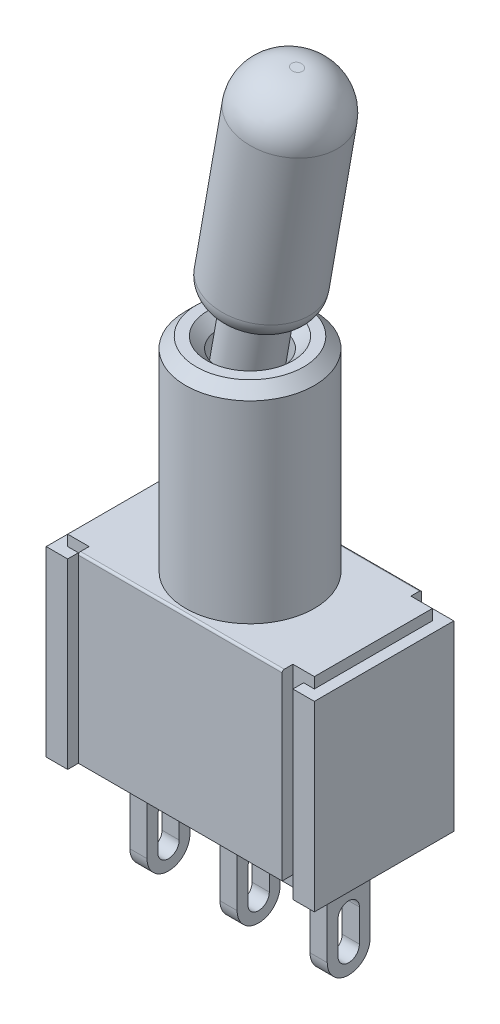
ISO-10303-21;
HEADER;
FILE_DESCRIPTION(('STEP AP214'),'2;1');
FILE_NAME('part.step','',(''),(''),'','','');
FILE_SCHEMA(('AUTOMOTIVE_DESIGN { 1 0 10303 214 1 1 1 1 }'));
ENDSEC;
DATA;
#1=APPLICATION_CONTEXT('core data for automotive mechanical design processes');
#2=APPLICATION_PROTOCOL_DEFINITION('international standard','automotive_design',2000,#1);
#3=PRODUCT_CONTEXT('',#1,'mechanical');
#4=PRODUCT('Part','Part','',(#3));
#5=PRODUCT_RELATED_PRODUCT_CATEGORY('part','',(#4));
#6=PRODUCT_DEFINITION_FORMATION('','',#4);
#7=PRODUCT_DEFINITION_CONTEXT('part definition',#1,'design');
#8=PRODUCT_DEFINITION('design','',#6,#7);
#9=PRODUCT_DEFINITION_SHAPE('','',#8);
#10=(LENGTH_UNIT() NAMED_UNIT(*) SI_UNIT(.MILLI.,.METRE.));
#11=(NAMED_UNIT(*) PLANE_ANGLE_UNIT() SI_UNIT($,.RADIAN.));
#12=(NAMED_UNIT(*) SI_UNIT($,.STERADIAN.) SOLID_ANGLE_UNIT());
#13=UNCERTAINTY_MEASURE_WITH_UNIT(LENGTH_MEASURE(1.E-05),#10,'distance_accuracy_value','');
#14=(GEOMETRIC_REPRESENTATION_CONTEXT(3) GLOBAL_UNCERTAINTY_ASSIGNED_CONTEXT((#13)) GLOBAL_UNIT_ASSIGNED_CONTEXT((#10,
#11,#12)) REPRESENTATION_CONTEXT('',''));
#15=CARTESIAN_POINT('',(0.,0.,0.));
#16=DIRECTION('',(0.,0.,1.));
#17=DIRECTION('',(1.,0.,0.));
#18=AXIS2_PLACEMENT_3D('',#15,#16,#17);
#19=CARTESIAN_POINT('',(6.25,14.5,0.));
#20=DIRECTION('',(0.,1.,0.));
#21=DIRECTION('',(0.,0.,1.));
#22=AXIS2_PLACEMENT_3D('',#19,#20,#21);
#23=CYLINDRICAL_SURFACE('',#22,1.5);
#24=CARTESIAN_POINT('',(6.25,18.,0.));
#25=DIRECTION('',(0.,1.,0.));
#26=DIRECTION('',(0.,0.,1.));
#27=AXIS2_PLACEMENT_3D('',#24,#25,#26);
#28=CIRCLE('',#27,1.5);
#29=CARTESIAN_POINT('',(6.25,18.,1.5));
#30=VERTEX_POINT('',#29);
#31=EDGE_CURVE('E703',#30,#30,#28,.T.);
#32=ORIENTED_EDGE('',*,*,#31,.T.);
#33=EDGE_LOOP('',(#32));
#34=FACE_BOUND('',#33,.T.);
#35=CARTESIAN_POINT('',(5.37800227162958,11.5,-1.22049988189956));
#36=CARTESIAN_POINT('',(5.38227041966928,11.6036363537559,-1.22354947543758));
#37=CARTESIAN_POINT('',(5.38631597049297,11.7072873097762,-1.22640586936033));
#38=CARTESIAN_POINT('',(5.39388272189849,11.9146216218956,-1.23169979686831));
#39=CARTESIAN_POINT('',(5.39740390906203,12.0183049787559,-1.23413731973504));
#40=CARTESIAN_POINT('',(5.40706662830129,12.329553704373,-1.24077593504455));
#41=CARTESIAN_POINT('',(5.41230077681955,12.5371646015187,-1.24429847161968));
#42=CARTESIAN_POINT('',(5.41944190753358,12.9542375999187,-1.24907625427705));
#43=CARTESIAN_POINT('',(5.42132025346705,13.1637004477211,-1.25031198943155));
#44=CARTESIAN_POINT('',(5.42015669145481,13.582570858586,-1.24954826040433));
#45=CARTESIAN_POINT('',(5.41711647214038,13.7919784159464,-1.24754990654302));
#46=CARTESIAN_POINT('',(5.40707488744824,14.1009658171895,-1.24076128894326));
#47=CARTESIAN_POINT('',(5.40297843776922,14.2006813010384,-1.23797892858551));
#48=CARTESIAN_POINT('',(5.39263705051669,14.3999668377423,-1.23084132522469));
#49=CARTESIAN_POINT('',(5.386391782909,14.4995368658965,-1.22648584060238));
#50=CARTESIAN_POINT('',(5.37120891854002,14.6983160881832,-1.21565352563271));
#51=CARTESIAN_POINT('',(5.36227259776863,14.7975254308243,-1.20917770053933));
#52=CARTESIAN_POINT('',(5.34098058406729,14.9953350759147,-1.19325874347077));
#53=CARTESIAN_POINT('',(5.32862599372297,15.0939355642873,-1.18381656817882));
#54=CARTESIAN_POINT('',(5.30521802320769,15.2518073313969,-1.16512336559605));
#55=CARTESIAN_POINT('',(5.29553188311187,15.3114397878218,-1.15723014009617));
#56=CARTESIAN_POINT('',(5.274284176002,15.430052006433,-1.13937386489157));
#57=CARTESIAN_POINT('',(5.2627230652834,15.489031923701,-1.12941131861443));
#58=CARTESIAN_POINT('',(5.2374818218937,15.6059566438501,-1.10683989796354));
#59=CARTESIAN_POINT('',(5.22380451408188,15.6639027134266,-1.09423454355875));
#60=CARTESIAN_POINT('',(5.19410502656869,15.7783125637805,-1.06560325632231));
#61=CARTESIAN_POINT('',(5.17808411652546,15.8347771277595,-1.04957917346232));
#62=CARTESIAN_POINT('',(5.13926108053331,15.9593717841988,-1.00859042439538));
#63=CARTESIAN_POINT('',(5.11576423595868,16.026899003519,-0.982392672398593));
#64=CARTESIAN_POINT('',(5.0653289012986,16.1563394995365,-0.920938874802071));
#65=CARTESIAN_POINT('',(5.03839665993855,16.2182626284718,-0.885699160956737));
#66=CARTESIAN_POINT('',(4.98852722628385,16.3218513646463,-0.812535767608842));
#67=CARTESIAN_POINT('',(4.96589662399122,16.36507196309,-0.776628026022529));
#68=CARTESIAN_POINT('',(4.92123748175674,16.4445952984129,-0.69745875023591));
#69=CARTESIAN_POINT('',(4.89920870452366,16.4809007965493,-0.65420016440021));
#70=CARTESIAN_POINT('',(4.85772246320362,16.5455620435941,-0.560531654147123));
#71=CARTESIAN_POINT('',(4.83828146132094,16.5738680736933,-0.510079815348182));
#72=CARTESIAN_POINT('',(4.8042382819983,16.6215421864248,-0.403597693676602));
#73=CARTESIAN_POINT('',(4.78963601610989,16.6409104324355,-0.347567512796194));
#74=CARTESIAN_POINT('',(4.76804426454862,16.6689570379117,-0.237915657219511));
#75=CARTESIAN_POINT('',(4.76042303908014,16.6785346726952,-0.184645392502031));
#76=CARTESIAN_POINT('',(4.75099053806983,16.6903355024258,-0.0767952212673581));
#77=CARTESIAN_POINT('',(4.7491779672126,16.6925603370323,-0.022215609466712));
#78=CARTESIAN_POINT('',(4.75148325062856,16.689700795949,0.0852134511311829));
#79=CARTESIAN_POINT('',(4.75544984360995,16.6848028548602,0.13807130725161));
#80=CARTESIAN_POINT('',(4.76871891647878,16.6680274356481,0.241966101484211));
#81=CARTESIAN_POINT('',(4.77802012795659,16.656151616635,0.293003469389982));
#82=CARTESIAN_POINT('',(4.80120089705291,16.6254484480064,0.391868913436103));
#83=CARTESIAN_POINT('',(4.81508272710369,16.6066176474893,0.439695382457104));
#84=CARTESIAN_POINT('',(4.8462613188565,16.5622112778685,0.530888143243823));
#85=CARTESIAN_POINT('',(4.86355853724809,16.5366348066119,0.574253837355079));
#86=CARTESIAN_POINT('',(4.90061933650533,16.4784963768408,0.656712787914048));
#87=CARTESIAN_POINT('',(4.92043505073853,16.4457711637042,0.695666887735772));
#88=CARTESIAN_POINT('',(4.96062325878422,16.3746800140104,0.767598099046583));
#89=CARTESIAN_POINT('',(4.98099564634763,16.3363151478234,0.800576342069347));
#90=CARTESIAN_POINT('',(5.03073839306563,16.2353407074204,0.875386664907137));
#91=CARTESIAN_POINT('',(5.05969150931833,16.1699837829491,0.913778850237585));
#92=CARTESIAN_POINT('',(5.11377342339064,16.0327316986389,0.980220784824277));
#93=CARTESIAN_POINT('',(5.13888991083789,15.9608166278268,1.00823763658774));
#94=CARTESIAN_POINT('',(5.18797690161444,15.8027260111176,1.05997764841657));
#95=CARTESIAN_POINT('',(5.21127949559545,15.7159746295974,1.08252805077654));
#96=CARTESIAN_POINT('',(5.25271775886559,15.5397195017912,1.12080868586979));
#97=CARTESIAN_POINT('',(5.2708439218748,15.4502110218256,1.13652639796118));
#98=CARTESIAN_POINT('',(5.30300075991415,15.2686577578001,1.16345743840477));
#99=CARTESIAN_POINT('',(5.31697750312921,15.1765952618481,1.17461210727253));
#100=CARTESIAN_POINT('',(5.3413937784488,14.9917676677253,1.19359474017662));
#101=CARTESIAN_POINT('',(5.35183621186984,14.8990032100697,1.20142543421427));
#102=CARTESIAN_POINT('',(5.3747195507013,14.6638199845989,1.21827209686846));
#103=CARTESIAN_POINT('',(5.38529170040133,14.5211133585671,1.22572080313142));
#104=CARTESIAN_POINT('',(5.40179004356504,14.2352788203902,1.23718622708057));
#105=CARTESIAN_POINT('',(5.407714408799,14.0921507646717,1.2412015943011));
#106=CARTESIAN_POINT('',(5.41616243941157,13.8054845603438,1.2468922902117));
#107=CARTESIAN_POINT('',(5.41867962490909,13.6619461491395,1.24856316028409));
#108=CARTESIAN_POINT('',(5.42115097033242,13.374836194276,1.25020404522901));
#109=CARTESIAN_POINT('',(5.42110497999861,13.2312646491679,1.25017396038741));
#110=CARTESIAN_POINT('',(5.41912474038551,12.9550385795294,1.24885838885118));
#111=CARTESIAN_POINT('',(5.41733403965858,12.8223823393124,1.24766833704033));
#112=CARTESIAN_POINT('',(5.41241363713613,12.5571005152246,1.24437042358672));
#113=CARTESIAN_POINT('',(5.40928386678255,12.4244749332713,1.24226251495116));
#114=CARTESIAN_POINT('',(5.40196012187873,12.1598400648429,1.23727436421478));
#115=CARTESIAN_POINT('',(5.39777078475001,12.0278305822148,1.23439748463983));
#116=CARTESIAN_POINT('',(5.38850553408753,11.7638723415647,1.22794918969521));
#117=CARTESIAN_POINT('',(5.3834297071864,11.6319235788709,1.22437784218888));
#118=CARTESIAN_POINT('',(5.37800227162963,11.5,1.2204998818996));
#119=B_SPLINE_CURVE_WITH_KNOTS('',3,(#35,#36,#37,#38,#39,#40,#41,#42,#43,#44,#45,#46,#47,#48,
#49,#50,#51,#52,#53,#54,#55,#56,#57,#58,#59,#60,#61,#62,#63,#64,#65,#66,#67,#68,#69,#70,#71,#72,
#73,#74,#75,#76,#77,#78,#79,#80,#81,#82,#83,#84,#85,#86,#87,#88,#89,#90,#91,#92,#93,#94,#95,#96,
#97,#98,#99,#100,#101,#102,#103,#104,#105,#106,#107,#108,#109,#110,#111,#112,#113,#114,#115,
#116,#117,#118),.UNSPECIFIED.,.F.,.F.,(4,2,2,2,2,2,2,2,2,2,2,2,2,2,2,2,2,2,2,2,2,2,2,2,2,2,2,2,
2,2,2,2,2,2,2,2,2,2,2,2,2,4),(0.,0.311305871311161,0.622619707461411,1.24570735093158,
1.87408707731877,2.50225111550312,2.8017403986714,3.10127570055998,3.40066919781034,
3.69996623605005,3.88269630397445,4.06538196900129,4.24782584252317,4.43017123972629,
4.65799512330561,4.88541036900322,5.06640794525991,5.24733309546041,5.42935918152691,
5.61138194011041,5.77455581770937,5.93769330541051,6.09663685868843,6.25554263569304,
6.41452736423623,6.5735333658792,6.73664323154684,6.89972217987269,7.14172992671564,
7.38449857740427,7.66170314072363,7.93941355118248,8.2205896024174,8.50153427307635,
8.93121430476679,9.36106326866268,9.79172858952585,10.2224191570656,10.6204283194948,
11.018457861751,11.4147746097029,11.8110526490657),.UNSPECIFIED.);
#120=CARTESIAN_POINT('',(5.38591660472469,14.5,-1.2261157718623));
#121=VERTEX_POINT('',#120);
#122=CARTESIAN_POINT('',(5.38591660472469,14.5,1.2261157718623));
#123=VERTEX_POINT('',#122);
#124=EDGE_CURVE('E589',#121,#123,#119,.T.);
#125=ORIENTED_EDGE('',*,*,#124,.F.);
#126=CARTESIAN_POINT('',(6.25,14.5,0.));
#127=DIRECTION('',(0.,1.,0.));
#128=DIRECTION('',(0.,0.,1.));
#129=AXIS2_PLACEMENT_3D('',#126,#127,#128);
#130=CIRCLE('',#129,1.5);
#131=EDGE_CURVE('E597',#123,#121,#130,.T.);
#132=ORIENTED_EDGE('',*,*,#131,.F.);
#133=EDGE_LOOP('',(#125,#132));
#134=FACE_BOUND('',#133,.T.);
#135=ADVANCED_FACE('F26',(#34,#134),#23,.F.);
#136=CARTESIAN_POINT('',(6.25,14.5,0.));
#137=DIRECTION('',(0.,1.,0.));
#138=DIRECTION('',(0.,0.,1.));
#139=AXIS2_PLACEMENT_3D('',#136,#137,#138);
#140=PLANE('',#139);
#141=ORIENTED_EDGE('',*,*,#131,.T.);
#142=CARTESIAN_POINT('',(5.63285556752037,14.5,0.));
#143=DIRECTION('',(0.,1.,0.));
#144=DIRECTION('',(-1.,0.,0.));
#145=AXIS2_PLACEMENT_3D('',#142,#143,#144);
#146=ELLIPSE('',#145,1.26928326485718,1.25);
#147=EDGE_CURVE('E586',#121,#123,#146,.F.);
#148=ORIENTED_EDGE('',*,*,#147,.T.);
#149=EDGE_LOOP('',(#141,#148));
#150=FACE_BOUND('',#149,.T.);
#151=ADVANCED_FACE('F600',(#150),#140,.T.);
#152=CARTESIAN_POINT('',(12.,9.,-3.25));
#153=DIRECTION('',(0.,-1.,0.));
#154=DIRECTION('',(0.,0.,-1.));
#155=AXIS2_PLACEMENT_3D('',#152,#153,#154);
#156=PLANE('',#155);
#157=DIRECTION('',(0.,0.,1.));
#158=VECTOR('',#157,1.);
#159=CARTESIAN_POINT('',(1.5,9.,2.75));
#160=LINE('',#159,#158);
#161=CARTESIAN_POINT('',(1.5,9.,2.75));
#162=VERTEX_POINT('',#161);
#163=CARTESIAN_POINT('',(1.5,9.,3.15));
#164=VERTEX_POINT('',#163);
#165=EDGE_CURVE('E626',#162,#164,#160,.T.);
#166=ORIENTED_EDGE('',*,*,#165,.T.);
#167=DIRECTION('',(1.,0.,0.));
#168=VECTOR('',#167,1.);
#169=CARTESIAN_POINT('',(11.,9.,3.15));
#170=LINE('',#169,#168);
#171=CARTESIAN_POINT('',(11.,9.,3.15));
#172=VERTEX_POINT('',#171);
#173=EDGE_CURVE('E725',#164,#172,#170,.T.);
#174=ORIENTED_EDGE('',*,*,#173,.T.);
#175=DIRECTION('',(0.,0.,-1.));
#176=VECTOR('',#175,1.);
#177=CARTESIAN_POINT('',(11.,9.,3.25));
#178=LINE('',#177,#176);
#179=CARTESIAN_POINT('',(11.,9.,2.75));
#180=VERTEX_POINT('',#179);
#181=EDGE_CURVE('E629',#172,#180,#178,.T.);
#182=ORIENTED_EDGE('',*,*,#181,.T.);
#183=DIRECTION('',(1.,0.,0.));
#184=VECTOR('',#183,1.);
#185=CARTESIAN_POINT('',(11.,9.,2.75));
#186=LINE('',#185,#184);
#187=CARTESIAN_POINT('',(12.,9.,2.75));
#188=VERTEX_POINT('',#187);
#189=EDGE_CURVE('E631',#180,#188,#186,.T.);
#190=ORIENTED_EDGE('',*,*,#189,.T.);
#191=DIRECTION('',(0.,0.,-1.));
#192=VECTOR('',#191,1.);
#193=CARTESIAN_POINT('',(12.,9.,-2.75));
#194=LINE('',#193,#192);
#195=CARTESIAN_POINT('',(12.,9.,-2.75));
#196=VERTEX_POINT('',#195);
#197=EDGE_CURVE('E633',#188,#196,#194,.T.);
#198=ORIENTED_EDGE('',*,*,#197,.T.);
#199=DIRECTION('',(-1.,0.,0.));
#200=VECTOR('',#199,1.);
#201=CARTESIAN_POINT('',(11.,9.,-2.75));
#202=LINE('',#201,#200);
#203=CARTESIAN_POINT('',(11.,9.,-2.75));
#204=VERTEX_POINT('',#203);
#205=EDGE_CURVE('E635',#196,#204,#202,.T.);
#206=ORIENTED_EDGE('',*,*,#205,.T.);
#207=DIRECTION('',(0.,0.,-1.));
#208=VECTOR('',#207,1.);
#209=CARTESIAN_POINT('',(11.,9.,-3.25));
#210=LINE('',#209,#208);
#211=CARTESIAN_POINT('',(11.,9.,-3.15));
#212=VERTEX_POINT('',#211);
#213=EDGE_CURVE('E638',#204,#212,#210,.T.);
#214=ORIENTED_EDGE('',*,*,#213,.T.);
#215=DIRECTION('',(-1.,0.,0.));
#216=VECTOR('',#215,1.);
#217=CARTESIAN_POINT('',(1.5,9.,-3.15));
#218=LINE('',#217,#216);
#219=CARTESIAN_POINT('',(1.5,9.,-3.15));
#220=VERTEX_POINT('',#219);
#221=EDGE_CURVE('E722',#212,#220,#218,.T.);
#222=ORIENTED_EDGE('',*,*,#221,.T.);
#223=DIRECTION('',(0.,0.,1.));
#224=VECTOR('',#223,1.);
#225=CARTESIAN_POINT('',(1.5,9.,-3.25));
#226=LINE('',#225,#224);
#227=CARTESIAN_POINT('',(1.5,9.,-2.75));
#228=VERTEX_POINT('',#227);
#229=EDGE_CURVE('E617',#220,#228,#226,.T.);
#230=ORIENTED_EDGE('',*,*,#229,.T.);
#231=DIRECTION('',(-1.,0.,0.));
#232=VECTOR('',#231,1.);
#233=CARTESIAN_POINT('',(1.5,9.,-2.75));
#234=LINE('',#233,#232);
#235=CARTESIAN_POINT('',(0.5,9.,-2.75));
#236=VERTEX_POINT('',#235);
#237=EDGE_CURVE('E619',#228,#236,#234,.T.);
#238=ORIENTED_EDGE('',*,*,#237,.T.);
#239=DIRECTION('',(0.,0.,1.));
#240=VECTOR('',#239,1.);
#241=CARTESIAN_POINT('',(0.5,9.,-2.75));
#242=LINE('',#241,#240);
#243=CARTESIAN_POINT('',(0.5,9.,2.75));
#244=VERTEX_POINT('',#243);
#245=EDGE_CURVE('E621',#236,#244,#242,.T.);
#246=ORIENTED_EDGE('',*,*,#245,.T.);
#247=DIRECTION('',(1.,0.,0.));
#248=VECTOR('',#247,1.);
#249=CARTESIAN_POINT('',(1.5,9.,2.75));
#250=LINE('',#249,#248);
#251=EDGE_CURVE('E623',#244,#162,#250,.T.);
#252=ORIENTED_EDGE('',*,*,#251,.T.);
#253=EDGE_LOOP('',(#166,#174,#182,#190,#198,#206,#214,#222,#230,#238,#246,#252));
#254=FACE_BOUND('',#253,.T.);
#255=CARTESIAN_POINT('',(6.25,9.,0.));
#256=DIRECTION('',(0.,-1.,0.));
#257=DIRECTION('',(0.,0.,-1.));
#258=AXIS2_PLACEMENT_3D('',#255,#256,#257);
#259=CIRCLE('',#258,3.);
#260=CARTESIAN_POINT('',(6.25,9.,-3.));
#261=VERTEX_POINT('',#260);
#262=EDGE_CURVE('E672',#261,#261,#259,.F.);
#263=ORIENTED_EDGE('',*,*,#262,.F.);
#264=EDGE_LOOP('',(#263));
#265=FACE_BOUND('',#264,.T.);
#266=ADVANCED_FACE('F745',(#254,#265),#156,.F.);
#267=CARTESIAN_POINT('',(0.,8.5,3.25));
#268=DIRECTION('',(0.,-1.,0.));
#269=DIRECTION('',(0.,0.,-1.));
#270=AXIS2_PLACEMENT_3D('',#267,#268,#269);
#271=PLANE('',#270);
#272=DIRECTION('',(-1.,0.,0.));
#273=VECTOR('',#272,1.);
#274=CARTESIAN_POINT('',(11.,8.5,-2.75));
#275=LINE('',#274,#273);
#276=CARTESIAN_POINT('',(12.,8.5,-2.75));
#277=VERTEX_POINT('',#276);
#278=CARTESIAN_POINT('',(11.5,8.5,-2.75));
#279=VERTEX_POINT('',#278);
#280=EDGE_CURVE('E616',#277,#279,#275,.T.);
#281=ORIENTED_EDGE('',*,*,#280,.F.);
#282=DIRECTION('',(0.,0.,-1.));
#283=VECTOR('',#282,1.);
#284=CARTESIAN_POINT('',(12.,8.5,-2.75));
#285=LINE('',#284,#283);
#286=CARTESIAN_POINT('',(12.,8.5,2.75));
#287=VERTEX_POINT('',#286);
#288=EDGE_CURVE('E613',#287,#277,#285,.T.);
#289=ORIENTED_EDGE('',*,*,#288,.F.);
#290=DIRECTION('',(1.,0.,0.));
#291=VECTOR('',#290,1.);
#292=CARTESIAN_POINT('',(11.,8.5,2.75));
#293=LINE('',#292,#291);
#294=CARTESIAN_POINT('',(11.5,8.5,2.75));
#295=VERTEX_POINT('',#294);
#296=EDGE_CURVE('E668',#295,#287,#293,.T.);
#297=ORIENTED_EDGE('',*,*,#296,.F.);
#298=DIRECTION('',(0.,0.,1.));
#299=VECTOR('',#298,1.);
#300=CARTESIAN_POINT('',(11.5,8.5,2.75));
#301=LINE('',#300,#299);
#302=CARTESIAN_POINT('',(11.5,8.5,3.25));
#303=VERTEX_POINT('',#302);
#304=EDGE_CURVE('E676',#295,#303,#301,.T.);
#305=ORIENTED_EDGE('',*,*,#304,.T.);
#306=DIRECTION('',(-1.,0.,0.));
#307=VECTOR('',#306,1.);
#308=CARTESIAN_POINT('',(0.,8.5,3.25));
#309=LINE('',#308,#307);
#310=CARTESIAN_POINT('',(12.5,8.5,3.25));
#311=VERTEX_POINT('',#310);
#312=EDGE_CURVE('E1168',#311,#303,#309,.T.);
#313=ORIENTED_EDGE('',*,*,#312,.F.);
#314=DIRECTION('',(0.,0.,-1.));
#315=VECTOR('',#314,1.);
#316=CARTESIAN_POINT('',(12.5,8.5,3.25));
#317=LINE('',#316,#315);
#318=CARTESIAN_POINT('',(12.5,8.5,-3.25));
#319=VERTEX_POINT('',#318);
#320=EDGE_CURVE('E1174',#311,#319,#317,.T.);
#321=ORIENTED_EDGE('',*,*,#320,.T.);
#322=DIRECTION('',(-1.,0.,0.));
#323=VECTOR('',#322,1.);
#324=CARTESIAN_POINT('',(0.,8.5,-3.25));
#325=LINE('',#324,#323);
#326=CARTESIAN_POINT('',(11.5,8.5,-3.25));
#327=VERTEX_POINT('',#326);
#328=EDGE_CURVE('E1155',#319,#327,#325,.T.);
#329=ORIENTED_EDGE('',*,*,#328,.T.);
#330=DIRECTION('',(0.,0.,-1.));
#331=VECTOR('',#330,1.);
#332=CARTESIAN_POINT('',(11.5,8.5,-2.75));
#333=LINE('',#332,#331);
#334=EDGE_CURVE('E828',#279,#327,#333,.T.);
#335=ORIENTED_EDGE('',*,*,#334,.F.);
#336=EDGE_LOOP('',(#281,#289,#297,#305,#313,#321,#329,#335));
#337=FACE_BOUND('',#336,.T.);
#338=ADVANCED_FACE('F1213',(#337),#271,.F.);
#339=DIRECTION('',(1.,0.,0.));
#340=VECTOR('',#339,1.);
#341=CARTESIAN_POINT('',(1.5,8.5,2.75));
#342=LINE('',#341,#340);
#343=CARTESIAN_POINT('',(0.5,8.5,2.75));
#344=VERTEX_POINT('',#343);
#345=CARTESIAN_POINT('',(1.,8.5,2.75));
#346=VERTEX_POINT('',#345);
#347=EDGE_CURVE('E604',#344,#346,#342,.T.);
#348=ORIENTED_EDGE('',*,*,#347,.F.);
#349=DIRECTION('',(0.,0.,1.));
#350=VECTOR('',#349,1.);
#351=CARTESIAN_POINT('',(0.5,8.5,-2.75));
#352=LINE('',#351,#350);
#353=CARTESIAN_POINT('',(0.5,8.5,-2.75));
#354=VERTEX_POINT('',#353);
#355=EDGE_CURVE('E601',#354,#344,#352,.T.);
#356=ORIENTED_EDGE('',*,*,#355,.F.);
#357=DIRECTION('',(-1.,0.,0.));
#358=VECTOR('',#357,1.);
#359=CARTESIAN_POINT('',(1.5,8.5,-2.75));
#360=LINE('',#359,#358);
#361=CARTESIAN_POINT('',(1.,8.5,-2.75));
#362=VERTEX_POINT('',#361);
#363=EDGE_CURVE('E673',#362,#354,#360,.T.);
#364=ORIENTED_EDGE('',*,*,#363,.F.);
#365=DIRECTION('',(0.,0.,-1.));
#366=VECTOR('',#365,1.);
#367=CARTESIAN_POINT('',(1.,8.5,-2.75));
#368=LINE('',#367,#366);
#369=CARTESIAN_POINT('',(1.,8.5,-3.25));
#370=VERTEX_POINT('',#369);
#371=EDGE_CURVE('E819',#362,#370,#368,.T.);
#372=ORIENTED_EDGE('',*,*,#371,.T.);
#373=CARTESIAN_POINT('',(0.,8.5,-3.25));
#374=VERTEX_POINT('',#373);
#375=EDGE_CURVE('E1154',#370,#374,#325,.T.);
#376=ORIENTED_EDGE('',*,*,#375,.T.);
#377=DIRECTION('',(0.,0.,-1.));
#378=VECTOR('',#377,1.);
#379=CARTESIAN_POINT('',(0.,8.5,3.25));
#380=LINE('',#379,#378);
#381=CARTESIAN_POINT('',(0.,8.5,3.25));
#382=VERTEX_POINT('',#381);
#383=EDGE_CURVE('E1171',#382,#374,#380,.T.);
#384=ORIENTED_EDGE('',*,*,#383,.F.);
#385=CARTESIAN_POINT('',(1.,8.5,3.25));
#386=VERTEX_POINT('',#385);
#387=EDGE_CURVE('E1167',#386,#382,#309,.T.);
#388=ORIENTED_EDGE('',*,*,#387,.F.);
#389=DIRECTION('',(0.,0.,1.));
#390=VECTOR('',#389,1.);
#391=CARTESIAN_POINT('',(1.,8.5,2.75));
#392=LINE('',#391,#390);
#393=EDGE_CURVE('E679',#346,#386,#392,.T.);
#394=ORIENTED_EDGE('',*,*,#393,.F.);
#395=EDGE_LOOP('',(#348,#356,#364,#372,#376,#384,#388,#394));
#396=FACE_BOUND('',#395,.T.);
#397=ADVANCED_FACE('F1365',(#396),#271,.F.);
#398=CARTESIAN_POINT('',(1.,0.,-2.75));
#399=DIRECTION('',(0.,0.,-1.));
#400=DIRECTION('',(1.,0.,0.));
#401=AXIS2_PLACEMENT_3D('',#398,#399,#400);
#402=PLANE('',#401);
#403=DIRECTION('',(0.,-1.,0.));
#404=VECTOR('',#403,1.);
#405=CARTESIAN_POINT('',(5.4,1.,-2.75));
#406=LINE('',#405,#404);
#407=CARTESIAN_POINT('',(5.4,0.5,-2.75));
#408=VERTEX_POINT('',#407);
#409=CARTESIAN_POINT('',(5.4,0.,-2.75));
#410=VERTEX_POINT('',#409);
#411=EDGE_CURVE('E799',#408,#410,#406,.T.);
#412=ORIENTED_EDGE('',*,*,#411,.F.);
#413=DIRECTION('',(1.,0.,0.));
#414=VECTOR('',#413,1.);
#415=CARTESIAN_POINT('',(5.12049150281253,0.5,-2.75));
#416=LINE('',#415,#414);
#417=CARTESIAN_POINT('',(7.1,0.5,-2.75));
#418=VERTEX_POINT('',#417);
#419=EDGE_CURVE('E1396',#408,#418,#416,.T.);
#420=ORIENTED_EDGE('',*,*,#419,.T.);
#421=DIRECTION('',(0.,-1.,0.));
#422=VECTOR('',#421,1.);
#423=CARTESIAN_POINT('',(7.1,1.,-2.75));
#424=LINE('',#423,#422);
#425=CARTESIAN_POINT('',(7.1,0.,-2.75));
#426=VERTEX_POINT('',#425);
#427=EDGE_CURVE('E787',#418,#426,#424,.T.);
#428=ORIENTED_EDGE('',*,*,#427,.T.);
#429=DIRECTION('',(1.,0.,0.));
#430=VECTOR('',#429,1.);
#431=CARTESIAN_POINT('',(1.,0.,-2.75));
#432=LINE('',#431,#430);
#433=EDGE_CURVE('E820',#410,#426,#432,.T.);
#434=ORIENTED_EDGE('',*,*,#433,.F.);
#435=EDGE_LOOP('',(#412,#420,#428,#434));
#436=FACE_BOUND('',#435,.T.);
#437=ADVANCED_FACE('F1392',(#436),#402,.T.);
#438=CARTESIAN_POINT('',(5.4,1.,-2.75));
#439=DIRECTION('',(0.,-1.,0.));
#440=DIRECTION('',(0.,0.,1.));
#441=AXIS2_PLACEMENT_3D('',#438,#439,#440);
#442=PLANE('',#441);
#443=DIRECTION('',(1.,0.,0.));
#444=VECTOR('',#443,1.);
#445=CARTESIAN_POINT('',(11.,1.,-2.75));
#446=LINE('',#445,#444);
#447=CARTESIAN_POINT('',(9.32049150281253,1.,-2.75));
#448=VERTEX_POINT('',#447);
#449=CARTESIAN_POINT('',(9.6,1.,-2.75));
#450=VERTEX_POINT('',#449);
#451=EDGE_CURVE('E653',#448,#450,#446,.T.);
#452=ORIENTED_EDGE('',*,*,#451,.T.);
#453=DIRECTION('',(0.447213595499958,0.,-0.894427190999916));
#454=VECTOR('',#453,1.);
#455=CARTESIAN_POINT('',(9.6,1.,-2.75));
#456=LINE('',#455,#454);
#457=CARTESIAN_POINT('',(8.35,1.,-0.25));
#458=VERTEX_POINT('',#457);
#459=EDGE_CURVE('E773',#458,#450,#456,.T.);
#460=ORIENTED_EDGE('',*,*,#459,.F.);
#461=DIRECTION('',(0.447213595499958,0.,0.894427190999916));
#462=VECTOR('',#461,1.);
#463=CARTESIAN_POINT('',(8.35,1.,-0.25));
#464=LINE('',#463,#462);
#465=CARTESIAN_POINT('',(7.1,1.,-2.75));
#466=VERTEX_POINT('',#465);
#467=EDGE_CURVE('E776',#466,#458,#464,.T.);
#468=ORIENTED_EDGE('',*,*,#467,.F.);
#469=DIRECTION('',(1.,0.,0.));
#470=VECTOR('',#469,1.);
#471=CARTESIAN_POINT('',(5.12049150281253,1.,-2.75));
#472=LINE('',#471,#470);
#473=CARTESIAN_POINT('',(7.37950849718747,1.,-2.75));
#474=VERTEX_POINT('',#473);
#475=EDGE_CURVE('E2164',#466,#474,#472,.T.);
#476=ORIENTED_EDGE('',*,*,#475,.T.);
#477=DIRECTION('',(0.447213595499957,0.,0.894427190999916));
#478=VECTOR('',#477,1.);
#479=CARTESIAN_POINT('',(7.37950849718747,1.,-2.75));
#480=LINE('',#479,#478);
#481=CARTESIAN_POINT('',(8.35,1.,-0.809016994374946));
#482=VERTEX_POINT('',#481);
#483=EDGE_CURVE('E2165',#474,#482,#480,.T.);
#484=ORIENTED_EDGE('',*,*,#483,.T.);
#485=DIRECTION('',(0.447213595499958,0.,-0.894427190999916));
#486=VECTOR('',#485,1.);
#487=CARTESIAN_POINT('',(9.32049150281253,1.,-2.75));
#488=LINE('',#487,#486);
#489=EDGE_CURVE('E2167',#482,#448,#488,.T.);
#490=ORIENTED_EDGE('',*,*,#489,.T.);
#491=EDGE_LOOP('',(#452,#460,#468,#476,#484,#490));
#492=FACE_BOUND('',#491,.T.);
#493=ADVANCED_FACE('F1598',(#492),#442,.T.);
#494=DIRECTION('',(1.,0.,0.));
#495=VECTOR('',#494,1.);
#496=CARTESIAN_POINT('',(11.,0.5,-2.75));
#497=LINE('',#496,#495);
#498=CARTESIAN_POINT('',(9.6,0.5,-2.75));
#499=VERTEX_POINT('',#498);
#500=CARTESIAN_POINT('',(11.,0.5,-2.75));
#501=VERTEX_POINT('',#500);
#502=EDGE_CURVE('E1406',#499,#501,#497,.T.);
#503=ORIENTED_EDGE('',*,*,#502,.T.);
#504=DIRECTION('',(0.,1.,0.));
#505=VECTOR('',#504,1.);
#506=CARTESIAN_POINT('',(11.,8.5,-2.75));
#507=LINE('',#506,#505);
#508=EDGE_CURVE('E1408',#501,#204,#507,.T.);
#509=ORIENTED_EDGE('',*,*,#508,.T.);
#510=ORIENTED_EDGE('',*,*,#205,.F.);
#511=DIRECTION('',(0.,-1.,0.));
#512=VECTOR('',#511,1.);
#513=CARTESIAN_POINT('',(12.,9.,-2.75));
#514=LINE('',#513,#512);
#515=EDGE_CURVE('E641',#196,#277,#514,.T.);
#516=ORIENTED_EDGE('',*,*,#515,.T.);
#517=ORIENTED_EDGE('',*,*,#280,.T.);
#518=DIRECTION('',(0.,1.,0.));
#519=VECTOR('',#518,1.);
#520=CARTESIAN_POINT('',(11.5,8.5,-2.75));
#521=LINE('',#520,#519);
#522=CARTESIAN_POINT('',(11.5,0.,-2.75));
#523=VERTEX_POINT('',#522);
#524=EDGE_CURVE('E1198',#523,#279,#521,.T.);
#525=ORIENTED_EDGE('',*,*,#524,.F.);
#526=CARTESIAN_POINT('',(9.6,0.,-2.75));
#527=VERTEX_POINT('',#526);
#528=EDGE_CURVE('E821',#527,#523,#432,.T.);
#529=ORIENTED_EDGE('',*,*,#528,.F.);
#530=DIRECTION('',(0.,-1.,0.));
#531=VECTOR('',#530,1.);
#532=CARTESIAN_POINT('',(9.6,1.,-2.75));
#533=LINE('',#532,#531);
#534=EDGE_CURVE('E783',#499,#527,#533,.T.);
#535=ORIENTED_EDGE('',*,*,#534,.F.);
#536=EDGE_LOOP('',(#503,#509,#510,#516,#517,#525,#529,#535));
#537=FACE_BOUND('',#536,.T.);
#538=ADVANCED_FACE('F1226',(#537),#402,.T.);
#539=CARTESIAN_POINT('',(1.,0.,2.75));
#540=DIRECTION('',(0.,0.,1.));
#541=DIRECTION('',(1.,0.,0.));
#542=AXIS2_PLACEMENT_3D('',#539,#540,#541);
#543=PLANE('',#542);
#544=DIRECTION('',(0.,-1.,0.));
#545=VECTOR('',#544,1.);
#546=CARTESIAN_POINT('',(7.1,1.,2.75));
#547=LINE('',#546,#545);
#548=CARTESIAN_POINT('',(7.1,0.5,2.75));
#549=VERTEX_POINT('',#548);
#550=CARTESIAN_POINT('',(7.1,0.,2.75));
#551=VERTEX_POINT('',#550);
#552=EDGE_CURVE('E1114',#549,#551,#547,.T.);
#553=ORIENTED_EDGE('',*,*,#552,.F.);
#554=DIRECTION('',(1.,0.,0.));
#555=VECTOR('',#554,1.);
#556=CARTESIAN_POINT('',(5.12049150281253,0.5,2.75));
#557=LINE('',#556,#555);
#558=CARTESIAN_POINT('',(5.4,0.5,2.75));
#559=VERTEX_POINT('',#558);
#560=EDGE_CURVE('E1297',#559,#549,#557,.T.);
#561=ORIENTED_EDGE('',*,*,#560,.F.);
#562=DIRECTION('',(0.,-1.,0.));
#563=VECTOR('',#562,1.);
#564=CARTESIAN_POINT('',(5.4,1.,2.75));
#565=LINE('',#564,#563);
#566=CARTESIAN_POINT('',(5.4,0.,2.75));
#567=VERTEX_POINT('',#566);
#568=EDGE_CURVE('E1132',#559,#567,#565,.T.);
#569=ORIENTED_EDGE('',*,*,#568,.T.);
#570=DIRECTION('',(1.,0.,0.));
#571=VECTOR('',#570,1.);
#572=CARTESIAN_POINT('',(1.,0.,2.75));
#573=LINE('',#572,#571);
#574=EDGE_CURVE('E1142',#567,#551,#573,.T.);
#575=ORIENTED_EDGE('',*,*,#574,.T.);
#576=EDGE_LOOP('',(#553,#561,#569,#575));
#577=FACE_BOUND('',#576,.T.);
#578=ADVANCED_FACE('F1247',(#577),#543,.T.);
#579=DIRECTION('',(1.,0.,0.));
#580=VECTOR('',#579,1.);
#581=CARTESIAN_POINT('',(1.5,0.5,2.75));
#582=LINE('',#581,#580);
#583=CARTESIAN_POINT('',(1.5,0.5,2.75));
#584=VERTEX_POINT('',#583);
#585=CARTESIAN_POINT('',(2.9,0.5,2.75));
#586=VERTEX_POINT('',#585);
#587=EDGE_CURVE('E1286',#584,#586,#582,.T.);
#588=ORIENTED_EDGE('',*,*,#587,.F.);
#589=DIRECTION('',(0.,-1.,0.));
#590=VECTOR('',#589,1.);
#591=CARTESIAN_POINT('',(1.5,8.5,2.75));
#592=LINE('',#591,#590);
#593=EDGE_CURVE('E1324',#162,#584,#592,.T.);
#594=ORIENTED_EDGE('',*,*,#593,.F.);
#595=ORIENTED_EDGE('',*,*,#251,.F.);
#596=DIRECTION('',(0.,-1.,0.));
#597=VECTOR('',#596,1.);
#598=CARTESIAN_POINT('',(0.5,9.,2.75));
#599=LINE('',#598,#597);
#600=EDGE_CURVE('E647',#244,#344,#599,.T.);
#601=ORIENTED_EDGE('',*,*,#600,.T.);
#602=ORIENTED_EDGE('',*,*,#347,.T.);
#603=DIRECTION('',(0.,-1.,0.));
#604=VECTOR('',#603,1.);
#605=CARTESIAN_POINT('',(1.,8.5,2.75));
#606=LINE('',#605,#604);
#607=CARTESIAN_POINT('',(1.,0.,2.75));
#608=VERTEX_POINT('',#607);
#609=EDGE_CURVE('E690',#346,#608,#606,.T.);
#610=ORIENTED_EDGE('',*,*,#609,.T.);
#611=CARTESIAN_POINT('',(2.9,0.,2.75));
#612=VERTEX_POINT('',#611);
#613=EDGE_CURVE('E687',#608,#612,#573,.T.);
#614=ORIENTED_EDGE('',*,*,#613,.T.);
#615=DIRECTION('',(0.,-1.,0.));
#616=VECTOR('',#615,1.);
#617=CARTESIAN_POINT('',(2.9,1.,2.75));
#618=LINE('',#617,#616);
#619=EDGE_CURVE('E1128',#586,#612,#618,.T.);
#620=ORIENTED_EDGE('',*,*,#619,.F.);
#621=EDGE_LOOP('',(#588,#594,#595,#601,#602,#610,#614,#620));
#622=FACE_BOUND('',#621,.T.);
#623=ADVANCED_FACE('F1357',(#622),#543,.T.);
#624=DIRECTION('',(0.,1.,0.));
#625=VECTOR('',#624,1.);
#626=CARTESIAN_POINT('',(11.,8.5,2.75));
#627=LINE('',#626,#625);
#628=CARTESIAN_POINT('',(11.,0.5,2.75));
#629=VERTEX_POINT('',#628);
#630=EDGE_CURVE('E767',#629,#180,#627,.T.);
#631=ORIENTED_EDGE('',*,*,#630,.F.);
#632=DIRECTION('',(1.,0.,0.));
#633=VECTOR('',#632,1.);
#634=CARTESIAN_POINT('',(11.,0.5,2.75));
#635=LINE('',#634,#633);
#636=CARTESIAN_POINT('',(9.6,0.5,2.75));
#637=VERTEX_POINT('',#636);
#638=EDGE_CURVE('E1301',#637,#629,#635,.T.);
#639=ORIENTED_EDGE('',*,*,#638,.F.);
#640=DIRECTION('',(0.,-1.,0.));
#641=VECTOR('',#640,1.);
#642=CARTESIAN_POINT('',(9.6,1.,2.75));
#643=LINE('',#642,#641);
#644=CARTESIAN_POINT('',(9.6,0.,2.75));
#645=VERTEX_POINT('',#644);
#646=EDGE_CURVE('E1107',#637,#645,#643,.T.);
#647=ORIENTED_EDGE('',*,*,#646,.T.);
#648=CARTESIAN_POINT('',(11.5,0.,2.75));
#649=VERTEX_POINT('',#648);
#650=EDGE_CURVE('E693',#645,#649,#573,.T.);
#651=ORIENTED_EDGE('',*,*,#650,.T.);
#652=DIRECTION('',(0.,1.,0.));
#653=VECTOR('',#652,1.);
#654=CARTESIAN_POINT('',(11.5,8.5,2.75));
#655=LINE('',#654,#653);
#656=EDGE_CURVE('E683',#649,#295,#655,.T.);
#657=ORIENTED_EDGE('',*,*,#656,.T.);
#658=ORIENTED_EDGE('',*,*,#296,.T.);
#659=DIRECTION('',(0.,-1.,0.));
#660=VECTOR('',#659,1.);
#661=CARTESIAN_POINT('',(12.,9.,2.75));
#662=LINE('',#661,#660);
#663=EDGE_CURVE('E644',#188,#287,#662,.T.);
#664=ORIENTED_EDGE('',*,*,#663,.F.);
#665=ORIENTED_EDGE('',*,*,#189,.F.);
#666=EDGE_LOOP('',(#631,#639,#647,#651,#657,#658,#664,#665));
#667=FACE_BOUND('',#666,.T.);
#668=ADVANCED_FACE('F1235',(#667),#543,.T.);
#669=CARTESIAN_POINT('',(5.4,1.,2.75));
#670=DIRECTION('',(0.,-1.,0.));
#671=DIRECTION('',(0.,0.,-1.));
#672=AXIS2_PLACEMENT_3D('',#669,#670,#671);
#673=PLANE('',#672);
#674=DIRECTION('',(0.447213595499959,0.,-0.894427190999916));
#675=VECTOR('',#674,1.);
#676=CARTESIAN_POINT('',(3.17950849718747,1.,2.75));
#677=LINE('',#676,#675);
#678=CARTESIAN_POINT('',(3.17950849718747,1.,2.75));
#679=VERTEX_POINT('',#678);
#680=CARTESIAN_POINT('',(4.15,1.,0.809016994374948));
#681=VERTEX_POINT('',#680);
#682=EDGE_CURVE('E1272',#679,#681,#677,.T.);
#683=ORIENTED_EDGE('',*,*,#682,.F.);
#684=DIRECTION('',(1.,0.,0.));
#685=VECTOR('',#684,1.);
#686=CARTESIAN_POINT('',(1.5,1.,2.75));
#687=LINE('',#686,#685);
#688=CARTESIAN_POINT('',(2.9,1.,2.75));
#689=VERTEX_POINT('',#688);
#690=EDGE_CURVE('E1473',#689,#679,#687,.T.);
#691=ORIENTED_EDGE('',*,*,#690,.F.);
#692=DIRECTION('',(0.447213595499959,0.,-0.894427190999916));
#693=VECTOR('',#692,1.);
#694=CARTESIAN_POINT('',(2.9,1.,2.75));
#695=LINE('',#694,#693);
#696=CARTESIAN_POINT('',(4.15,1.,0.25));
#697=VERTEX_POINT('',#696);
#698=EDGE_CURVE('E1122',#689,#697,#695,.T.);
#699=ORIENTED_EDGE('',*,*,#698,.T.);
#700=DIRECTION('',(0.447213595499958,0.,0.894427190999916));
#701=VECTOR('',#700,1.);
#702=CARTESIAN_POINT('',(4.15,1.,0.25));
#703=LINE('',#702,#701);
#704=CARTESIAN_POINT('',(5.4,1.,2.75));
#705=VERTEX_POINT('',#704);
#706=EDGE_CURVE('E1125',#697,#705,#703,.T.);
#707=ORIENTED_EDGE('',*,*,#706,.T.);
#708=DIRECTION('',(1.,0.,0.));
#709=VECTOR('',#708,1.);
#710=CARTESIAN_POINT('',(5.12049150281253,1.,2.75));
#711=LINE('',#710,#709);
#712=CARTESIAN_POINT('',(5.12049150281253,1.,2.75));
#713=VERTEX_POINT('',#712);
#714=EDGE_CURVE('E1269',#713,#705,#711,.T.);
#715=ORIENTED_EDGE('',*,*,#714,.F.);
#716=DIRECTION('',(0.447213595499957,0.,0.894427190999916));
#717=VECTOR('',#716,1.);
#718=CARTESIAN_POINT('',(5.12049150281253,1.,2.75));
#719=LINE('',#718,#717);
#720=EDGE_CURVE('E1270',#681,#713,#719,.T.);
#721=ORIENTED_EDGE('',*,*,#720,.F.);
#722=EDGE_LOOP('',(#683,#691,#699,#707,#715,#721));
#723=FACE_BOUND('',#722,.T.);
#724=ADVANCED_FACE('F1488',(#723),#673,.T.);
#725=DIRECTION('',(0.447213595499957,0.,-0.894427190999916));
#726=VECTOR('',#725,1.);
#727=CARTESIAN_POINT('',(7.37950849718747,1.,2.75));
#728=LINE('',#727,#726);
#729=CARTESIAN_POINT('',(7.37950849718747,1.,2.75));
#730=VERTEX_POINT('',#729);
#731=CARTESIAN_POINT('',(8.35,1.,0.809016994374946));
#732=VERTEX_POINT('',#731);
#733=EDGE_CURVE('E1268',#730,#732,#728,.T.);
#734=ORIENTED_EDGE('',*,*,#733,.F.);
#735=CARTESIAN_POINT('',(7.1,1.,2.75));
#736=VERTEX_POINT('',#735);
#737=EDGE_CURVE('E1260',#736,#730,#711,.T.);
#738=ORIENTED_EDGE('',*,*,#737,.F.);
#739=DIRECTION('',(0.447213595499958,0.,-0.894427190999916));
#740=VECTOR('',#739,1.);
#741=CARTESIAN_POINT('',(8.35,1.,0.25));
#742=LINE('',#741,#740);
#743=CARTESIAN_POINT('',(8.35,1.,0.25));
#744=VERTEX_POINT('',#743);
#745=EDGE_CURVE('E1104',#736,#744,#742,.T.);
#746=ORIENTED_EDGE('',*,*,#745,.T.);
#747=DIRECTION('',(0.447213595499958,0.,0.894427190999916));
#748=VECTOR('',#747,1.);
#749=CARTESIAN_POINT('',(9.6,1.,2.75));
#750=LINE('',#749,#748);
#751=CARTESIAN_POINT('',(9.6,1.,2.75));
#752=VERTEX_POINT('',#751);
#753=EDGE_CURVE('E1101',#744,#752,#750,.T.);
#754=ORIENTED_EDGE('',*,*,#753,.T.);
#755=DIRECTION('',(1.,0.,0.));
#756=VECTOR('',#755,1.);
#757=CARTESIAN_POINT('',(11.,1.,2.75));
#758=LINE('',#757,#756);
#759=CARTESIAN_POINT('',(9.32049150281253,1.,2.75));
#760=VERTEX_POINT('',#759);
#761=EDGE_CURVE('E1279',#760,#752,#758,.T.);
#762=ORIENTED_EDGE('',*,*,#761,.F.);
#763=DIRECTION('',(0.447213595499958,0.,0.894427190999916));
#764=VECTOR('',#763,1.);
#765=CARTESIAN_POINT('',(9.32049150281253,1.,2.75));
#766=LINE('',#765,#764);
#767=EDGE_CURVE('E1277',#732,#760,#766,.T.);
#768=ORIENTED_EDGE('',*,*,#767,.F.);
#769=EDGE_LOOP('',(#734,#738,#746,#754,#762,#768));
#770=FACE_BOUND('',#769,.T.);
#771=ADVANCED_FACE('F1266',(#770),#673,.T.);
#772=CARTESIAN_POINT('',(0.,0.,3.25));
#773=DIRECTION('',(0.,1.,0.));
#774=DIRECTION('',(0.,0.,1.));
#775=AXIS2_PLACEMENT_3D('',#772,#773,#774);
#776=PLANE('',#775);
#777=DIRECTION('',(-1.,0.,0.));
#778=VECTOR('',#777,1.);
#779=CARTESIAN_POINT('',(10.85,0.,-1.5));
#780=LINE('',#779,#778);
#781=CARTESIAN_POINT('',(10.85,0.,-1.5));
#782=VERTEX_POINT('',#781);
#783=CARTESIAN_POINT('',(10.05,0.,-1.5));
#784=VERTEX_POINT('',#783);
#785=EDGE_CURVE('E915',#782,#784,#780,.T.);
#786=ORIENTED_EDGE('',*,*,#785,.T.);
#787=DIRECTION('',(0.,0.,1.));
#788=VECTOR('',#787,1.);
#789=CARTESIAN_POINT('',(10.05,0.,-1.5));
#790=LINE('',#789,#788);
#791=CARTESIAN_POINT('',(10.05,0.,1.5));
#792=VERTEX_POINT('',#791);
#793=EDGE_CURVE('E862',#784,#792,#790,.T.);
#794=ORIENTED_EDGE('',*,*,#793,.T.);
#795=DIRECTION('',(-1.,0.,0.));
#796=VECTOR('',#795,1.);
#797=CARTESIAN_POINT('',(10.85,0.,1.5));
#798=LINE('',#797,#796);
#799=CARTESIAN_POINT('',(10.85,0.,1.5));
#800=VERTEX_POINT('',#799);
#801=EDGE_CURVE('E912',#800,#792,#798,.T.);
#802=ORIENTED_EDGE('',*,*,#801,.F.);
#803=DIRECTION('',(0.,0.,1.));
#804=VECTOR('',#803,1.);
#805=CARTESIAN_POINT('',(10.85,0.,-1.5));
#806=LINE('',#805,#804);
#807=EDGE_CURVE('E879',#782,#800,#806,.T.);
#808=ORIENTED_EDGE('',*,*,#807,.F.);
#809=EDGE_LOOP('',(#786,#794,#802,#808));
#810=FACE_BOUND('',#809,.T.);
#811=DIRECTION('',(-1.,0.,0.));
#812=VECTOR('',#811,1.);
#813=CARTESIAN_POINT('',(6.65,0.,-1.5));
#814=LINE('',#813,#812);
#815=CARTESIAN_POINT('',(6.65,0.,-1.5));
#816=VERTEX_POINT('',#815);
#817=CARTESIAN_POINT('',(5.85,0.,-1.5));
#818=VERTEX_POINT('',#817);
#819=EDGE_CURVE('E1093',#816,#818,#814,.T.);
#820=ORIENTED_EDGE('',*,*,#819,.T.);
#821=DIRECTION('',(0.,0.,1.));
#822=VECTOR('',#821,1.);
#823=CARTESIAN_POINT('',(5.85,0.,-1.5));
#824=LINE('',#823,#822);
#825=CARTESIAN_POINT('',(5.85,0.,1.5));
#826=VERTEX_POINT('',#825);
#827=EDGE_CURVE('E1040',#818,#826,#824,.T.);
#828=ORIENTED_EDGE('',*,*,#827,.T.);
#829=DIRECTION('',(-1.,0.,0.));
#830=VECTOR('',#829,1.);
#831=CARTESIAN_POINT('',(6.65,0.,1.5));
#832=LINE('',#831,#830);
#833=CARTESIAN_POINT('',(6.65,0.,1.5));
#834=VERTEX_POINT('',#833);
#835=EDGE_CURVE('E1090',#834,#826,#832,.T.);
#836=ORIENTED_EDGE('',*,*,#835,.F.);
#837=DIRECTION('',(0.,0.,1.));
#838=VECTOR('',#837,1.);
#839=CARTESIAN_POINT('',(6.65,0.,-1.5));
#840=LINE('',#839,#838);
#841=EDGE_CURVE('E1057',#816,#834,#840,.T.);
#842=ORIENTED_EDGE('',*,*,#841,.F.);
#843=EDGE_LOOP('',(#820,#828,#836,#842));
#844=FACE_BOUND('',#843,.T.);
#845=DIRECTION('',(-1.,0.,0.));
#846=VECTOR('',#845,1.);
#847=CARTESIAN_POINT('',(2.45,0.,-1.5));
#848=LINE('',#847,#846);
#849=CARTESIAN_POINT('',(2.45,0.,-1.5));
#850=VERTEX_POINT('',#849);
#851=CARTESIAN_POINT('',(1.65,0.,-1.5));
#852=VERTEX_POINT('',#851);
#853=EDGE_CURVE('E1004',#850,#852,#848,.T.);
#854=ORIENTED_EDGE('',*,*,#853,.T.);
#855=DIRECTION('',(0.,0.,1.));
#856=VECTOR('',#855,1.);
#857=CARTESIAN_POINT('',(1.65,0.,-1.5));
#858=LINE('',#857,#856);
#859=CARTESIAN_POINT('',(1.65,0.,1.5));
#860=VERTEX_POINT('',#859);
#861=EDGE_CURVE('E951',#852,#860,#858,.T.);
#862=ORIENTED_EDGE('',*,*,#861,.T.);
#863=DIRECTION('',(-1.,0.,0.));
#864=VECTOR('',#863,1.);
#865=CARTESIAN_POINT('',(2.45,0.,1.5));
#866=LINE('',#865,#864);
#867=CARTESIAN_POINT('',(2.45,0.,1.5));
#868=VERTEX_POINT('',#867);
#869=EDGE_CURVE('E1001',#868,#860,#866,.T.);
#870=ORIENTED_EDGE('',*,*,#869,.F.);
#871=DIRECTION('',(0.,0.,1.));
#872=VECTOR('',#871,1.);
#873=CARTESIAN_POINT('',(2.45,0.,-1.5));
#874=LINE('',#873,#872);
#875=EDGE_CURVE('E968',#850,#868,#874,.T.);
#876=ORIENTED_EDGE('',*,*,#875,.F.);
#877=EDGE_LOOP('',(#854,#862,#870,#876));
#878=FACE_BOUND('',#877,.T.);
#879=DIRECTION('',(0.447213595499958,0.,-0.894427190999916));
#880=VECTOR('',#879,1.);
#881=CARTESIAN_POINT('',(9.6,0.,-2.75));
#882=LINE('',#881,#880);
#883=CARTESIAN_POINT('',(8.35,0.,-0.25));
#884=VERTEX_POINT('',#883);
#885=EDGE_CURVE('E762',#884,#527,#882,.T.);
#886=ORIENTED_EDGE('',*,*,#885,.T.);
#887=ORIENTED_EDGE('',*,*,#528,.T.);
#888=DIRECTION('',(0.,0.,-1.));
#889=VECTOR('',#888,1.);
#890=CARTESIAN_POINT('',(11.5,0.,-2.75));
#891=LINE('',#890,#889);
#892=CARTESIAN_POINT('',(11.5,0.,-3.25));
#893=VERTEX_POINT('',#892);
#894=EDGE_CURVE('E825',#523,#893,#891,.T.);
#895=ORIENTED_EDGE('',*,*,#894,.T.);
#896=DIRECTION('',(1.,0.,0.));
#897=VECTOR('',#896,1.);
#898=CARTESIAN_POINT('',(0.,0.,-3.25));
#899=LINE('',#898,#897);
#900=CARTESIAN_POINT('',(12.5,0.,-3.25));
#901=VERTEX_POINT('',#900);
#902=EDGE_CURVE('E1148',#893,#901,#899,.T.);
#903=ORIENTED_EDGE('',*,*,#902,.T.);
#904=DIRECTION('',(0.,0.,-1.));
#905=VECTOR('',#904,1.);
#906=CARTESIAN_POINT('',(12.5,0.,3.25));
#907=LINE('',#906,#905);
#908=CARTESIAN_POINT('',(12.5,0.,3.25));
#909=VERTEX_POINT('',#908);
#910=EDGE_CURVE('E1176',#909,#901,#907,.T.);
#911=ORIENTED_EDGE('',*,*,#910,.F.);
#912=DIRECTION('',(1.,0.,0.));
#913=VECTOR('',#912,1.);
#914=CARTESIAN_POINT('',(0.,0.,3.25));
#915=LINE('',#914,#913);
#916=CARTESIAN_POINT('',(11.5,0.,3.25));
#917=VERTEX_POINT('',#916);
#918=EDGE_CURVE('E1161',#917,#909,#915,.T.);
#919=ORIENTED_EDGE('',*,*,#918,.F.);
#920=DIRECTION('',(0.,0.,1.));
#921=VECTOR('',#920,1.);
#922=CARTESIAN_POINT('',(11.5,0.,2.75));
#923=LINE('',#922,#921);
#924=EDGE_CURVE('E680',#649,#917,#923,.T.);
#925=ORIENTED_EDGE('',*,*,#924,.F.);
#926=ORIENTED_EDGE('',*,*,#650,.F.);
#927=DIRECTION('',(0.447213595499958,0.,0.894427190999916));
#928=VECTOR('',#927,1.);
#929=CARTESIAN_POINT('',(9.6,0.,2.75));
#930=LINE('',#929,#928);
#931=CARTESIAN_POINT('',(8.35,0.,0.25));
#932=VERTEX_POINT('',#931);
#933=EDGE_CURVE('E1095',#932,#645,#930,.T.);
#934=ORIENTED_EDGE('',*,*,#933,.F.);
#935=DIRECTION('',(0.447213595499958,0.,-0.894427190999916));
#936=VECTOR('',#935,1.);
#937=CARTESIAN_POINT('',(8.35,0.,0.25));
#938=LINE('',#937,#936);
#939=EDGE_CURVE('E1098',#551,#932,#938,.T.);
#940=ORIENTED_EDGE('',*,*,#939,.F.);
#941=ORIENTED_EDGE('',*,*,#574,.F.);
#942=DIRECTION('',(0.447213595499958,0.,0.894427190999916));
#943=VECTOR('',#942,1.);
#944=CARTESIAN_POINT('',(4.15,0.,0.25));
#945=LINE('',#944,#943);
#946=CARTESIAN_POINT('',(4.15,0.,0.25));
#947=VERTEX_POINT('',#946);
#948=EDGE_CURVE('E1119',#947,#567,#945,.T.);
#949=ORIENTED_EDGE('',*,*,#948,.F.);
#950=DIRECTION('',(0.447213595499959,0.,-0.894427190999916));
#951=VECTOR('',#950,1.);
#952=CARTESIAN_POINT('',(2.9,0.,2.75));
#953=LINE('',#952,#951);
#954=EDGE_CURVE('E1110',#612,#947,#953,.T.);
#955=ORIENTED_EDGE('',*,*,#954,.F.);
#956=ORIENTED_EDGE('',*,*,#613,.F.);
#957=DIRECTION('',(0.,0.,1.));
#958=VECTOR('',#957,1.);
#959=CARTESIAN_POINT('',(1.,0.,2.75));
#960=LINE('',#959,#958);
#961=CARTESIAN_POINT('',(1.,0.,3.25));
#962=VERTEX_POINT('',#961);
#963=EDGE_CURVE('E686',#608,#962,#960,.T.);
#964=ORIENTED_EDGE('',*,*,#963,.T.);
#965=CARTESIAN_POINT('',(0.,0.,3.25));
#966=VERTEX_POINT('',#965);
#967=EDGE_CURVE('E1162',#966,#962,#915,.T.);
#968=ORIENTED_EDGE('',*,*,#967,.F.);
#969=DIRECTION('',(0.,0.,-1.));
#970=VECTOR('',#969,1.);
#971=CARTESIAN_POINT('',(0.,0.,3.25));
#972=LINE('',#971,#970);
#973=CARTESIAN_POINT('',(0.,0.,-3.25));
#974=VERTEX_POINT('',#973);
#975=EDGE_CURVE('E662',#966,#974,#972,.T.);
#976=ORIENTED_EDGE('',*,*,#975,.T.);
#977=CARTESIAN_POINT('',(1.,0.,-3.25));
#978=VERTEX_POINT('',#977);
#979=EDGE_CURVE('E1149',#974,#978,#899,.T.);
#980=ORIENTED_EDGE('',*,*,#979,.T.);
#981=DIRECTION('',(0.,0.,-1.));
#982=VECTOR('',#981,1.);
#983=CARTESIAN_POINT('',(1.,0.,-2.75));
#984=LINE('',#983,#982);
#985=CARTESIAN_POINT('',(1.,0.,-2.75));
#986=VERTEX_POINT('',#985);
#987=EDGE_CURVE('E822',#986,#978,#984,.T.);
#988=ORIENTED_EDGE('',*,*,#987,.F.);
#989=CARTESIAN_POINT('',(2.9,0.,-2.75));
#990=VERTEX_POINT('',#989);
#991=EDGE_CURVE('E816',#986,#990,#432,.T.);
#992=ORIENTED_EDGE('',*,*,#991,.T.);
#993=DIRECTION('',(0.447213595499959,0.,0.894427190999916));
#994=VECTOR('',#993,1.);
#995=CARTESIAN_POINT('',(2.9,0.,-2.75));
#996=LINE('',#995,#994);
#997=CARTESIAN_POINT('',(4.15,0.,-0.25));
#998=VERTEX_POINT('',#997);
#999=EDGE_CURVE('E791',#990,#998,#996,.T.);
#1000=ORIENTED_EDGE('',*,*,#999,.T.);
#1001=DIRECTION('',(0.447213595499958,0.,-0.894427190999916));
#1002=VECTOR('',#1001,1.);
#1003=CARTESIAN_POINT('',(4.15,0.,-0.25));
#1004=LINE('',#1003,#1002);
#1005=EDGE_CURVE('E782',#998,#410,#1004,.T.);
#1006=ORIENTED_EDGE('',*,*,#1005,.T.);
#1007=ORIENTED_EDGE('',*,*,#433,.T.);
#1008=DIRECTION('',(0.447213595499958,0.,0.894427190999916));
#1009=VECTOR('',#1008,1.);
#1010=CARTESIAN_POINT('',(8.35,0.,-0.25));
#1011=LINE('',#1010,#1009);
#1012=EDGE_CURVE('E765',#426,#884,#1011,.T.);
#1013=ORIENTED_EDGE('',*,*,#1012,.T.);
#1014=EDGE_LOOP('',(#886,#887,#895,#903,#911,#919,#925,#926,#934,#940,#941,#949,#955,#956,#964,
#968,#976,#980,#988,#992,#1000,#1006,#1007,#1013));
#1015=FACE_BOUND('',#1014,.T.);
#1016=ADVANCED_FACE('F1222',(#810,#844,#878,#1015),#776,.F.);
#1017=DIRECTION('',(0.,-1.,0.));
#1018=VECTOR('',#1017,1.);
#1019=CARTESIAN_POINT('',(1.5,8.5,-2.75));
#1020=LINE('',#1019,#1018);
#1021=CARTESIAN_POINT('',(1.5,0.5,-2.75));
#1022=VERTEX_POINT('',#1021);
#1023=EDGE_CURVE('E1466',#228,#1022,#1020,.T.);
#1024=ORIENTED_EDGE('',*,*,#1023,.T.);
#1025=DIRECTION('',(1.,0.,0.));
#1026=VECTOR('',#1025,1.);
#1027=CARTESIAN_POINT('',(1.5,0.5,-2.75));
#1028=LINE('',#1027,#1026);
#1029=CARTESIAN_POINT('',(2.9,0.5,-2.75));
#1030=VERTEX_POINT('',#1029);
#1031=EDGE_CURVE('E1383',#1022,#1030,#1028,.T.);
#1032=ORIENTED_EDGE('',*,*,#1031,.T.);
#1033=DIRECTION('',(0.,-1.,0.));
#1034=VECTOR('',#1033,1.);
#1035=CARTESIAN_POINT('',(2.9,1.,-2.75));
#1036=LINE('',#1035,#1034);
#1037=EDGE_CURVE('E804',#1030,#990,#1036,.T.);
#1038=ORIENTED_EDGE('',*,*,#1037,.T.);
#1039=ORIENTED_EDGE('',*,*,#991,.F.);
#1040=DIRECTION('',(0.,-1.,0.));
#1041=VECTOR('',#1040,1.);
#1042=CARTESIAN_POINT('',(1.,8.5,-2.75));
#1043=LINE('',#1042,#1041);
#1044=EDGE_CURVE('E815',#362,#986,#1043,.T.);
#1045=ORIENTED_EDGE('',*,*,#1044,.F.);
#1046=ORIENTED_EDGE('',*,*,#363,.T.);
#1047=DIRECTION('',(0.,-1.,0.));
#1048=VECTOR('',#1047,1.);
#1049=CARTESIAN_POINT('',(0.5,9.,-2.75));
#1050=LINE('',#1049,#1048);
#1051=EDGE_CURVE('E650',#236,#354,#1050,.T.);
#1052=ORIENTED_EDGE('',*,*,#1051,.F.);
#1053=ORIENTED_EDGE('',*,*,#237,.F.);
#1054=EDGE_LOOP('',(#1024,#1032,#1038,#1039,#1045,#1046,#1052,#1053));
#1055=FACE_BOUND('',#1054,.T.);
#1056=ADVANCED_FACE('F1379',(#1055),#402,.T.);
#1057=CARTESIAN_POINT('',(0.,8.5,-3.25));
#1058=DIRECTION('',(0.,0.,-1.));
#1059=DIRECTION('',(-1.,0.,0.));
#1060=AXIS2_PLACEMENT_3D('',#1057,#1058,#1059);
#1061=PLANE('',#1060);
#1062=ORIENTED_EDGE('',*,*,#375,.F.);
#1063=DIRECTION('',(0.,-1.,0.));
#1064=VECTOR('',#1063,1.);
#1065=CARTESIAN_POINT('',(1.,8.5,-3.25));
#1066=LINE('',#1065,#1064);
#1067=EDGE_CURVE('E803',#370,#978,#1066,.T.);
#1068=ORIENTED_EDGE('',*,*,#1067,.T.);
#1069=ORIENTED_EDGE('',*,*,#979,.F.);
#1070=DIRECTION('',(0.,-1.,0.));
#1071=VECTOR('',#1070,1.);
#1072=CARTESIAN_POINT('',(0.,0.,-3.25));
#1073=LINE('',#1072,#1071);
#1074=EDGE_CURVE('E698',#374,#974,#1073,.T.);
#1075=ORIENTED_EDGE('',*,*,#1074,.F.);
#1076=EDGE_LOOP('',(#1062,#1068,#1069,#1075));
#1077=FACE_BOUND('',#1076,.T.);
#1078=ADVANCED_FACE('F1374',(#1077),#1061,.T.);
#1079=ORIENTED_EDGE('',*,*,#902,.F.);
#1080=DIRECTION('',(0.,1.,0.));
#1081=VECTOR('',#1080,1.);
#1082=CARTESIAN_POINT('',(11.5,8.5,-3.25));
#1083=LINE('',#1082,#1081);
#1084=EDGE_CURVE('E812',#893,#327,#1083,.T.);
#1085=ORIENTED_EDGE('',*,*,#1084,.T.);
#1086=ORIENTED_EDGE('',*,*,#328,.F.);
#1087=DIRECTION('',(0.,1.,0.));
#1088=VECTOR('',#1087,1.);
#1089=CARTESIAN_POINT('',(12.5,0.,-3.25));
#1090=LINE('',#1089,#1088);
#1091=EDGE_CURVE('E1152',#901,#319,#1090,.T.);
#1092=ORIENTED_EDGE('',*,*,#1091,.F.);
#1093=EDGE_LOOP('',(#1079,#1085,#1086,#1092));
#1094=FACE_BOUND('',#1093,.T.);
#1095=ADVANCED_FACE('F1212',(#1094),#1061,.T.);
#1096=CARTESIAN_POINT('',(0.,8.5,3.25));
#1097=DIRECTION('',(0.,0.,-1.));
#1098=DIRECTION('',(-1.,0.,0.));
#1099=AXIS2_PLACEMENT_3D('',#1096,#1097,#1098);
#1100=PLANE('',#1099);
#1101=ORIENTED_EDGE('',*,*,#967,.T.);
#1102=DIRECTION('',(0.,-1.,0.));
#1103=VECTOR('',#1102,1.);
#1104=CARTESIAN_POINT('',(1.,8.5,3.25));
#1105=LINE('',#1104,#1103);
#1106=EDGE_CURVE('E1131',#386,#962,#1105,.T.);
#1107=ORIENTED_EDGE('',*,*,#1106,.F.);
#1108=ORIENTED_EDGE('',*,*,#387,.T.);
#1109=DIRECTION('',(0.,-1.,0.));
#1110=VECTOR('',#1109,1.);
#1111=CARTESIAN_POINT('',(0.,0.,3.25));
#1112=LINE('',#1111,#1110);
#1113=EDGE_CURVE('E1158',#382,#966,#1112,.T.);
#1114=ORIENTED_EDGE('',*,*,#1113,.T.);
#1115=EDGE_LOOP('',(#1101,#1107,#1108,#1114));
#1116=FACE_BOUND('',#1115,.T.);
#1117=ADVANCED_FACE('F1369',(#1116),#1100,.F.);
#1118=CARTESIAN_POINT('',(0.,0.,3.25));
#1119=DIRECTION('',(1.,0.,0.));
#1120=DIRECTION('',(0.,0.,-1.));
#1121=AXIS2_PLACEMENT_3D('',#1118,#1119,#1120);
#1122=PLANE('',#1121);
#1123=ORIENTED_EDGE('',*,*,#1074,.T.);
#1124=ORIENTED_EDGE('',*,*,#975,.F.);
#1125=ORIENTED_EDGE('',*,*,#1113,.F.);
#1126=ORIENTED_EDGE('',*,*,#383,.T.);
#1127=EDGE_LOOP('',(#1123,#1124,#1125,#1126));
#1128=FACE_BOUND('',#1127,.T.);
#1129=ADVANCED_FACE('F28',(#1128),#1122,.F.);
#1130=CARTESIAN_POINT('',(12.5,0.,3.25));
#1131=DIRECTION('',(-1.,0.,0.));
#1132=DIRECTION('',(0.,0.,1.));
#1133=AXIS2_PLACEMENT_3D('',#1130,#1131,#1132);
#1134=PLANE('',#1133);
#1135=ORIENTED_EDGE('',*,*,#1091,.T.);
#1136=ORIENTED_EDGE('',*,*,#320,.F.);
#1137=DIRECTION('',(0.,1.,0.));
#1138=VECTOR('',#1137,1.);
#1139=CARTESIAN_POINT('',(12.5,0.,3.25));
#1140=LINE('',#1139,#1138);
#1141=EDGE_CURVE('E1165',#909,#311,#1140,.T.);
#1142=ORIENTED_EDGE('',*,*,#1141,.F.);
#1143=ORIENTED_EDGE('',*,*,#910,.T.);
#1144=EDGE_LOOP('',(#1135,#1136,#1142,#1143));
#1145=FACE_BOUND('',#1144,.T.);
#1146=ADVANCED_FACE('F1216',(#1145),#1134,.F.);
#1147=ORIENTED_EDGE('',*,*,#312,.T.);
#1148=DIRECTION('',(0.,1.,0.));
#1149=VECTOR('',#1148,1.);
#1150=CARTESIAN_POINT('',(11.5,8.5,3.25));
#1151=LINE('',#1150,#1149);
#1152=EDGE_CURVE('E694',#917,#303,#1151,.T.);
#1153=ORIENTED_EDGE('',*,*,#1152,.F.);
#1154=ORIENTED_EDGE('',*,*,#918,.T.);
#1155=ORIENTED_EDGE('',*,*,#1141,.T.);
#1156=EDGE_LOOP('',(#1147,#1153,#1154,#1155));
#1157=FACE_BOUND('',#1156,.T.);
#1158=ADVANCED_FACE('F1218',(#1157),#1100,.F.);
#1159=CARTESIAN_POINT('',(1.,8.5,2.75));
#1160=DIRECTION('',(-1.,0.,0.));
#1161=DIRECTION('',(0.,0.,1.));
#1162=AXIS2_PLACEMENT_3D('',#1159,#1160,#1161);
#1163=PLANE('',#1162);
#1164=ORIENTED_EDGE('',*,*,#1106,.T.);
#1165=ORIENTED_EDGE('',*,*,#963,.F.);
#1166=ORIENTED_EDGE('',*,*,#609,.F.);
#1167=ORIENTED_EDGE('',*,*,#393,.T.);
#1168=EDGE_LOOP('',(#1164,#1165,#1166,#1167));
#1169=FACE_BOUND('',#1168,.T.);
#1170=ADVANCED_FACE('F1361',(#1169),#1163,.F.);
#1171=CARTESIAN_POINT('',(11.5,8.5,2.75));
#1172=DIRECTION('',(1.,0.,0.));
#1173=DIRECTION('',(0.,0.,-1.));
#1174=AXIS2_PLACEMENT_3D('',#1171,#1172,#1173);
#1175=PLANE('',#1174);
#1176=ORIENTED_EDGE('',*,*,#1152,.T.);
#1177=ORIENTED_EDGE('',*,*,#304,.F.);
#1178=ORIENTED_EDGE('',*,*,#656,.F.);
#1179=ORIENTED_EDGE('',*,*,#924,.T.);
#1180=EDGE_LOOP('',(#1176,#1177,#1178,#1179));
#1181=FACE_BOUND('',#1180,.T.);
#1182=ADVANCED_FACE('F1239',(#1181),#1175,.F.);
#1183=CARTESIAN_POINT('',(4.15,1.,0.25));
#1184=DIRECTION('',(0.894427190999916,0.,-0.447213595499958));
#1185=DIRECTION('',(-0.447213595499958,0.,-0.894427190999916));
#1186=AXIS2_PLACEMENT_3D('',#1183,#1184,#1185);
#1187=PLANE('',#1186);
#1188=ORIENTED_EDGE('',*,*,#948,.T.);
#1189=ORIENTED_EDGE('',*,*,#568,.F.);
#1190=EDGE_CURVE('E1129',#705,#559,#565,.T.);
#1191=ORIENTED_EDGE('',*,*,#1190,.F.);
#1192=ORIENTED_EDGE('',*,*,#706,.F.);
#1193=DIRECTION('',(0.,-1.,0.));
#1194=VECTOR('',#1193,1.);
#1195=CARTESIAN_POINT('',(4.15,1.,0.25));
#1196=LINE('',#1195,#1194);
#1197=EDGE_CURVE('E1133',#697,#947,#1196,.T.);
#1198=ORIENTED_EDGE('',*,*,#1197,.T.);
#1199=EDGE_LOOP('',(#1188,#1189,#1191,#1192,#1198));
#1200=FACE_BOUND('',#1199,.T.);
#1201=ADVANCED_FACE('F1348',(#1200),#1187,.F.);
#1202=CARTESIAN_POINT('',(2.9,1.,2.75));
#1203=DIRECTION('',(-0.894427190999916,0.,-0.447213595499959));
#1204=DIRECTION('',(-0.447213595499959,0.,0.894427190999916));
#1205=AXIS2_PLACEMENT_3D('',#1202,#1203,#1204);
#1206=PLANE('',#1205);
#1207=ORIENTED_EDGE('',*,*,#954,.T.);
#1208=ORIENTED_EDGE('',*,*,#1197,.F.);
#1209=ORIENTED_EDGE('',*,*,#698,.F.);
#1210=EDGE_CURVE('E1135',#689,#586,#618,.T.);
#1211=ORIENTED_EDGE('',*,*,#1210,.T.);
#1212=ORIENTED_EDGE('',*,*,#619,.T.);
#1213=EDGE_LOOP('',(#1207,#1208,#1209,#1211,#1212));
#1214=FACE_BOUND('',#1213,.T.);
#1215=ADVANCED_FACE('F1352',(#1214),#1206,.F.);
#1216=CARTESIAN_POINT('',(9.6,1.,2.75));
#1217=DIRECTION('',(0.894427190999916,0.,-0.447213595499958));
#1218=DIRECTION('',(-0.447213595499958,0.,-0.894427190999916));
#1219=AXIS2_PLACEMENT_3D('',#1216,#1217,#1218);
#1220=PLANE('',#1219);
#1221=ORIENTED_EDGE('',*,*,#933,.T.);
#1222=ORIENTED_EDGE('',*,*,#646,.F.);
#1223=EDGE_CURVE('E1115',#752,#637,#643,.T.);
#1224=ORIENTED_EDGE('',*,*,#1223,.F.);
#1225=ORIENTED_EDGE('',*,*,#753,.F.);
#1226=DIRECTION('',(0.,-1.,0.));
#1227=VECTOR('',#1226,1.);
#1228=CARTESIAN_POINT('',(8.35,1.,0.25));
#1229=LINE('',#1228,#1227);
#1230=EDGE_CURVE('E1108',#744,#932,#1229,.T.);
#1231=ORIENTED_EDGE('',*,*,#1230,.T.);
#1232=EDGE_LOOP('',(#1221,#1222,#1224,#1225,#1231));
#1233=FACE_BOUND('',#1232,.T.);
#1234=ADVANCED_FACE('F1338',(#1233),#1220,.F.);
#1235=CARTESIAN_POINT('',(8.35,1.,0.25));
#1236=DIRECTION('',(-0.894427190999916,0.,-0.447213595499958));
#1237=DIRECTION('',(-0.447213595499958,0.,0.894427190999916));
#1238=AXIS2_PLACEMENT_3D('',#1235,#1236,#1237);
#1239=PLANE('',#1238);
#1240=ORIENTED_EDGE('',*,*,#939,.T.);
#1241=ORIENTED_EDGE('',*,*,#1230,.F.);
#1242=ORIENTED_EDGE('',*,*,#745,.F.);
#1243=EDGE_CURVE('E1111',#736,#549,#547,.T.);
#1244=ORIENTED_EDGE('',*,*,#1243,.T.);
#1245=ORIENTED_EDGE('',*,*,#552,.T.);
#1246=EDGE_LOOP('',(#1240,#1241,#1242,#1244,#1245));
#1247=FACE_BOUND('',#1246,.T.);
#1248=ADVANCED_FACE('F1253',(#1247),#1239,.F.);
#1249=CARTESIAN_POINT('',(6.65,-4.,0.));
#1250=DIRECTION('',(-1.,0.,0.));
#1251=DIRECTION('',(0.,0.,1.));
#1252=AXIS2_PLACEMENT_3D('',#1249,#1250,#1251);
#1253=PLANE('',#1252);
#1254=DIRECTION('',(0.,1.,0.));
#1255=VECTOR('',#1254,1.);
#1256=CARTESIAN_POINT('',(6.65,0.,-1.5));
#1257=LINE('',#1256,#1255);
#1258=CARTESIAN_POINT('',(6.65,-1.,-1.5));
#1259=VERTEX_POINT('',#1258);
#1260=EDGE_CURVE('E1054',#1259,#816,#1257,.T.);
#1261=ORIENTED_EDGE('',*,*,#1260,.T.);
#1262=ORIENTED_EDGE('',*,*,#841,.T.);
#1263=DIRECTION('',(0.,-1.,0.));
#1264=VECTOR('',#1263,1.);
#1265=CARTESIAN_POINT('',(6.65,0.,1.5));
#1266=LINE('',#1265,#1264);
#1267=CARTESIAN_POINT('',(6.65,-1.,1.5));
#1268=VERTEX_POINT('',#1267);
#1269=EDGE_CURVE('E1060',#834,#1268,#1266,.T.);
#1270=ORIENTED_EDGE('',*,*,#1269,.T.);
#1271=DIRECTION('',(0.,0.,-1.));
#1272=VECTOR('',#1271,1.);
#1273=CARTESIAN_POINT('',(6.65,-1.,1.5));
#1274=LINE('',#1273,#1272);
#1275=CARTESIAN_POINT('',(6.65,-1.,1.));
#1276=VERTEX_POINT('',#1275);
#1277=EDGE_CURVE('E1062',#1268,#1276,#1274,.T.);
#1278=ORIENTED_EDGE('',*,*,#1277,.T.);
#1279=DIRECTION('',(0.,-1.,0.));
#1280=VECTOR('',#1279,1.);
#1281=CARTESIAN_POINT('',(6.65,-1.,1.));
#1282=LINE('',#1281,#1280);
#1283=CARTESIAN_POINT('',(6.65,-4.,0.999999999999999));
#1284=VERTEX_POINT('',#1283);
#1285=EDGE_CURVE('E1064',#1276,#1284,#1282,.T.);
#1286=ORIENTED_EDGE('',*,*,#1285,.T.);
#1287=CARTESIAN_POINT('',(6.65,-4.,0.));
#1288=DIRECTION('',(1.,0.,0.));
#1289=DIRECTION('',(0.,0.,1.));
#1290=AXIS2_PLACEMENT_3D('',#1287,#1288,#1289);
#1291=CIRCLE('',#1290,1.);
#1292=CARTESIAN_POINT('',(6.65,-4.,-1.));
#1293=VERTEX_POINT('',#1292);
#1294=EDGE_CURVE('E1066',#1284,#1293,#1291,.T.);
#1295=ORIENTED_EDGE('',*,*,#1294,.T.);
#1296=DIRECTION('',(0.,1.,0.));
#1297=VECTOR('',#1296,1.);
#1298=CARTESIAN_POINT('',(6.65,-1.,-1.));
#1299=LINE('',#1298,#1297);
#1300=CARTESIAN_POINT('',(6.65,-1.,-1.));
#1301=VERTEX_POINT('',#1300);
#1302=EDGE_CURVE('E1068',#1293,#1301,#1299,.T.);
#1303=ORIENTED_EDGE('',*,*,#1302,.T.);
#1304=DIRECTION('',(0.,0.,-1.));
#1305=VECTOR('',#1304,1.);
#1306=CARTESIAN_POINT('',(6.65,-1.,-1.5));
#1307=LINE('',#1306,#1305);
#1308=EDGE_CURVE('E1070',#1301,#1259,#1307,.T.);
#1309=ORIENTED_EDGE('',*,*,#1308,.T.);
#1310=EDGE_LOOP('',(#1261,#1262,#1270,#1278,#1286,#1295,#1303,#1309));
#1311=FACE_BOUND('',#1310,.T.);
#1312=CARTESIAN_POINT('',(6.65,-2.5,0.));
#1313=DIRECTION('',(1.,0.,0.));
#1314=DIRECTION('',(0.,0.,-1.));
#1315=AXIS2_PLACEMENT_3D('',#1312,#1313,#1314);
#1316=CIRCLE('',#1315,0.5);
#1317=CARTESIAN_POINT('',(6.65,-2.5,-0.500000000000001));
#1318=VERTEX_POINT('',#1317);
#1319=CARTESIAN_POINT('',(6.65,-2.5,0.499999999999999));
#1320=VERTEX_POINT('',#1319);
#1321=EDGE_CURVE('E1018',#1318,#1320,#1316,.T.);
#1322=ORIENTED_EDGE('',*,*,#1321,.F.);
#1323=DIRECTION('',(0.,1.,0.));
#1324=VECTOR('',#1323,1.);
#1325=CARTESIAN_POINT('',(6.65,-2.5,-0.500000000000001));
#1326=LINE('',#1325,#1324);
#1327=CARTESIAN_POINT('',(6.65,-4.,-0.500000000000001));
#1328=VERTEX_POINT('',#1327);
#1329=EDGE_CURVE('E1025',#1328,#1318,#1326,.T.);
#1330=ORIENTED_EDGE('',*,*,#1329,.F.);
#1331=CARTESIAN_POINT('',(6.65,-4.,0.));
#1332=DIRECTION('',(1.,0.,0.));
#1333=DIRECTION('',(0.,0.,-1.));
#1334=AXIS2_PLACEMENT_3D('',#1331,#1332,#1333);
#1335=CIRCLE('',#1334,0.5);
#1336=CARTESIAN_POINT('',(6.65,-4.,0.499999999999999));
#1337=VERTEX_POINT('',#1336);
#1338=EDGE_CURVE('E1022',#1337,#1328,#1335,.T.);
#1339=ORIENTED_EDGE('',*,*,#1338,.F.);
#1340=DIRECTION('',(0.,-1.,0.));
#1341=VECTOR('',#1340,1.);
#1342=CARTESIAN_POINT('',(6.65,-2.5,0.499999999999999));
#1343=LINE('',#1342,#1341);
#1344=EDGE_CURVE('E1020',#1320,#1337,#1343,.T.);
#1345=ORIENTED_EDGE('',*,*,#1344,.F.);
#1346=EDGE_LOOP('',(#1322,#1330,#1339,#1345));
#1347=FACE_BOUND('',#1346,.T.);
#1348=ADVANCED_FACE('F1734',(#1311,#1347),#1253,.F.);
#1349=CARTESIAN_POINT('',(5.85,-4.,0.));
#1350=DIRECTION('',(-1.,0.,0.));
#1351=DIRECTION('',(0.,0.,1.));
#1352=AXIS2_PLACEMENT_3D('',#1349,#1350,#1351);
#1353=PLANE('',#1352);
#1354=DIRECTION('',(0.,1.,0.));
#1355=VECTOR('',#1354,1.);
#1356=CARTESIAN_POINT('',(5.85,0.,-1.5));
#1357=LINE('',#1356,#1355);
#1358=CARTESIAN_POINT('',(5.85,-1.,-1.5));
#1359=VERTEX_POINT('',#1358);
#1360=EDGE_CURVE('E1037',#1359,#818,#1357,.T.);
#1361=ORIENTED_EDGE('',*,*,#1360,.F.);
#1362=DIRECTION('',(0.,0.,-1.));
#1363=VECTOR('',#1362,1.);
#1364=CARTESIAN_POINT('',(5.85,-1.,-1.5));
#1365=LINE('',#1364,#1363);
#1366=CARTESIAN_POINT('',(5.85,-1.,-1.));
#1367=VERTEX_POINT('',#1366);
#1368=EDGE_CURVE('E1052',#1367,#1359,#1365,.T.);
#1369=ORIENTED_EDGE('',*,*,#1368,.F.);
#1370=DIRECTION('',(0.,1.,0.));
#1371=VECTOR('',#1370,1.);
#1372=CARTESIAN_POINT('',(5.85,-1.,-1.));
#1373=LINE('',#1372,#1371);
#1374=CARTESIAN_POINT('',(5.85,-4.,-1.));
#1375=VERTEX_POINT('',#1374);
#1376=EDGE_CURVE('E1050',#1375,#1367,#1373,.T.);
#1377=ORIENTED_EDGE('',*,*,#1376,.F.);
#1378=CARTESIAN_POINT('',(5.85,-4.,0.));
#1379=DIRECTION('',(1.,0.,0.));
#1380=DIRECTION('',(0.,0.,1.));
#1381=AXIS2_PLACEMENT_3D('',#1378,#1379,#1380);
#1382=CIRCLE('',#1381,1.);
#1383=CARTESIAN_POINT('',(5.85,-4.,0.999999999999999));
#1384=VERTEX_POINT('',#1383);
#1385=EDGE_CURVE('E1048',#1384,#1375,#1382,.T.);
#1386=ORIENTED_EDGE('',*,*,#1385,.F.);
#1387=DIRECTION('',(0.,-1.,0.));
#1388=VECTOR('',#1387,1.);
#1389=CARTESIAN_POINT('',(5.85,-1.,1.));
#1390=LINE('',#1389,#1388);
#1391=CARTESIAN_POINT('',(5.85,-1.,1.));
#1392=VERTEX_POINT('',#1391);
#1393=EDGE_CURVE('E1046',#1392,#1384,#1390,.T.);
#1394=ORIENTED_EDGE('',*,*,#1393,.F.);
#1395=DIRECTION('',(0.,0.,-1.));
#1396=VECTOR('',#1395,1.);
#1397=CARTESIAN_POINT('',(5.85,-1.,1.5));
#1398=LINE('',#1397,#1396);
#1399=CARTESIAN_POINT('',(5.85,-1.,1.5));
#1400=VERTEX_POINT('',#1399);
#1401=EDGE_CURVE('E1044',#1400,#1392,#1398,.T.);
#1402=ORIENTED_EDGE('',*,*,#1401,.F.);
#1403=DIRECTION('',(0.,-1.,0.));
#1404=VECTOR('',#1403,1.);
#1405=CARTESIAN_POINT('',(5.85,0.,1.5));
#1406=LINE('',#1405,#1404);
#1407=EDGE_CURVE('E1042',#826,#1400,#1406,.T.);
#1408=ORIENTED_EDGE('',*,*,#1407,.F.);
#1409=ORIENTED_EDGE('',*,*,#827,.F.);
#1410=EDGE_LOOP('',(#1361,#1369,#1377,#1386,#1394,#1402,#1408,#1409));
#1411=FACE_BOUND('',#1410,.T.);
#1412=DIRECTION('',(0.,1.,0.));
#1413=VECTOR('',#1412,1.);
#1414=CARTESIAN_POINT('',(5.85,-2.5,-0.500000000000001));
#1415=LINE('',#1414,#1413);
#1416=CARTESIAN_POINT('',(5.85,-4.,-0.500000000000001));
#1417=VERTEX_POINT('',#1416);
#1418=CARTESIAN_POINT('',(5.85,-2.5,-0.500000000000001));
#1419=VERTEX_POINT('',#1418);
#1420=EDGE_CURVE('E1015',#1417,#1419,#1415,.T.);
#1421=ORIENTED_EDGE('',*,*,#1420,.T.);
#1422=CARTESIAN_POINT('',(5.85,-2.5,0.));
#1423=DIRECTION('',(1.,0.,0.));
#1424=DIRECTION('',(0.,0.,-1.));
#1425=AXIS2_PLACEMENT_3D('',#1422,#1423,#1424);
#1426=CIRCLE('',#1425,0.5);
#1427=CARTESIAN_POINT('',(5.85,-2.5,0.499999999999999));
#1428=VERTEX_POINT('',#1427);
#1429=EDGE_CURVE('E1006',#1419,#1428,#1426,.T.);
#1430=ORIENTED_EDGE('',*,*,#1429,.T.);
#1431=DIRECTION('',(0.,-1.,0.));
#1432=VECTOR('',#1431,1.);
#1433=CARTESIAN_POINT('',(5.85,-2.5,0.499999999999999));
#1434=LINE('',#1433,#1432);
#1435=CARTESIAN_POINT('',(5.85,-4.,0.499999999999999));
#1436=VERTEX_POINT('',#1435);
#1437=EDGE_CURVE('E1009',#1428,#1436,#1434,.T.);
#1438=ORIENTED_EDGE('',*,*,#1437,.T.);
#1439=CARTESIAN_POINT('',(5.85,-4.,0.));
#1440=DIRECTION('',(1.,0.,0.));
#1441=DIRECTION('',(0.,0.,-1.));
#1442=AXIS2_PLACEMENT_3D('',#1439,#1440,#1441);
#1443=CIRCLE('',#1442,0.5);
#1444=EDGE_CURVE('E1012',#1436,#1417,#1443,.T.);
#1445=ORIENTED_EDGE('',*,*,#1444,.T.);
#1446=EDGE_LOOP('',(#1421,#1430,#1438,#1445));
#1447=FACE_BOUND('',#1446,.T.);
#1448=ADVANCED_FACE('F1730',(#1411,#1447),#1353,.T.);
#1449=CARTESIAN_POINT('',(6.65,0.,-1.5));
#1450=DIRECTION('',(0.,0.,1.));
#1451=DIRECTION('',(0.,-1.,0.));
#1452=AXIS2_PLACEMENT_3D('',#1449,#1450,#1451);
#1453=PLANE('',#1452);
#1454=ORIENTED_EDGE('',*,*,#1360,.T.);
#1455=ORIENTED_EDGE('',*,*,#819,.F.);
#1456=ORIENTED_EDGE('',*,*,#1260,.F.);
#1457=DIRECTION('',(-1.,0.,0.));
#1458=VECTOR('',#1457,1.);
#1459=CARTESIAN_POINT('',(6.65,-1.,-1.5));
#1460=LINE('',#1459,#1458);
#1461=EDGE_CURVE('E1072',#1259,#1359,#1460,.T.);
#1462=ORIENTED_EDGE('',*,*,#1461,.T.);
#1463=EDGE_LOOP('',(#1454,#1455,#1456,#1462));
#1464=FACE_BOUND('',#1463,.T.);
#1465=ADVANCED_FACE('F1733',(#1464),#1453,.F.);
#1466=CARTESIAN_POINT('',(6.65,0.,1.5));
#1467=DIRECTION('',(0.,0.,-1.));
#1468=DIRECTION('',(0.,1.,0.));
#1469=AXIS2_PLACEMENT_3D('',#1466,#1467,#1468);
#1470=PLANE('',#1469);
#1471=ORIENTED_EDGE('',*,*,#1407,.T.);
#1472=DIRECTION('',(-1.,0.,0.));
#1473=VECTOR('',#1472,1.);
#1474=CARTESIAN_POINT('',(6.65,-1.,1.5));
#1475=LINE('',#1474,#1473);
#1476=EDGE_CURVE('E1087',#1268,#1400,#1475,.T.);
#1477=ORIENTED_EDGE('',*,*,#1476,.F.);
#1478=ORIENTED_EDGE('',*,*,#1269,.F.);
#1479=ORIENTED_EDGE('',*,*,#835,.T.);
#1480=EDGE_LOOP('',(#1471,#1477,#1478,#1479));
#1481=FACE_BOUND('',#1480,.T.);
#1482=ADVANCED_FACE('F1757',(#1481),#1470,.F.);
#1483=CARTESIAN_POINT('',(6.65,-1.,1.5));
#1484=DIRECTION('',(0.,1.,0.));
#1485=DIRECTION('',(0.,0.,1.));
#1486=AXIS2_PLACEMENT_3D('',#1483,#1484,#1485);
#1487=PLANE('',#1486);
#1488=ORIENTED_EDGE('',*,*,#1401,.T.);
#1489=DIRECTION('',(-1.,0.,0.));
#1490=VECTOR('',#1489,1.);
#1491=CARTESIAN_POINT('',(6.65,-1.,1.));
#1492=LINE('',#1491,#1490);
#1493=EDGE_CURVE('E1084',#1276,#1392,#1492,.T.);
#1494=ORIENTED_EDGE('',*,*,#1493,.F.);
#1495=ORIENTED_EDGE('',*,*,#1277,.F.);
#1496=ORIENTED_EDGE('',*,*,#1476,.T.);
#1497=EDGE_LOOP('',(#1488,#1494,#1495,#1496));
#1498=FACE_BOUND('',#1497,.T.);
#1499=ADVANCED_FACE('F1753',(#1498),#1487,.F.);
#1500=CARTESIAN_POINT('',(6.65,-1.,1.));
#1501=DIRECTION('',(0.,0.,-1.));
#1502=DIRECTION('',(0.,1.,0.));
#1503=AXIS2_PLACEMENT_3D('',#1500,#1501,#1502);
#1504=PLANE('',#1503);
#1505=ORIENTED_EDGE('',*,*,#1393,.T.);
#1506=DIRECTION('',(-1.,0.,0.));
#1507=VECTOR('',#1506,1.);
#1508=CARTESIAN_POINT('',(6.65,-4.,0.999999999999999));
#1509=LINE('',#1508,#1507);
#1510=EDGE_CURVE('E1081',#1284,#1384,#1509,.T.);
#1511=ORIENTED_EDGE('',*,*,#1510,.F.);
#1512=ORIENTED_EDGE('',*,*,#1285,.F.);
#1513=ORIENTED_EDGE('',*,*,#1493,.T.);
#1514=EDGE_LOOP('',(#1505,#1511,#1512,#1513));
#1515=FACE_BOUND('',#1514,.T.);
#1516=ADVANCED_FACE('F1749',(#1515),#1504,.F.);
#1517=CARTESIAN_POINT('',(6.65,-4.,0.));
#1518=DIRECTION('',(-1.,0.,0.));
#1519=DIRECTION('',(0.,0.,1.));
#1520=AXIS2_PLACEMENT_3D('',#1517,#1518,#1519);
#1521=CYLINDRICAL_SURFACE('',#1520,1.);
#1522=ORIENTED_EDGE('',*,*,#1385,.T.);
#1523=DIRECTION('',(-1.,0.,0.));
#1524=VECTOR('',#1523,1.);
#1525=CARTESIAN_POINT('',(6.65,-4.,-1.));
#1526=LINE('',#1525,#1524);
#1527=EDGE_CURVE('E1078',#1293,#1375,#1526,.T.);
#1528=ORIENTED_EDGE('',*,*,#1527,.F.);
#1529=ORIENTED_EDGE('',*,*,#1294,.F.);
#1530=ORIENTED_EDGE('',*,*,#1510,.T.);
#1531=EDGE_LOOP('',(#1522,#1528,#1529,#1530));
#1532=FACE_BOUND('',#1531,.T.);
#1533=ADVANCED_FACE('F1745',(#1532),#1521,.T.);
#1534=CARTESIAN_POINT('',(6.65,-1.,-1.));
#1535=DIRECTION('',(0.,0.,1.));
#1536=DIRECTION('',(0.,-1.,0.));
#1537=AXIS2_PLACEMENT_3D('',#1534,#1535,#1536);
#1538=PLANE('',#1537);
#1539=ORIENTED_EDGE('',*,*,#1376,.T.);
#1540=DIRECTION('',(-1.,0.,0.));
#1541=VECTOR('',#1540,1.);
#1542=CARTESIAN_POINT('',(6.65,-1.,-1.));
#1543=LINE('',#1542,#1541);
#1544=EDGE_CURVE('E1075',#1301,#1367,#1543,.T.);
#1545=ORIENTED_EDGE('',*,*,#1544,.F.);
#1546=ORIENTED_EDGE('',*,*,#1302,.F.);
#1547=ORIENTED_EDGE('',*,*,#1527,.T.);
#1548=EDGE_LOOP('',(#1539,#1545,#1546,#1547));
#1549=FACE_BOUND('',#1548,.T.);
#1550=ADVANCED_FACE('F1741',(#1549),#1538,.F.);
#1551=CARTESIAN_POINT('',(6.65,-1.,-1.5));
#1552=DIRECTION('',(0.,1.,0.));
#1553=DIRECTION('',(0.,0.,1.));
#1554=AXIS2_PLACEMENT_3D('',#1551,#1552,#1553);
#1555=PLANE('',#1554);
#1556=ORIENTED_EDGE('',*,*,#1368,.T.);
#1557=ORIENTED_EDGE('',*,*,#1461,.F.);
#1558=ORIENTED_EDGE('',*,*,#1308,.F.);
#1559=ORIENTED_EDGE('',*,*,#1544,.T.);
#1560=EDGE_LOOP('',(#1556,#1557,#1558,#1559));
#1561=FACE_BOUND('',#1560,.T.);
#1562=ADVANCED_FACE('F1728',(#1561),#1555,.F.);
#1563=CARTESIAN_POINT('',(6.65,-2.5,0.));
#1564=DIRECTION('',(-1.,0.,0.));
#1565=DIRECTION('',(0.,0.,1.));
#1566=AXIS2_PLACEMENT_3D('',#1563,#1564,#1565);
#1567=CYLINDRICAL_SURFACE('',#1566,0.5);
#1568=ORIENTED_EDGE('',*,*,#1429,.F.);
#1569=DIRECTION('',(-1.,0.,0.));
#1570=VECTOR('',#1569,1.);
#1571=CARTESIAN_POINT('',(6.65,-2.5,-0.500000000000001));
#1572=LINE('',#1571,#1570);
#1573=EDGE_CURVE('E1027',#1318,#1419,#1572,.T.);
#1574=ORIENTED_EDGE('',*,*,#1573,.F.);
#1575=ORIENTED_EDGE('',*,*,#1321,.T.);
#1576=DIRECTION('',(-1.,0.,0.));
#1577=VECTOR('',#1576,1.);
#1578=CARTESIAN_POINT('',(6.65,-2.5,0.499999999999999));
#1579=LINE('',#1578,#1577);
#1580=EDGE_CURVE('E1034',#1320,#1428,#1579,.T.);
#1581=ORIENTED_EDGE('',*,*,#1580,.T.);
#1582=EDGE_LOOP('',(#1568,#1574,#1575,#1581));
#1583=FACE_BOUND('',#1582,.T.);
#1584=ADVANCED_FACE('F1724',(#1583),#1567,.F.);
#1585=CARTESIAN_POINT('',(6.65,-2.5,0.499999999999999));
#1586=DIRECTION('',(0.,0.,-1.));
#1587=DIRECTION('',(-1.,0.,0.));
#1588=AXIS2_PLACEMENT_3D('',#1585,#1586,#1587);
#1589=PLANE('',#1588);
#1590=ORIENTED_EDGE('',*,*,#1437,.F.);
#1591=ORIENTED_EDGE('',*,*,#1580,.F.);
#1592=ORIENTED_EDGE('',*,*,#1344,.T.);
#1593=DIRECTION('',(-1.,0.,0.));
#1594=VECTOR('',#1593,1.);
#1595=CARTESIAN_POINT('',(6.65,-4.,0.499999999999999));
#1596=LINE('',#1595,#1594);
#1597=EDGE_CURVE('E1032',#1337,#1436,#1596,.T.);
#1598=ORIENTED_EDGE('',*,*,#1597,.T.);
#1599=EDGE_LOOP('',(#1590,#1591,#1592,#1598));
#1600=FACE_BOUND('',#1599,.T.);
#1601=ADVANCED_FACE('F1720',(#1600),#1589,.T.);
#1602=CARTESIAN_POINT('',(6.65,-4.,0.));
#1603=DIRECTION('',(-1.,0.,0.));
#1604=DIRECTION('',(0.,0.,1.));
#1605=AXIS2_PLACEMENT_3D('',#1602,#1603,#1604);
#1606=CYLINDRICAL_SURFACE('',#1605,0.5);
#1607=ORIENTED_EDGE('',*,*,#1444,.F.);
#1608=ORIENTED_EDGE('',*,*,#1597,.F.);
#1609=ORIENTED_EDGE('',*,*,#1338,.T.);
#1610=DIRECTION('',(-1.,0.,0.));
#1611=VECTOR('',#1610,1.);
#1612=CARTESIAN_POINT('',(6.65,-4.,-0.500000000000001));
#1613=LINE('',#1612,#1611);
#1614=EDGE_CURVE('E1030',#1328,#1417,#1613,.T.);
#1615=ORIENTED_EDGE('',*,*,#1614,.T.);
#1616=EDGE_LOOP('',(#1607,#1608,#1609,#1615));
#1617=FACE_BOUND('',#1616,.T.);
#1618=ADVANCED_FACE('F1716',(#1617),#1606,.F.);
#1619=CARTESIAN_POINT('',(6.65,-2.5,-0.500000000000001));
#1620=DIRECTION('',(0.,0.,1.));
#1621=DIRECTION('',(1.,0.,0.));
#1622=AXIS2_PLACEMENT_3D('',#1619,#1620,#1621);
#1623=PLANE('',#1622);
#1624=ORIENTED_EDGE('',*,*,#1420,.F.);
#1625=ORIENTED_EDGE('',*,*,#1614,.F.);
#1626=ORIENTED_EDGE('',*,*,#1329,.T.);
#1627=ORIENTED_EDGE('',*,*,#1573,.T.);
#1628=EDGE_LOOP('',(#1624,#1625,#1626,#1627));
#1629=FACE_BOUND('',#1628,.T.);
#1630=ADVANCED_FACE('F1686',(#1629),#1623,.T.);
#1631=CARTESIAN_POINT('',(2.45,-4.,0.));
#1632=DIRECTION('',(-1.,0.,0.));
#1633=DIRECTION('',(0.,0.,1.));
#1634=AXIS2_PLACEMENT_3D('',#1631,#1632,#1633);
#1635=PLANE('',#1634);
#1636=DIRECTION('',(0.,1.,0.));
#1637=VECTOR('',#1636,1.);
#1638=CARTESIAN_POINT('',(2.45,0.,-1.5));
#1639=LINE('',#1638,#1637);
#1640=CARTESIAN_POINT('',(2.45,-1.,-1.5));
#1641=VERTEX_POINT('',#1640);
#1642=EDGE_CURVE('E965',#1641,#850,#1639,.T.);
#1643=ORIENTED_EDGE('',*,*,#1642,.T.);
#1644=ORIENTED_EDGE('',*,*,#875,.T.);
#1645=DIRECTION('',(0.,-1.,0.));
#1646=VECTOR('',#1645,1.);
#1647=CARTESIAN_POINT('',(2.45,0.,1.5));
#1648=LINE('',#1647,#1646);
#1649=CARTESIAN_POINT('',(2.45,-1.,1.5));
#1650=VERTEX_POINT('',#1649);
#1651=EDGE_CURVE('E971',#868,#1650,#1648,.T.);
#1652=ORIENTED_EDGE('',*,*,#1651,.T.);
#1653=DIRECTION('',(0.,0.,-1.));
#1654=VECTOR('',#1653,1.);
#1655=CARTESIAN_POINT('',(2.45,-1.,1.5));
#1656=LINE('',#1655,#1654);
#1657=CARTESIAN_POINT('',(2.45,-1.,1.));
#1658=VERTEX_POINT('',#1657);
#1659=EDGE_CURVE('E973',#1650,#1658,#1656,.T.);
#1660=ORIENTED_EDGE('',*,*,#1659,.T.);
#1661=DIRECTION('',(0.,-1.,0.));
#1662=VECTOR('',#1661,1.);
#1663=CARTESIAN_POINT('',(2.45,-1.,1.));
#1664=LINE('',#1663,#1662);
#1665=CARTESIAN_POINT('',(2.45,-4.,0.999999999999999));
#1666=VERTEX_POINT('',#1665);
#1667=EDGE_CURVE('E975',#1658,#1666,#1664,.T.);
#1668=ORIENTED_EDGE('',*,*,#1667,.T.);
#1669=CARTESIAN_POINT('',(2.45,-4.,0.));
#1670=DIRECTION('',(1.,0.,0.));
#1671=DIRECTION('',(0.,0.,1.));
#1672=AXIS2_PLACEMENT_3D('',#1669,#1670,#1671);
#1673=CIRCLE('',#1672,1.);
#1674=CARTESIAN_POINT('',(2.45,-4.,-1.));
#1675=VERTEX_POINT('',#1674);
#1676=EDGE_CURVE('E977',#1666,#1675,#1673,.T.);
#1677=ORIENTED_EDGE('',*,*,#1676,.T.);
#1678=DIRECTION('',(0.,1.,0.));
#1679=VECTOR('',#1678,1.);
#1680=CARTESIAN_POINT('',(2.45,-1.,-1.));
#1681=LINE('',#1680,#1679);
#1682=CARTESIAN_POINT('',(2.45,-1.,-1.));
#1683=VERTEX_POINT('',#1682);
#1684=EDGE_CURVE('E979',#1675,#1683,#1681,.T.);
#1685=ORIENTED_EDGE('',*,*,#1684,.T.);
#1686=DIRECTION('',(0.,0.,-1.));
#1687=VECTOR('',#1686,1.);
#1688=CARTESIAN_POINT('',(2.45,-1.,-1.5));
#1689=LINE('',#1688,#1687);
#1690=EDGE_CURVE('E981',#1683,#1641,#1689,.T.);
#1691=ORIENTED_EDGE('',*,*,#1690,.T.);
#1692=EDGE_LOOP('',(#1643,#1644,#1652,#1660,#1668,#1677,#1685,#1691));
#1693=FACE_BOUND('',#1692,.T.);
#1694=CARTESIAN_POINT('',(2.45,-2.5,0.));
#1695=DIRECTION('',(1.,0.,0.));
#1696=DIRECTION('',(0.,0.,-1.));
#1697=AXIS2_PLACEMENT_3D('',#1694,#1695,#1696);
#1698=CIRCLE('',#1697,0.5);
#1699=CARTESIAN_POINT('',(2.45,-2.5,-0.500000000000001));
#1700=VERTEX_POINT('',#1699);
#1701=CARTESIAN_POINT('',(2.45,-2.5,0.499999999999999));
#1702=VERTEX_POINT('',#1701);
#1703=EDGE_CURVE('E929',#1700,#1702,#1698,.T.);
#1704=ORIENTED_EDGE('',*,*,#1703,.F.);
#1705=DIRECTION('',(0.,1.,0.));
#1706=VECTOR('',#1705,1.);
#1707=CARTESIAN_POINT('',(2.45,-2.5,-0.500000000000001));
#1708=LINE('',#1707,#1706);
#1709=CARTESIAN_POINT('',(2.45,-4.,-0.500000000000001));
#1710=VERTEX_POINT('',#1709);
#1711=EDGE_CURVE('E936',#1710,#1700,#1708,.T.);
#1712=ORIENTED_EDGE('',*,*,#1711,.F.);
#1713=CARTESIAN_POINT('',(2.45,-4.,0.));
#1714=DIRECTION('',(1.,0.,0.));
#1715=DIRECTION('',(0.,0.,-1.));
#1716=AXIS2_PLACEMENT_3D('',#1713,#1714,#1715);
#1717=CIRCLE('',#1716,0.5);
#1718=CARTESIAN_POINT('',(2.45,-4.,0.499999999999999));
#1719=VERTEX_POINT('',#1718);
#1720=EDGE_CURVE('E933',#1719,#1710,#1717,.T.);
#1721=ORIENTED_EDGE('',*,*,#1720,.F.);
#1722=DIRECTION('',(0.,-1.,0.));
#1723=VECTOR('',#1722,1.);
#1724=CARTESIAN_POINT('',(2.45,-2.5,0.499999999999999));
#1725=LINE('',#1724,#1723);
#1726=EDGE_CURVE('E931',#1702,#1719,#1725,.T.);
#1727=ORIENTED_EDGE('',*,*,#1726,.F.);
#1728=EDGE_LOOP('',(#1704,#1712,#1721,#1727));
#1729=FACE_BOUND('',#1728,.T.);
#1730=ADVANCED_FACE('F1682',(#1693,#1729),#1635,.F.);
#1731=CARTESIAN_POINT('',(1.65,-4.,0.));
#1732=DIRECTION('',(-1.,0.,0.));
#1733=DIRECTION('',(0.,0.,1.));
#1734=AXIS2_PLACEMENT_3D('',#1731,#1732,#1733);
#1735=PLANE('',#1734);
#1736=DIRECTION('',(0.,1.,0.));
#1737=VECTOR('',#1736,1.);
#1738=CARTESIAN_POINT('',(1.65,0.,-1.5));
#1739=LINE('',#1738,#1737);
#1740=CARTESIAN_POINT('',(1.65,-1.,-1.5));
#1741=VERTEX_POINT('',#1740);
#1742=EDGE_CURVE('E948',#1741,#852,#1739,.T.);
#1743=ORIENTED_EDGE('',*,*,#1742,.F.);
#1744=DIRECTION('',(0.,0.,-1.));
#1745=VECTOR('',#1744,1.);
#1746=CARTESIAN_POINT('',(1.65,-1.,-1.5));
#1747=LINE('',#1746,#1745);
#1748=CARTESIAN_POINT('',(1.65,-1.,-1.));
#1749=VERTEX_POINT('',#1748);
#1750=EDGE_CURVE('E963',#1749,#1741,#1747,.T.);
#1751=ORIENTED_EDGE('',*,*,#1750,.F.);
#1752=DIRECTION('',(0.,1.,0.));
#1753=VECTOR('',#1752,1.);
#1754=CARTESIAN_POINT('',(1.65,-1.,-1.));
#1755=LINE('',#1754,#1753);
#1756=CARTESIAN_POINT('',(1.65,-4.,-1.));
#1757=VERTEX_POINT('',#1756);
#1758=EDGE_CURVE('E961',#1757,#1749,#1755,.T.);
#1759=ORIENTED_EDGE('',*,*,#1758,.F.);
#1760=CARTESIAN_POINT('',(1.65,-4.,0.));
#1761=DIRECTION('',(1.,0.,0.));
#1762=DIRECTION('',(0.,0.,1.));
#1763=AXIS2_PLACEMENT_3D('',#1760,#1761,#1762);
#1764=CIRCLE('',#1763,1.);
#1765=CARTESIAN_POINT('',(1.65,-4.,0.999999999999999));
#1766=VERTEX_POINT('',#1765);
#1767=EDGE_CURVE('E959',#1766,#1757,#1764,.T.);
#1768=ORIENTED_EDGE('',*,*,#1767,.F.);
#1769=DIRECTION('',(0.,-1.,0.));
#1770=VECTOR('',#1769,1.);
#1771=CARTESIAN_POINT('',(1.65,-1.,1.));
#1772=LINE('',#1771,#1770);
#1773=CARTESIAN_POINT('',(1.65,-1.,1.));
#1774=VERTEX_POINT('',#1773);
#1775=EDGE_CURVE('E957',#1774,#1766,#1772,.T.);
#1776=ORIENTED_EDGE('',*,*,#1775,.F.);
#1777=DIRECTION('',(0.,0.,-1.));
#1778=VECTOR('',#1777,1.);
#1779=CARTESIAN_POINT('',(1.65,-1.,1.5));
#1780=LINE('',#1779,#1778);
#1781=CARTESIAN_POINT('',(1.65,-1.,1.5));
#1782=VERTEX_POINT('',#1781);
#1783=EDGE_CURVE('E955',#1782,#1774,#1780,.T.);
#1784=ORIENTED_EDGE('',*,*,#1783,.F.);
#1785=DIRECTION('',(0.,-1.,0.));
#1786=VECTOR('',#1785,1.);
#1787=CARTESIAN_POINT('',(1.65,0.,1.5));
#1788=LINE('',#1787,#1786);
#1789=EDGE_CURVE('E953',#860,#1782,#1788,.T.);
#1790=ORIENTED_EDGE('',*,*,#1789,.F.);
#1791=ORIENTED_EDGE('',*,*,#861,.F.);
#1792=EDGE_LOOP('',(#1743,#1751,#1759,#1768,#1776,#1784,#1790,#1791));
#1793=FACE_BOUND('',#1792,.T.);
#1794=DIRECTION('',(0.,1.,0.));
#1795=VECTOR('',#1794,1.);
#1796=CARTESIAN_POINT('',(1.65,-2.5,-0.500000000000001));
#1797=LINE('',#1796,#1795);
#1798=CARTESIAN_POINT('',(1.65,-4.,-0.500000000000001));
#1799=VERTEX_POINT('',#1798);
#1800=CARTESIAN_POINT('',(1.65,-2.5,-0.500000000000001));
#1801=VERTEX_POINT('',#1800);
#1802=EDGE_CURVE('E926',#1799,#1801,#1797,.T.);
#1803=ORIENTED_EDGE('',*,*,#1802,.T.);
#1804=CARTESIAN_POINT('',(1.65,-2.5,0.));
#1805=DIRECTION('',(1.,0.,0.));
#1806=DIRECTION('',(0.,0.,-1.));
#1807=AXIS2_PLACEMENT_3D('',#1804,#1805,#1806);
#1808=CIRCLE('',#1807,0.5);
#1809=CARTESIAN_POINT('',(1.65,-2.5,0.499999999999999));
#1810=VERTEX_POINT('',#1809);
#1811=EDGE_CURVE('E917',#1801,#1810,#1808,.T.);
#1812=ORIENTED_EDGE('',*,*,#1811,.T.);
#1813=DIRECTION('',(0.,-1.,0.));
#1814=VECTOR('',#1813,1.);
#1815=CARTESIAN_POINT('',(1.65,-2.5,0.499999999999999));
#1816=LINE('',#1815,#1814);
#1817=CARTESIAN_POINT('',(1.65,-4.,0.499999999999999));
#1818=VERTEX_POINT('',#1817);
#1819=EDGE_CURVE('E920',#1810,#1818,#1816,.T.);
#1820=ORIENTED_EDGE('',*,*,#1819,.T.);
#1821=CARTESIAN_POINT('',(1.65,-4.,0.));
#1822=DIRECTION('',(1.,0.,0.));
#1823=DIRECTION('',(0.,0.,-1.));
#1824=AXIS2_PLACEMENT_3D('',#1821,#1822,#1823);
#1825=CIRCLE('',#1824,0.5);
#1826=EDGE_CURVE('E923',#1818,#1799,#1825,.T.);
#1827=ORIENTED_EDGE('',*,*,#1826,.T.);
#1828=EDGE_LOOP('',(#1803,#1812,#1820,#1827));
#1829=FACE_BOUND('',#1828,.T.);
#1830=ADVANCED_FACE('F1678',(#1793,#1829),#1735,.T.);
#1831=CARTESIAN_POINT('',(2.45,0.,-1.5));
#1832=DIRECTION('',(0.,0.,1.));
#1833=DIRECTION('',(0.,-1.,0.));
#1834=AXIS2_PLACEMENT_3D('',#1831,#1832,#1833);
#1835=PLANE('',#1834);
#1836=ORIENTED_EDGE('',*,*,#1742,.T.);
#1837=ORIENTED_EDGE('',*,*,#853,.F.);
#1838=ORIENTED_EDGE('',*,*,#1642,.F.);
#1839=DIRECTION('',(-1.,0.,0.));
#1840=VECTOR('',#1839,1.);
#1841=CARTESIAN_POINT('',(2.45,-1.,-1.5));
#1842=LINE('',#1841,#1840);
#1843=EDGE_CURVE('E983',#1641,#1741,#1842,.T.);
#1844=ORIENTED_EDGE('',*,*,#1843,.T.);
#1845=EDGE_LOOP('',(#1836,#1837,#1838,#1844));
#1846=FACE_BOUND('',#1845,.T.);
#1847=ADVANCED_FACE('F1681',(#1846),#1835,.F.);
#1848=CARTESIAN_POINT('',(2.45,0.,1.5));
#1849=DIRECTION('',(0.,0.,-1.));
#1850=DIRECTION('',(0.,1.,0.));
#1851=AXIS2_PLACEMENT_3D('',#1848,#1849,#1850);
#1852=PLANE('',#1851);
#1853=ORIENTED_EDGE('',*,*,#1789,.T.);
#1854=DIRECTION('',(-1.,0.,0.));
#1855=VECTOR('',#1854,1.);
#1856=CARTESIAN_POINT('',(2.45,-1.,1.5));
#1857=LINE('',#1856,#1855);
#1858=EDGE_CURVE('E998',#1650,#1782,#1857,.T.);
#1859=ORIENTED_EDGE('',*,*,#1858,.F.);
#1860=ORIENTED_EDGE('',*,*,#1651,.F.);
#1861=ORIENTED_EDGE('',*,*,#869,.T.);
#1862=EDGE_LOOP('',(#1853,#1859,#1860,#1861));
#1863=FACE_BOUND('',#1862,.T.);
#1864=ADVANCED_FACE('F1706',(#1863),#1852,.F.);
#1865=CARTESIAN_POINT('',(2.45,-1.,1.5));
#1866=DIRECTION('',(0.,1.,0.));
#1867=DIRECTION('',(0.,0.,1.));
#1868=AXIS2_PLACEMENT_3D('',#1865,#1866,#1867);
#1869=PLANE('',#1868);
#1870=ORIENTED_EDGE('',*,*,#1783,.T.);
#1871=DIRECTION('',(-1.,0.,0.));
#1872=VECTOR('',#1871,1.);
#1873=CARTESIAN_POINT('',(2.45,-1.,1.));
#1874=LINE('',#1873,#1872);
#1875=EDGE_CURVE('E995',#1658,#1774,#1874,.T.);
#1876=ORIENTED_EDGE('',*,*,#1875,.F.);
#1877=ORIENTED_EDGE('',*,*,#1659,.F.);
#1878=ORIENTED_EDGE('',*,*,#1858,.T.);
#1879=EDGE_LOOP('',(#1870,#1876,#1877,#1878));
#1880=FACE_BOUND('',#1879,.T.);
#1881=ADVANCED_FACE('F1702',(#1880),#1869,.F.);
#1882=CARTESIAN_POINT('',(2.45,-1.,1.));
#1883=DIRECTION('',(0.,0.,-1.));
#1884=DIRECTION('',(0.,1.,0.));
#1885=AXIS2_PLACEMENT_3D('',#1882,#1883,#1884);
#1886=PLANE('',#1885);
#1887=ORIENTED_EDGE('',*,*,#1775,.T.);
#1888=DIRECTION('',(-1.,0.,0.));
#1889=VECTOR('',#1888,1.);
#1890=CARTESIAN_POINT('',(2.45,-4.,0.999999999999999));
#1891=LINE('',#1890,#1889);
#1892=EDGE_CURVE('E992',#1666,#1766,#1891,.T.);
#1893=ORIENTED_EDGE('',*,*,#1892,.F.);
#1894=ORIENTED_EDGE('',*,*,#1667,.F.);
#1895=ORIENTED_EDGE('',*,*,#1875,.T.);
#1896=EDGE_LOOP('',(#1887,#1893,#1894,#1895));
#1897=FACE_BOUND('',#1896,.T.);
#1898=ADVANCED_FACE('F1698',(#1897),#1886,.F.);
#1899=CARTESIAN_POINT('',(2.45,-4.,0.));
#1900=DIRECTION('',(-1.,0.,0.));
#1901=DIRECTION('',(0.,0.,1.));
#1902=AXIS2_PLACEMENT_3D('',#1899,#1900,#1901);
#1903=CYLINDRICAL_SURFACE('',#1902,1.);
#1904=ORIENTED_EDGE('',*,*,#1767,.T.);
#1905=DIRECTION('',(-1.,0.,0.));
#1906=VECTOR('',#1905,1.);
#1907=CARTESIAN_POINT('',(2.45,-4.,-1.));
#1908=LINE('',#1907,#1906);
#1909=EDGE_CURVE('E989',#1675,#1757,#1908,.T.);
#1910=ORIENTED_EDGE('',*,*,#1909,.F.);
#1911=ORIENTED_EDGE('',*,*,#1676,.F.);
#1912=ORIENTED_EDGE('',*,*,#1892,.T.);
#1913=EDGE_LOOP('',(#1904,#1910,#1911,#1912));
#1914=FACE_BOUND('',#1913,.T.);
#1915=ADVANCED_FACE('F1694',(#1914),#1903,.T.);
#1916=CARTESIAN_POINT('',(2.45,-1.,-1.));
#1917=DIRECTION('',(0.,0.,1.));
#1918=DIRECTION('',(0.,-1.,0.));
#1919=AXIS2_PLACEMENT_3D('',#1916,#1917,#1918);
#1920=PLANE('',#1919);
#1921=ORIENTED_EDGE('',*,*,#1758,.T.);
#1922=DIRECTION('',(-1.,0.,0.));
#1923=VECTOR('',#1922,1.);
#1924=CARTESIAN_POINT('',(2.45,-1.,-1.));
#1925=LINE('',#1924,#1923);
#1926=EDGE_CURVE('E986',#1683,#1749,#1925,.T.);
#1927=ORIENTED_EDGE('',*,*,#1926,.F.);
#1928=ORIENTED_EDGE('',*,*,#1684,.F.);
#1929=ORIENTED_EDGE('',*,*,#1909,.T.);
#1930=EDGE_LOOP('',(#1921,#1927,#1928,#1929));
#1931=FACE_BOUND('',#1930,.T.);
#1932=ADVANCED_FACE('F1690',(#1931),#1920,.F.);
#1933=CARTESIAN_POINT('',(2.45,-1.,-1.5));
#1934=DIRECTION('',(0.,1.,0.));
#1935=DIRECTION('',(0.,0.,1.));
#1936=AXIS2_PLACEMENT_3D('',#1933,#1934,#1935);
#1937=PLANE('',#1936);
#1938=ORIENTED_EDGE('',*,*,#1750,.T.);
#1939=ORIENTED_EDGE('',*,*,#1843,.F.);
#1940=ORIENTED_EDGE('',*,*,#1690,.F.);
#1941=ORIENTED_EDGE('',*,*,#1926,.T.);
#1942=EDGE_LOOP('',(#1938,#1939,#1940,#1941));
#1943=FACE_BOUND('',#1942,.T.);
#1944=ADVANCED_FACE('F1676',(#1943),#1937,.F.);
#1945=CARTESIAN_POINT('',(2.45,-2.5,0.));
#1946=DIRECTION('',(-1.,0.,0.));
#1947=DIRECTION('',(0.,0.,1.));
#1948=AXIS2_PLACEMENT_3D('',#1945,#1946,#1947);
#1949=CYLINDRICAL_SURFACE('',#1948,0.5);
#1950=ORIENTED_EDGE('',*,*,#1811,.F.);
#1951=DIRECTION('',(-1.,0.,0.));
#1952=VECTOR('',#1951,1.);
#1953=CARTESIAN_POINT('',(2.45,-2.5,-0.500000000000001));
#1954=LINE('',#1953,#1952);
#1955=EDGE_CURVE('E938',#1700,#1801,#1954,.T.);
#1956=ORIENTED_EDGE('',*,*,#1955,.F.);
#1957=ORIENTED_EDGE('',*,*,#1703,.T.);
#1958=DIRECTION('',(-1.,0.,0.));
#1959=VECTOR('',#1958,1.);
#1960=CARTESIAN_POINT('',(2.45,-2.5,0.499999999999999));
#1961=LINE('',#1960,#1959);
#1962=EDGE_CURVE('E945',#1702,#1810,#1961,.T.);
#1963=ORIENTED_EDGE('',*,*,#1962,.T.);
#1964=EDGE_LOOP('',(#1950,#1956,#1957,#1963));
#1965=FACE_BOUND('',#1964,.T.);
#1966=ADVANCED_FACE('F1672',(#1965),#1949,.F.);
#1967=CARTESIAN_POINT('',(2.45,-2.5,0.499999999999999));
#1968=DIRECTION('',(0.,0.,-1.));
#1969=DIRECTION('',(-1.,0.,0.));
#1970=AXIS2_PLACEMENT_3D('',#1967,#1968,#1969);
#1971=PLANE('',#1970);
#1972=ORIENTED_EDGE('',*,*,#1819,.F.);
#1973=ORIENTED_EDGE('',*,*,#1962,.F.);
#1974=ORIENTED_EDGE('',*,*,#1726,.T.);
#1975=DIRECTION('',(-1.,0.,0.));
#1976=VECTOR('',#1975,1.);
#1977=CARTESIAN_POINT('',(2.45,-4.,0.499999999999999));
#1978=LINE('',#1977,#1976);
#1979=EDGE_CURVE('E943',#1719,#1818,#1978,.T.);
#1980=ORIENTED_EDGE('',*,*,#1979,.T.);
#1981=EDGE_LOOP('',(#1972,#1973,#1974,#1980));
#1982=FACE_BOUND('',#1981,.T.);
#1983=ADVANCED_FACE('F1668',(#1982),#1971,.T.);
#1984=CARTESIAN_POINT('',(2.45,-4.,0.));
#1985=DIRECTION('',(-1.,0.,0.));
#1986=DIRECTION('',(0.,0.,1.));
#1987=AXIS2_PLACEMENT_3D('',#1984,#1985,#1986);
#1988=CYLINDRICAL_SURFACE('',#1987,0.5);
#1989=ORIENTED_EDGE('',*,*,#1826,.F.);
#1990=ORIENTED_EDGE('',*,*,#1979,.F.);
#1991=ORIENTED_EDGE('',*,*,#1720,.T.);
#1992=DIRECTION('',(-1.,0.,0.));
#1993=VECTOR('',#1992,1.);
#1994=CARTESIAN_POINT('',(2.45,-4.,-0.500000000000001));
#1995=LINE('',#1994,#1993);
#1996=EDGE_CURVE('E941',#1710,#1799,#1995,.T.);
#1997=ORIENTED_EDGE('',*,*,#1996,.T.);
#1998=EDGE_LOOP('',(#1989,#1990,#1991,#1997));
#1999=FACE_BOUND('',#1998,.T.);
#2000=ADVANCED_FACE('F1664',(#1999),#1988,.F.);
#2001=CARTESIAN_POINT('',(2.45,-2.5,-0.500000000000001));
#2002=DIRECTION('',(0.,0.,1.));
#2003=DIRECTION('',(1.,0.,0.));
#2004=AXIS2_PLACEMENT_3D('',#2001,#2002,#2003);
#2005=PLANE('',#2004);
#2006=ORIENTED_EDGE('',*,*,#1802,.F.);
#2007=ORIENTED_EDGE('',*,*,#1996,.F.);
#2008=ORIENTED_EDGE('',*,*,#1711,.T.);
#2009=ORIENTED_EDGE('',*,*,#1955,.T.);
#2010=EDGE_LOOP('',(#2006,#2007,#2008,#2009));
#2011=FACE_BOUND('',#2010,.T.);
#2012=ADVANCED_FACE('F1634',(#2011),#2005,.T.);
#2013=CARTESIAN_POINT('',(10.85,-4.,0.));
#2014=DIRECTION('',(-1.,0.,0.));
#2015=DIRECTION('',(0.,0.,1.));
#2016=AXIS2_PLACEMENT_3D('',#2013,#2014,#2015);
#2017=PLANE('',#2016);
#2018=DIRECTION('',(0.,1.,0.));
#2019=VECTOR('',#2018,1.);
#2020=CARTESIAN_POINT('',(10.85,0.,-1.5));
#2021=LINE('',#2020,#2019);
#2022=CARTESIAN_POINT('',(10.85,-1.,-1.5));
#2023=VERTEX_POINT('',#2022);
#2024=EDGE_CURVE('E876',#2023,#782,#2021,.T.);
#2025=ORIENTED_EDGE('',*,*,#2024,.T.);
#2026=ORIENTED_EDGE('',*,*,#807,.T.);
#2027=DIRECTION('',(0.,-1.,0.));
#2028=VECTOR('',#2027,1.);
#2029=CARTESIAN_POINT('',(10.85,0.,1.5));
#2030=LINE('',#2029,#2028);
#2031=CARTESIAN_POINT('',(10.85,-1.,1.5));
#2032=VERTEX_POINT('',#2031);
#2033=EDGE_CURVE('E882',#800,#2032,#2030,.T.);
#2034=ORIENTED_EDGE('',*,*,#2033,.T.);
#2035=DIRECTION('',(0.,0.,-1.));
#2036=VECTOR('',#2035,1.);
#2037=CARTESIAN_POINT('',(10.85,-1.,1.5));
#2038=LINE('',#2037,#2036);
#2039=CARTESIAN_POINT('',(10.85,-1.,1.));
#2040=VERTEX_POINT('',#2039);
#2041=EDGE_CURVE('E884',#2032,#2040,#2038,.T.);
#2042=ORIENTED_EDGE('',*,*,#2041,.T.);
#2043=DIRECTION('',(0.,-1.,0.));
#2044=VECTOR('',#2043,1.);
#2045=CARTESIAN_POINT('',(10.85,-1.,1.));
#2046=LINE('',#2045,#2044);
#2047=CARTESIAN_POINT('',(10.85,-4.,0.999999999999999));
#2048=VERTEX_POINT('',#2047);
#2049=EDGE_CURVE('E886',#2040,#2048,#2046,.T.);
#2050=ORIENTED_EDGE('',*,*,#2049,.T.);
#2051=CARTESIAN_POINT('',(10.85,-4.,0.));
#2052=DIRECTION('',(1.,0.,0.));
#2053=DIRECTION('',(0.,0.,1.));
#2054=AXIS2_PLACEMENT_3D('',#2051,#2052,#2053);
#2055=CIRCLE('',#2054,1.);
#2056=CARTESIAN_POINT('',(10.85,-4.,-1.));
#2057=VERTEX_POINT('',#2056);
#2058=EDGE_CURVE('E888',#2048,#2057,#2055,.T.);
#2059=ORIENTED_EDGE('',*,*,#2058,.T.);
#2060=DIRECTION('',(0.,1.,0.));
#2061=VECTOR('',#2060,1.);
#2062=CARTESIAN_POINT('',(10.85,-1.,-1.));
#2063=LINE('',#2062,#2061);
#2064=CARTESIAN_POINT('',(10.85,-1.,-1.));
#2065=VERTEX_POINT('',#2064);
#2066=EDGE_CURVE('E890',#2057,#2065,#2063,.T.);
#2067=ORIENTED_EDGE('',*,*,#2066,.T.);
#2068=DIRECTION('',(0.,0.,-1.));
#2069=VECTOR('',#2068,1.);
#2070=CARTESIAN_POINT('',(10.85,-1.,-1.5));
#2071=LINE('',#2070,#2069);
#2072=EDGE_CURVE('E892',#2065,#2023,#2071,.T.);
#2073=ORIENTED_EDGE('',*,*,#2072,.T.);
#2074=EDGE_LOOP('',(#2025,#2026,#2034,#2042,#2050,#2059,#2067,#2073));
#2075=FACE_BOUND('',#2074,.T.);
#2076=CARTESIAN_POINT('',(10.85,-2.5,0.));
#2077=DIRECTION('',(1.,0.,0.));
#2078=DIRECTION('',(0.,0.,-1.));
#2079=AXIS2_PLACEMENT_3D('',#2076,#2077,#2078);
#2080=CIRCLE('',#2079,0.5);
#2081=CARTESIAN_POINT('',(10.85,-2.5,-0.500000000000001));
#2082=VERTEX_POINT('',#2081);
#2083=CARTESIAN_POINT('',(10.85,-2.5,0.499999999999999));
#2084=VERTEX_POINT('',#2083);
#2085=EDGE_CURVE('E840',#2082,#2084,#2080,.T.);
#2086=ORIENTED_EDGE('',*,*,#2085,.F.);
#2087=DIRECTION('',(0.,1.,0.));
#2088=VECTOR('',#2087,1.);
#2089=CARTESIAN_POINT('',(10.85,-2.5,-0.500000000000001));
#2090=LINE('',#2089,#2088);
#2091=CARTESIAN_POINT('',(10.85,-4.,-0.500000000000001));
#2092=VERTEX_POINT('',#2091);
#2093=EDGE_CURVE('E847',#2092,#2082,#2090,.T.);
#2094=ORIENTED_EDGE('',*,*,#2093,.F.);
#2095=CARTESIAN_POINT('',(10.85,-4.,0.));
#2096=DIRECTION('',(1.,0.,0.));
#2097=DIRECTION('',(0.,0.,-1.));
#2098=AXIS2_PLACEMENT_3D('',#2095,#2096,#2097);
#2099=CIRCLE('',#2098,0.5);
#2100=CARTESIAN_POINT('',(10.85,-4.,0.499999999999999));
#2101=VERTEX_POINT('',#2100);
#2102=EDGE_CURVE('E844',#2101,#2092,#2099,.T.);
#2103=ORIENTED_EDGE('',*,*,#2102,.F.);
#2104=DIRECTION('',(0.,-1.,0.));
#2105=VECTOR('',#2104,1.);
#2106=CARTESIAN_POINT('',(10.85,-2.5,0.499999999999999));
#2107=LINE('',#2106,#2105);
#2108=EDGE_CURVE('E842',#2084,#2101,#2107,.T.);
#2109=ORIENTED_EDGE('',*,*,#2108,.F.);
#2110=EDGE_LOOP('',(#2086,#2094,#2103,#2109));
#2111=FACE_BOUND('',#2110,.T.);
#2112=ADVANCED_FACE('F1630',(#2075,#2111),#2017,.F.);
#2113=CARTESIAN_POINT('',(10.05,-4.,0.));
#2114=DIRECTION('',(-1.,0.,0.));
#2115=DIRECTION('',(0.,0.,1.));
#2116=AXIS2_PLACEMENT_3D('',#2113,#2114,#2115);
#2117=PLANE('',#2116);
#2118=DIRECTION('',(0.,1.,0.));
#2119=VECTOR('',#2118,1.);
#2120=CARTESIAN_POINT('',(10.05,0.,-1.5));
#2121=LINE('',#2120,#2119);
#2122=CARTESIAN_POINT('',(10.05,-1.,-1.5));
#2123=VERTEX_POINT('',#2122);
#2124=EDGE_CURVE('E859',#2123,#784,#2121,.T.);
#2125=ORIENTED_EDGE('',*,*,#2124,.F.);
#2126=DIRECTION('',(0.,0.,-1.));
#2127=VECTOR('',#2126,1.);
#2128=CARTESIAN_POINT('',(10.05,-1.,-1.5));
#2129=LINE('',#2128,#2127);
#2130=CARTESIAN_POINT('',(10.05,-1.,-1.));
#2131=VERTEX_POINT('',#2130);
#2132=EDGE_CURVE('E874',#2131,#2123,#2129,.T.);
#2133=ORIENTED_EDGE('',*,*,#2132,.F.);
#2134=DIRECTION('',(0.,1.,0.));
#2135=VECTOR('',#2134,1.);
#2136=CARTESIAN_POINT('',(10.05,-1.,-1.));
#2137=LINE('',#2136,#2135);
#2138=CARTESIAN_POINT('',(10.05,-4.,-1.));
#2139=VERTEX_POINT('',#2138);
#2140=EDGE_CURVE('E872',#2139,#2131,#2137,.T.);
#2141=ORIENTED_EDGE('',*,*,#2140,.F.);
#2142=CARTESIAN_POINT('',(10.05,-4.,0.));
#2143=DIRECTION('',(1.,0.,0.));
#2144=DIRECTION('',(0.,0.,1.));
#2145=AXIS2_PLACEMENT_3D('',#2142,#2143,#2144);
#2146=CIRCLE('',#2145,1.);
#2147=CARTESIAN_POINT('',(10.05,-4.,0.999999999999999));
#2148=VERTEX_POINT('',#2147);
#2149=EDGE_CURVE('E870',#2148,#2139,#2146,.T.);
#2150=ORIENTED_EDGE('',*,*,#2149,.F.);
#2151=DIRECTION('',(0.,-1.,0.));
#2152=VECTOR('',#2151,1.);
#2153=CARTESIAN_POINT('',(10.05,-1.,1.));
#2154=LINE('',#2153,#2152);
#2155=CARTESIAN_POINT('',(10.05,-1.,1.));
#2156=VERTEX_POINT('',#2155);
#2157=EDGE_CURVE('E868',#2156,#2148,#2154,.T.);
#2158=ORIENTED_EDGE('',*,*,#2157,.F.);
#2159=DIRECTION('',(0.,0.,-1.));
#2160=VECTOR('',#2159,1.);
#2161=CARTESIAN_POINT('',(10.05,-1.,1.5));
#2162=LINE('',#2161,#2160);
#2163=CARTESIAN_POINT('',(10.05,-1.,1.5));
#2164=VERTEX_POINT('',#2163);
#2165=EDGE_CURVE('E866',#2164,#2156,#2162,.T.);
#2166=ORIENTED_EDGE('',*,*,#2165,.F.);
#2167=DIRECTION('',(0.,-1.,0.));
#2168=VECTOR('',#2167,1.);
#2169=CARTESIAN_POINT('',(10.05,0.,1.5));
#2170=LINE('',#2169,#2168);
#2171=EDGE_CURVE('E864',#792,#2164,#2170,.T.);
#2172=ORIENTED_EDGE('',*,*,#2171,.F.);
#2173=ORIENTED_EDGE('',*,*,#793,.F.);
#2174=EDGE_LOOP('',(#2125,#2133,#2141,#2150,#2158,#2166,#2172,#2173));
#2175=FACE_BOUND('',#2174,.T.);
#2176=DIRECTION('',(0.,1.,0.));
#2177=VECTOR('',#2176,1.);
#2178=CARTESIAN_POINT('',(10.05,-2.5,-0.500000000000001));
#2179=LINE('',#2178,#2177);
#2180=CARTESIAN_POINT('',(10.05,-4.,-0.500000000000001));
#2181=VERTEX_POINT('',#2180);
#2182=CARTESIAN_POINT('',(10.05,-2.5,-0.500000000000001));
#2183=VERTEX_POINT('',#2182);
#2184=EDGE_CURVE('E837',#2181,#2183,#2179,.T.);
#2185=ORIENTED_EDGE('',*,*,#2184,.T.);
#2186=CARTESIAN_POINT('',(10.05,-2.5,0.));
#2187=DIRECTION('',(1.,0.,0.));
#2188=DIRECTION('',(0.,0.,-1.));
#2189=AXIS2_PLACEMENT_3D('',#2186,#2187,#2188);
#2190=CIRCLE('',#2189,0.5);
#2191=CARTESIAN_POINT('',(10.05,-2.5,0.499999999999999));
#2192=VERTEX_POINT('',#2191);
#2193=EDGE_CURVE('E824',#2183,#2192,#2190,.T.);
#2194=ORIENTED_EDGE('',*,*,#2193,.T.);
#2195=DIRECTION('',(0.,-1.,0.));
#2196=VECTOR('',#2195,1.);
#2197=CARTESIAN_POINT('',(10.05,-2.5,0.499999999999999));
#2198=LINE('',#2197,#2196);
#2199=CARTESIAN_POINT('',(10.05,-4.,0.499999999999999));
#2200=VERTEX_POINT('',#2199);
#2201=EDGE_CURVE('E831',#2192,#2200,#2198,.T.);
#2202=ORIENTED_EDGE('',*,*,#2201,.T.);
#2203=CARTESIAN_POINT('',(10.05,-4.,0.));
#2204=DIRECTION('',(1.,0.,0.));
#2205=DIRECTION('',(0.,0.,-1.));
#2206=AXIS2_PLACEMENT_3D('',#2203,#2204,#2205);
#2207=CIRCLE('',#2206,0.5);
#2208=EDGE_CURVE('E834',#2200,#2181,#2207,.T.);
#2209=ORIENTED_EDGE('',*,*,#2208,.T.);
#2210=EDGE_LOOP('',(#2185,#2194,#2202,#2209));
#2211=FACE_BOUND('',#2210,.T.);
#2212=ADVANCED_FACE('F1626',(#2175,#2211),#2117,.T.);
#2213=CARTESIAN_POINT('',(10.85,0.,-1.5));
#2214=DIRECTION('',(0.,0.,1.));
#2215=DIRECTION('',(0.,-1.,0.));
#2216=AXIS2_PLACEMENT_3D('',#2213,#2214,#2215);
#2217=PLANE('',#2216);
#2218=ORIENTED_EDGE('',*,*,#2124,.T.);
#2219=ORIENTED_EDGE('',*,*,#785,.F.);
#2220=ORIENTED_EDGE('',*,*,#2024,.F.);
#2221=DIRECTION('',(-1.,0.,0.));
#2222=VECTOR('',#2221,1.);
#2223=CARTESIAN_POINT('',(10.85,-1.,-1.5));
#2224=LINE('',#2223,#2222);
#2225=EDGE_CURVE('E894',#2023,#2123,#2224,.T.);
#2226=ORIENTED_EDGE('',*,*,#2225,.T.);
#2227=EDGE_LOOP('',(#2218,#2219,#2220,#2226));
#2228=FACE_BOUND('',#2227,.T.);
#2229=ADVANCED_FACE('F1629',(#2228),#2217,.F.);
#2230=CARTESIAN_POINT('',(10.85,0.,1.5));
#2231=DIRECTION('',(0.,0.,-1.));
#2232=DIRECTION('',(0.,1.,0.));
#2233=AXIS2_PLACEMENT_3D('',#2230,#2231,#2232);
#2234=PLANE('',#2233);
#2235=ORIENTED_EDGE('',*,*,#2171,.T.);
#2236=DIRECTION('',(-1.,0.,0.));
#2237=VECTOR('',#2236,1.);
#2238=CARTESIAN_POINT('',(10.85,-1.,1.5));
#2239=LINE('',#2238,#2237);
#2240=EDGE_CURVE('E909',#2032,#2164,#2239,.T.);
#2241=ORIENTED_EDGE('',*,*,#2240,.F.);
#2242=ORIENTED_EDGE('',*,*,#2033,.F.);
#2243=ORIENTED_EDGE('',*,*,#801,.T.);
#2244=EDGE_LOOP('',(#2235,#2241,#2242,#2243));
#2245=FACE_BOUND('',#2244,.T.);
#2246=ADVANCED_FACE('F1654',(#2245),#2234,.F.);
#2247=CARTESIAN_POINT('',(10.85,-1.,1.5));
#2248=DIRECTION('',(0.,1.,0.));
#2249=DIRECTION('',(0.,0.,1.));
#2250=AXIS2_PLACEMENT_3D('',#2247,#2248,#2249);
#2251=PLANE('',#2250);
#2252=ORIENTED_EDGE('',*,*,#2165,.T.);
#2253=DIRECTION('',(-1.,0.,0.));
#2254=VECTOR('',#2253,1.);
#2255=CARTESIAN_POINT('',(10.85,-1.,1.));
#2256=LINE('',#2255,#2254);
#2257=EDGE_CURVE('E906',#2040,#2156,#2256,.T.);
#2258=ORIENTED_EDGE('',*,*,#2257,.F.);
#2259=ORIENTED_EDGE('',*,*,#2041,.F.);
#2260=ORIENTED_EDGE('',*,*,#2240,.T.);
#2261=EDGE_LOOP('',(#2252,#2258,#2259,#2260));
#2262=FACE_BOUND('',#2261,.T.);
#2263=ADVANCED_FACE('F1650',(#2262),#2251,.F.);
#2264=CARTESIAN_POINT('',(10.85,-1.,1.));
#2265=DIRECTION('',(0.,0.,-1.));
#2266=DIRECTION('',(0.,1.,0.));
#2267=AXIS2_PLACEMENT_3D('',#2264,#2265,#2266);
#2268=PLANE('',#2267);
#2269=ORIENTED_EDGE('',*,*,#2157,.T.);
#2270=DIRECTION('',(-1.,0.,0.));
#2271=VECTOR('',#2270,1.);
#2272=CARTESIAN_POINT('',(10.85,-4.,0.999999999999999));
#2273=LINE('',#2272,#2271);
#2274=EDGE_CURVE('E903',#2048,#2148,#2273,.T.);
#2275=ORIENTED_EDGE('',*,*,#2274,.F.);
#2276=ORIENTED_EDGE('',*,*,#2049,.F.);
#2277=ORIENTED_EDGE('',*,*,#2257,.T.);
#2278=EDGE_LOOP('',(#2269,#2275,#2276,#2277));
#2279=FACE_BOUND('',#2278,.T.);
#2280=ADVANCED_FACE('F1646',(#2279),#2268,.F.);
#2281=CARTESIAN_POINT('',(10.85,-4.,0.));
#2282=DIRECTION('',(-1.,0.,0.));
#2283=DIRECTION('',(0.,0.,1.));
#2284=AXIS2_PLACEMENT_3D('',#2281,#2282,#2283);
#2285=CYLINDRICAL_SURFACE('',#2284,1.);
#2286=ORIENTED_EDGE('',*,*,#2149,.T.);
#2287=DIRECTION('',(-1.,0.,0.));
#2288=VECTOR('',#2287,1.);
#2289=CARTESIAN_POINT('',(10.85,-4.,-1.));
#2290=LINE('',#2289,#2288);
#2291=EDGE_CURVE('E900',#2057,#2139,#2290,.T.);
#2292=ORIENTED_EDGE('',*,*,#2291,.F.);
#2293=ORIENTED_EDGE('',*,*,#2058,.F.);
#2294=ORIENTED_EDGE('',*,*,#2274,.T.);
#2295=EDGE_LOOP('',(#2286,#2292,#2293,#2294));
#2296=FACE_BOUND('',#2295,.T.);
#2297=ADVANCED_FACE('F1642',(#2296),#2285,.T.);
#2298=CARTESIAN_POINT('',(10.85,-1.,-1.));
#2299=DIRECTION('',(0.,0.,1.));
#2300=DIRECTION('',(0.,-1.,0.));
#2301=AXIS2_PLACEMENT_3D('',#2298,#2299,#2300);
#2302=PLANE('',#2301);
#2303=ORIENTED_EDGE('',*,*,#2140,.T.);
#2304=DIRECTION('',(-1.,0.,0.));
#2305=VECTOR('',#2304,1.);
#2306=CARTESIAN_POINT('',(10.85,-1.,-1.));
#2307=LINE('',#2306,#2305);
#2308=EDGE_CURVE('E897',#2065,#2131,#2307,.T.);
#2309=ORIENTED_EDGE('',*,*,#2308,.F.);
#2310=ORIENTED_EDGE('',*,*,#2066,.F.);
#2311=ORIENTED_EDGE('',*,*,#2291,.T.);
#2312=EDGE_LOOP('',(#2303,#2309,#2310,#2311));
#2313=FACE_BOUND('',#2312,.T.);
#2314=ADVANCED_FACE('F1638',(#2313),#2302,.F.);
#2315=CARTESIAN_POINT('',(10.85,-1.,-1.5));
#2316=DIRECTION('',(0.,1.,0.));
#2317=DIRECTION('',(0.,0.,1.));
#2318=AXIS2_PLACEMENT_3D('',#2315,#2316,#2317);
#2319=PLANE('',#2318);
#2320=ORIENTED_EDGE('',*,*,#2132,.T.);
#2321=ORIENTED_EDGE('',*,*,#2225,.F.);
#2322=ORIENTED_EDGE('',*,*,#2072,.F.);
#2323=ORIENTED_EDGE('',*,*,#2308,.T.);
#2324=EDGE_LOOP('',(#2320,#2321,#2322,#2323));
#2325=FACE_BOUND('',#2324,.T.);
#2326=ADVANCED_FACE('F1624',(#2325),#2319,.F.);
#2327=CARTESIAN_POINT('',(10.85,-2.5,0.));
#2328=DIRECTION('',(-1.,0.,0.));
#2329=DIRECTION('',(0.,0.,1.));
#2330=AXIS2_PLACEMENT_3D('',#2327,#2328,#2329);
#2331=CYLINDRICAL_SURFACE('',#2330,0.5);
#2332=ORIENTED_EDGE('',*,*,#2193,.F.);
#2333=DIRECTION('',(-1.,0.,0.));
#2334=VECTOR('',#2333,1.);
#2335=CARTESIAN_POINT('',(10.85,-2.5,-0.500000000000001));
#2336=LINE('',#2335,#2334);
#2337=EDGE_CURVE('E849',#2082,#2183,#2336,.T.);
#2338=ORIENTED_EDGE('',*,*,#2337,.F.);
#2339=ORIENTED_EDGE('',*,*,#2085,.T.);
#2340=DIRECTION('',(-1.,0.,0.));
#2341=VECTOR('',#2340,1.);
#2342=CARTESIAN_POINT('',(10.85,-2.5,0.499999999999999));
#2343=LINE('',#2342,#2341);
#2344=EDGE_CURVE('E856',#2084,#2192,#2343,.T.);
#2345=ORIENTED_EDGE('',*,*,#2344,.T.);
#2346=EDGE_LOOP('',(#2332,#2338,#2339,#2345));
#2347=FACE_BOUND('',#2346,.T.);
#2348=ADVANCED_FACE('F1620',(#2347),#2331,.F.);
#2349=CARTESIAN_POINT('',(10.85,-2.5,0.499999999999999));
#2350=DIRECTION('',(0.,0.,-1.));
#2351=DIRECTION('',(-1.,0.,0.));
#2352=AXIS2_PLACEMENT_3D('',#2349,#2350,#2351);
#2353=PLANE('',#2352);
#2354=ORIENTED_EDGE('',*,*,#2201,.F.);
#2355=ORIENTED_EDGE('',*,*,#2344,.F.);
#2356=ORIENTED_EDGE('',*,*,#2108,.T.);
#2357=DIRECTION('',(-1.,0.,0.));
#2358=VECTOR('',#2357,1.);
#2359=CARTESIAN_POINT('',(10.85,-4.,0.499999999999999));
#2360=LINE('',#2359,#2358);
#2361=EDGE_CURVE('E854',#2101,#2200,#2360,.T.);
#2362=ORIENTED_EDGE('',*,*,#2361,.T.);
#2363=EDGE_LOOP('',(#2354,#2355,#2356,#2362));
#2364=FACE_BOUND('',#2363,.T.);
#2365=ADVANCED_FACE('F1616',(#2364),#2353,.T.);
#2366=CARTESIAN_POINT('',(10.85,-4.,0.));
#2367=DIRECTION('',(-1.,0.,0.));
#2368=DIRECTION('',(0.,0.,1.));
#2369=AXIS2_PLACEMENT_3D('',#2366,#2367,#2368);
#2370=CYLINDRICAL_SURFACE('',#2369,0.5);
#2371=ORIENTED_EDGE('',*,*,#2208,.F.);
#2372=ORIENTED_EDGE('',*,*,#2361,.F.);
#2373=ORIENTED_EDGE('',*,*,#2102,.T.);
#2374=DIRECTION('',(-1.,0.,0.));
#2375=VECTOR('',#2374,1.);
#2376=CARTESIAN_POINT('',(10.85,-4.,-0.500000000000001));
#2377=LINE('',#2376,#2375);
#2378=EDGE_CURVE('E852',#2092,#2181,#2377,.T.);
#2379=ORIENTED_EDGE('',*,*,#2378,.T.);
#2380=EDGE_LOOP('',(#2371,#2372,#2373,#2379));
#2381=FACE_BOUND('',#2380,.T.);
#2382=ADVANCED_FACE('F1612',(#2381),#2370,.F.);
#2383=CARTESIAN_POINT('',(10.85,-2.5,-0.500000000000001));
#2384=DIRECTION('',(0.,0.,1.));
#2385=DIRECTION('',(1.,0.,0.));
#2386=AXIS2_PLACEMENT_3D('',#2383,#2384,#2385);
#2387=PLANE('',#2386);
#2388=ORIENTED_EDGE('',*,*,#2184,.F.);
#2389=ORIENTED_EDGE('',*,*,#2378,.F.);
#2390=ORIENTED_EDGE('',*,*,#2093,.T.);
#2391=ORIENTED_EDGE('',*,*,#2337,.T.);
#2392=EDGE_LOOP('',(#2388,#2389,#2390,#2391));
#2393=FACE_BOUND('',#2392,.T.);
#2394=ADVANCED_FACE('F1609',(#2393),#2387,.T.);
#2395=CARTESIAN_POINT('',(1.,8.5,-2.75));
#2396=DIRECTION('',(1.,0.,0.));
#2397=DIRECTION('',(0.,0.,-1.));
#2398=AXIS2_PLACEMENT_3D('',#2395,#2396,#2397);
#2399=PLANE('',#2398);
#2400=ORIENTED_EDGE('',*,*,#1067,.F.);
#2401=ORIENTED_EDGE('',*,*,#371,.F.);
#2402=ORIENTED_EDGE('',*,*,#1044,.T.);
#2403=ORIENTED_EDGE('',*,*,#987,.T.);
#2404=EDGE_LOOP('',(#2400,#2401,#2402,#2403));
#2405=FACE_BOUND('',#2404,.T.);
#2406=ADVANCED_FACE('F1377',(#2405),#2399,.T.);
#2407=CARTESIAN_POINT('',(11.5,8.5,-2.75));
#2408=DIRECTION('',(-1.,0.,0.));
#2409=DIRECTION('',(0.,0.,1.));
#2410=AXIS2_PLACEMENT_3D('',#2407,#2408,#2409);
#2411=PLANE('',#2410);
#2412=ORIENTED_EDGE('',*,*,#1084,.F.);
#2413=ORIENTED_EDGE('',*,*,#894,.F.);
#2414=ORIENTED_EDGE('',*,*,#524,.T.);
#2415=ORIENTED_EDGE('',*,*,#334,.T.);
#2416=EDGE_LOOP('',(#2412,#2413,#2414,#2415));
#2417=FACE_BOUND('',#2416,.T.);
#2418=ADVANCED_FACE('F1205',(#2417),#2411,.T.);
#2419=CARTESIAN_POINT('',(2.9,1.,-2.75));
#2420=DIRECTION('',(0.894427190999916,0.,-0.447213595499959));
#2421=DIRECTION('',(-0.447213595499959,0.,-0.894427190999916));
#2422=AXIS2_PLACEMENT_3D('',#2419,#2420,#2421);
#2423=PLANE('',#2422);
#2424=ORIENTED_EDGE('',*,*,#999,.F.);
#2425=ORIENTED_EDGE('',*,*,#1037,.F.);
#2426=CARTESIAN_POINT('',(2.9,1.,-2.75));
#2427=VERTEX_POINT('',#2426);
#2428=EDGE_CURVE('E800',#2427,#1030,#1036,.T.);
#2429=ORIENTED_EDGE('',*,*,#2428,.F.);
#2430=DIRECTION('',(0.447213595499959,0.,0.894427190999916));
#2431=VECTOR('',#2430,1.);
#2432=CARTESIAN_POINT('',(2.9,1.,-2.75));
#2433=LINE('',#2432,#2431);
#2434=CARTESIAN_POINT('',(4.15,1.,-0.25));
#2435=VERTEX_POINT('',#2434);
#2436=EDGE_CURVE('E797',#2427,#2435,#2433,.T.);
#2437=ORIENTED_EDGE('',*,*,#2436,.T.);
#2438=DIRECTION('',(0.,-1.,0.));
#2439=VECTOR('',#2438,1.);
#2440=CARTESIAN_POINT('',(4.15,1.,-0.25));
#2441=LINE('',#2440,#2439);
#2442=EDGE_CURVE('E805',#2435,#998,#2441,.T.);
#2443=ORIENTED_EDGE('',*,*,#2442,.T.);
#2444=EDGE_LOOP('',(#2424,#2425,#2429,#2437,#2443));
#2445=FACE_BOUND('',#2444,.T.);
#2446=ADVANCED_FACE('F1385',(#2445),#2423,.T.);
#2447=CARTESIAN_POINT('',(4.15,1.,-0.25));
#2448=DIRECTION('',(-0.894427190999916,0.,-0.447213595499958));
#2449=DIRECTION('',(-0.447213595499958,0.,0.894427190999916));
#2450=AXIS2_PLACEMENT_3D('',#2447,#2448,#2449);
#2451=PLANE('',#2450);
#2452=ORIENTED_EDGE('',*,*,#1005,.F.);
#2453=ORIENTED_EDGE('',*,*,#2442,.F.);
#2454=DIRECTION('',(0.447213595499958,0.,-0.894427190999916));
#2455=VECTOR('',#2454,1.);
#2456=CARTESIAN_POINT('',(4.15,1.,-0.25));
#2457=LINE('',#2456,#2455);
#2458=CARTESIAN_POINT('',(5.4,1.,-2.75));
#2459=VERTEX_POINT('',#2458);
#2460=EDGE_CURVE('E794',#2435,#2459,#2457,.T.);
#2461=ORIENTED_EDGE('',*,*,#2460,.T.);
#2462=EDGE_CURVE('E807',#2459,#408,#406,.T.);
#2463=ORIENTED_EDGE('',*,*,#2462,.T.);
#2464=ORIENTED_EDGE('',*,*,#411,.T.);
#2465=EDGE_LOOP('',(#2452,#2453,#2461,#2463,#2464));
#2466=FACE_BOUND('',#2465,.T.);
#2467=ADVANCED_FACE('F1596',(#2466),#2451,.T.);
#2468=CARTESIAN_POINT('',(5.12049150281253,1.,-2.75));
#2469=VERTEX_POINT('',#2468);
#2470=EDGE_CURVE('E2160',#2469,#2459,#472,.T.);
#2471=ORIENTED_EDGE('',*,*,#2470,.T.);
#2472=ORIENTED_EDGE('',*,*,#2460,.F.);
#2473=ORIENTED_EDGE('',*,*,#2436,.F.);
#2474=DIRECTION('',(1.,0.,0.));
#2475=VECTOR('',#2474,1.);
#2476=CARTESIAN_POINT('',(1.5,1.,-2.75));
#2477=LINE('',#2476,#2475);
#2478=CARTESIAN_POINT('',(3.17950849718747,1.,-2.75));
#2479=VERTEX_POINT('',#2478);
#2480=EDGE_CURVE('E1423',#2427,#2479,#2477,.T.);
#2481=ORIENTED_EDGE('',*,*,#2480,.T.);
#2482=DIRECTION('',(0.447213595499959,0.,0.894427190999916));
#2483=VECTOR('',#2482,1.);
#2484=CARTESIAN_POINT('',(3.17950849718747,1.,-2.75));
#2485=LINE('',#2484,#2483);
#2486=CARTESIAN_POINT('',(4.15,1.,-0.809016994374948));
#2487=VERTEX_POINT('',#2486);
#2488=EDGE_CURVE('E2156',#2479,#2487,#2485,.T.);
#2489=ORIENTED_EDGE('',*,*,#2488,.T.);
#2490=DIRECTION('',(0.447213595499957,0.,-0.894427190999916));
#2491=VECTOR('',#2490,1.);
#2492=CARTESIAN_POINT('',(5.12049150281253,1.,-2.75));
#2493=LINE('',#2492,#2491);
#2494=EDGE_CURVE('E2158',#2487,#2469,#2493,.T.);
#2495=ORIENTED_EDGE('',*,*,#2494,.T.);
#2496=EDGE_LOOP('',(#2471,#2472,#2473,#2481,#2489,#2495));
#2497=FACE_BOUND('',#2496,.T.);
#2498=ADVANCED_FACE('F1593',(#2497),#442,.T.);
#2499=CARTESIAN_POINT('',(9.6,1.,-2.75));
#2500=DIRECTION('',(-0.894427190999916,0.,-0.447213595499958));
#2501=DIRECTION('',(-0.447213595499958,0.,0.894427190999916));
#2502=AXIS2_PLACEMENT_3D('',#2499,#2500,#2501);
#2503=PLANE('',#2502);
#2504=ORIENTED_EDGE('',*,*,#885,.F.);
#2505=DIRECTION('',(0.,-1.,0.));
#2506=VECTOR('',#2505,1.);
#2507=CARTESIAN_POINT('',(8.35,1.,-0.25));
#2508=LINE('',#2507,#2506);
#2509=EDGE_CURVE('E778',#458,#884,#2508,.T.);
#2510=ORIENTED_EDGE('',*,*,#2509,.F.);
#2511=ORIENTED_EDGE('',*,*,#459,.T.);
#2512=EDGE_CURVE('E779',#450,#499,#533,.T.);
#2513=ORIENTED_EDGE('',*,*,#2512,.T.);
#2514=ORIENTED_EDGE('',*,*,#534,.T.);
#2515=EDGE_LOOP('',(#2504,#2510,#2511,#2513,#2514));
#2516=FACE_BOUND('',#2515,.T.);
#2517=ADVANCED_FACE('F1402',(#2516),#2503,.T.);
#2518=CARTESIAN_POINT('',(8.35,1.,-0.25));
#2519=DIRECTION('',(0.894427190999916,0.,-0.447213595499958));
#2520=DIRECTION('',(-0.447213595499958,0.,-0.894427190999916));
#2521=AXIS2_PLACEMENT_3D('',#2518,#2519,#2520);
#2522=PLANE('',#2521);
#2523=ORIENTED_EDGE('',*,*,#1012,.F.);
#2524=ORIENTED_EDGE('',*,*,#427,.F.);
#2525=EDGE_CURVE('E784',#466,#418,#424,.T.);
#2526=ORIENTED_EDGE('',*,*,#2525,.F.);
#2527=ORIENTED_EDGE('',*,*,#467,.T.);
#2528=ORIENTED_EDGE('',*,*,#2509,.T.);
#2529=EDGE_LOOP('',(#2523,#2524,#2526,#2527,#2528));
#2530=FACE_BOUND('',#2529,.T.);
#2531=ADVANCED_FACE('F1398',(#2530),#2522,.T.);
#2532=CARTESIAN_POINT('',(1.5,8.5,3.25));
#2533=DIRECTION('',(1.,0.,0.));
#2534=DIRECTION('',(0.,1.,0.));
#2535=AXIS2_PLACEMENT_3D('',#2532,#2533,#2534);
#2536=PLANE('',#2535);
#2537=DIRECTION('',(0.,-1.,0.));
#2538=VECTOR('',#2537,1.);
#2539=CARTESIAN_POINT('',(1.5,8.5,3.25));
#2540=LINE('',#2539,#2538);
#2541=CARTESIAN_POINT('',(1.5,8.9,3.25));
#2542=VERTEX_POINT('',#2541);
#2543=CARTESIAN_POINT('',(1.5,0.5,3.25));
#2544=VERTEX_POINT('',#2543);
#2545=EDGE_CURVE('E740',#2542,#2544,#2540,.T.);
#2546=ORIENTED_EDGE('',*,*,#2545,.F.);
#2547=CARTESIAN_POINT('',(1.5,8.9,3.15));
#2548=DIRECTION('',(1.,0.,0.));
#2549=DIRECTION('',(0.,1.,0.));
#2550=AXIS2_PLACEMENT_3D('',#2547,#2548,#2549);
#2551=CIRCLE('',#2550,0.1);
#2552=EDGE_CURVE('E732',#2542,#164,#2551,.F.);
#2553=ORIENTED_EDGE('',*,*,#2552,.T.);
#2554=ORIENTED_EDGE('',*,*,#165,.F.);
#2555=ORIENTED_EDGE('',*,*,#593,.T.);
#2556=DIRECTION('',(0.,0.,-1.));
#2557=VECTOR('',#2556,1.);
#2558=CARTESIAN_POINT('',(1.5,0.5,3.25));
#2559=LINE('',#2558,#2557);
#2560=EDGE_CURVE('E1282',#2544,#584,#2559,.T.);
#2561=ORIENTED_EDGE('',*,*,#2560,.F.);
#2562=EDGE_LOOP('',(#2546,#2553,#2554,#2555,#2561));
#2563=FACE_BOUND('',#2562,.T.);
#2564=ADVANCED_FACE('F738',(#2563),#2536,.F.);
#2565=CARTESIAN_POINT('',(11.,8.5,3.25));
#2566=DIRECTION('',(-1.,0.,0.));
#2567=DIRECTION('',(0.,-1.,0.));
#2568=AXIS2_PLACEMENT_3D('',#2565,#2566,#2567);
#2569=PLANE('',#2568);
#2570=ORIENTED_EDGE('',*,*,#181,.F.);
#2571=CARTESIAN_POINT('',(11.,8.9,3.15));
#2572=DIRECTION('',(-1.,0.,0.));
#2573=DIRECTION('',(0.,-1.,0.));
#2574=AXIS2_PLACEMENT_3D('',#2571,#2572,#2573);
#2575=CIRCLE('',#2574,0.1);
#2576=CARTESIAN_POINT('',(11.,8.9,3.25));
#2577=VERTEX_POINT('',#2576);
#2578=EDGE_CURVE('E728',#172,#2577,#2575,.F.);
#2579=ORIENTED_EDGE('',*,*,#2578,.T.);
#2580=DIRECTION('',(0.,1.,0.));
#2581=VECTOR('',#2580,1.);
#2582=CARTESIAN_POINT('',(11.,8.5,3.25));
#2583=LINE('',#2582,#2581);
#2584=CARTESIAN_POINT('',(11.,0.5,3.25));
#2585=VERTEX_POINT('',#2584);
#2586=EDGE_CURVE('E754',#2585,#2577,#2583,.T.);
#2587=ORIENTED_EDGE('',*,*,#2586,.F.);
#2588=DIRECTION('',(0.,0.,1.));
#2589=VECTOR('',#2588,1.);
#2590=CARTESIAN_POINT('',(11.,0.5,3.25));
#2591=LINE('',#2590,#2589);
#2592=EDGE_CURVE('E1305',#629,#2585,#2591,.T.);
#2593=ORIENTED_EDGE('',*,*,#2592,.F.);
#2594=ORIENTED_EDGE('',*,*,#630,.T.);
#2595=EDGE_LOOP('',(#2570,#2579,#2587,#2593,#2594));
#2596=FACE_BOUND('',#2595,.T.);
#2597=ADVANCED_FACE('F752',(#2596),#2569,.F.);
#2598=CARTESIAN_POINT('',(1.5,1.,3.25));
#2599=DIRECTION('',(0.,0.,1.));
#2600=DIRECTION('',(1.,0.,0.));
#2601=AXIS2_PLACEMENT_3D('',#2598,#2599,#2600);
#2602=PLANE('',#2601);
#2603=ORIENTED_EDGE('',*,*,#2586,.T.);
#2604=DIRECTION('',(1.,0.,0.));
#2605=VECTOR('',#2604,1.);
#2606=CARTESIAN_POINT('',(1.5,8.9,3.25));
#2607=LINE('',#2606,#2605);
#2608=EDGE_CURVE('E730',#2577,#2542,#2607,.F.);
#2609=ORIENTED_EDGE('',*,*,#2608,.T.);
#2610=ORIENTED_EDGE('',*,*,#2545,.T.);
#2611=DIRECTION('',(-1.,0.,0.));
#2612=VECTOR('',#2611,1.);
#2613=CARTESIAN_POINT('',(1.5,0.5,3.25));
#2614=LINE('',#2613,#2612);
#2615=EDGE_CURVE('E761',#2585,#2544,#2614,.T.);
#2616=ORIENTED_EDGE('',*,*,#2615,.F.);
#2617=EDGE_LOOP('',(#2603,#2609,#2610,#2616));
#2618=FACE_BOUND('',#2617,.T.);
#2619=ADVANCED_FACE('F759',(#2618),#2602,.T.);
#2620=CARTESIAN_POINT('',(1.5,0.5,2.75));
#2621=DIRECTION('',(0.,0.,1.));
#2622=DIRECTION('',(1.,0.,0.));
#2623=AXIS2_PLACEMENT_3D('',#2620,#2621,#2622);
#2624=PLANE('',#2623);
#2625=CARTESIAN_POINT('',(3.17950849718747,0.5,2.75));
#2626=VERTEX_POINT('',#2625);
#2627=EDGE_CURVE('E1285',#586,#2626,#582,.T.);
#2628=ORIENTED_EDGE('',*,*,#2627,.F.);
#2629=ORIENTED_EDGE('',*,*,#1210,.F.);
#2630=ORIENTED_EDGE('',*,*,#690,.T.);
#2631=DIRECTION('',(0.,1.,0.));
#2632=VECTOR('',#2631,1.);
#2633=CARTESIAN_POINT('',(3.17950849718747,0.5,2.75));
#2634=LINE('',#2633,#2632);
#2635=EDGE_CURVE('E1321',#2626,#679,#2634,.T.);
#2636=ORIENTED_EDGE('',*,*,#2635,.F.);
#2637=EDGE_LOOP('',(#2628,#2629,#2630,#2636));
#2638=FACE_BOUND('',#2637,.T.);
#2639=ADVANCED_FACE('F1497',(#2638),#2624,.F.);
#2640=CARTESIAN_POINT('',(11.,0.5,2.75));
#2641=DIRECTION('',(0.,0.,1.));
#2642=DIRECTION('',(1.,0.,0.));
#2643=AXIS2_PLACEMENT_3D('',#2640,#2641,#2642);
#2644=PLANE('',#2643);
#2645=ORIENTED_EDGE('',*,*,#761,.T.);
#2646=ORIENTED_EDGE('',*,*,#1223,.T.);
#2647=CARTESIAN_POINT('',(9.32049150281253,0.5,2.75));
#2648=VERTEX_POINT('',#2647);
#2649=EDGE_CURVE('E1302',#2648,#637,#635,.T.);
#2650=ORIENTED_EDGE('',*,*,#2649,.F.);
#2651=DIRECTION('',(0.,1.,0.));
#2652=VECTOR('',#2651,1.);
#2653=CARTESIAN_POINT('',(9.32049150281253,0.5,2.75));
#2654=LINE('',#2653,#2652);
#2655=EDGE_CURVE('E1307',#2648,#760,#2654,.T.);
#2656=ORIENTED_EDGE('',*,*,#2655,.T.);
#2657=EDGE_LOOP('',(#2645,#2646,#2650,#2656));
#2658=FACE_BOUND('',#2657,.T.);
#2659=ADVANCED_FACE('F1334',(#2658),#2644,.F.);
#2660=CARTESIAN_POINT('',(5.12049150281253,0.5,2.75));
#2661=DIRECTION('',(0.,0.,1.));
#2662=DIRECTION('',(1.,0.,0.));
#2663=AXIS2_PLACEMENT_3D('',#2660,#2661,#2662);
#2664=PLANE('',#2663);
#2665=ORIENTED_EDGE('',*,*,#714,.T.);
#2666=ORIENTED_EDGE('',*,*,#1190,.T.);
#2667=CARTESIAN_POINT('',(5.12049150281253,0.5,2.75));
#2668=VERTEX_POINT('',#2667);
#2669=EDGE_CURVE('E1293',#2668,#559,#557,.T.);
#2670=ORIENTED_EDGE('',*,*,#2669,.F.);
#2671=DIRECTION('',(0.,1.,0.));
#2672=VECTOR('',#2671,1.);
#2673=CARTESIAN_POINT('',(5.12049150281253,0.5,2.75));
#2674=LINE('',#2673,#2672);
#2675=EDGE_CURVE('E1315',#2668,#713,#2674,.T.);
#2676=ORIENTED_EDGE('',*,*,#2675,.T.);
#2677=EDGE_LOOP('',(#2665,#2666,#2670,#2676));
#2678=FACE_BOUND('',#2677,.T.);
#2679=ADVANCED_FACE('F1490',(#2678),#2664,.F.);
#2680=CARTESIAN_POINT('',(7.37950849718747,0.5,2.75));
#2681=VERTEX_POINT('',#2680);
#2682=EDGE_CURVE('E1262',#549,#2681,#557,.T.);
#2683=ORIENTED_EDGE('',*,*,#2682,.F.);
#2684=ORIENTED_EDGE('',*,*,#1243,.F.);
#2685=ORIENTED_EDGE('',*,*,#737,.T.);
#2686=DIRECTION('',(0.,1.,0.));
#2687=VECTOR('',#2686,1.);
#2688=CARTESIAN_POINT('',(7.37950849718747,0.5,2.75));
#2689=LINE('',#2688,#2687);
#2690=EDGE_CURVE('E1313',#2681,#730,#2689,.T.);
#2691=ORIENTED_EDGE('',*,*,#2690,.F.);
#2692=EDGE_LOOP('',(#2683,#2684,#2685,#2691));
#2693=FACE_BOUND('',#2692,.T.);
#2694=ADVANCED_FACE('F1258',(#2693),#2664,.F.);
#2695=CARTESIAN_POINT('',(3.17950849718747,0.5,2.75));
#2696=DIRECTION('',(0.894427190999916,0.,0.447213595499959));
#2697=DIRECTION('',(0.447213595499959,0.,-0.894427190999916));
#2698=AXIS2_PLACEMENT_3D('',#2695,#2696,#2697);
#2699=PLANE('',#2698);
#2700=ORIENTED_EDGE('',*,*,#682,.T.);
#2701=DIRECTION('',(0.,1.,0.));
#2702=VECTOR('',#2701,1.);
#2703=CARTESIAN_POINT('',(4.15,0.5,0.809016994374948));
#2704=LINE('',#2703,#2702);
#2705=CARTESIAN_POINT('',(4.15,0.5,0.809016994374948));
#2706=VERTEX_POINT('',#2705);
#2707=EDGE_CURVE('E1318',#2706,#681,#2704,.T.);
#2708=ORIENTED_EDGE('',*,*,#2707,.F.);
#2709=DIRECTION('',(0.447213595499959,0.,-0.894427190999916));
#2710=VECTOR('',#2709,1.);
#2711=CARTESIAN_POINT('',(3.17950849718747,0.5,2.75));
#2712=LINE('',#2711,#2710);
#2713=EDGE_CURVE('E1289',#2626,#2706,#2712,.T.);
#2714=ORIENTED_EDGE('',*,*,#2713,.F.);
#2715=ORIENTED_EDGE('',*,*,#2635,.T.);
#2716=EDGE_LOOP('',(#2700,#2708,#2714,#2715));
#2717=FACE_BOUND('',#2716,.T.);
#2718=ADVANCED_FACE('F1477',(#2717),#2699,.F.);
#2719=CARTESIAN_POINT('',(5.12049150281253,0.5,2.75));
#2720=DIRECTION('',(-0.894427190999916,0.,0.447213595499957));
#2721=DIRECTION('',(0.447213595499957,0.,0.894427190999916));
#2722=AXIS2_PLACEMENT_3D('',#2719,#2720,#2721);
#2723=PLANE('',#2722);
#2724=ORIENTED_EDGE('',*,*,#720,.T.);
#2725=ORIENTED_EDGE('',*,*,#2675,.F.);
#2726=DIRECTION('',(0.447213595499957,0.,0.894427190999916));
#2727=VECTOR('',#2726,1.);
#2728=CARTESIAN_POINT('',(5.12049150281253,0.5,2.75));
#2729=LINE('',#2728,#2727);
#2730=EDGE_CURVE('E1291',#2706,#2668,#2729,.T.);
#2731=ORIENTED_EDGE('',*,*,#2730,.F.);
#2732=ORIENTED_EDGE('',*,*,#2707,.T.);
#2733=EDGE_LOOP('',(#2724,#2725,#2731,#2732));
#2734=FACE_BOUND('',#2733,.T.);
#2735=ADVANCED_FACE('F1485',(#2734),#2723,.F.);
#2736=CARTESIAN_POINT('',(7.37950849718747,0.5,2.75));
#2737=DIRECTION('',(0.894427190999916,0.,0.447213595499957));
#2738=DIRECTION('',(0.447213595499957,0.,-0.894427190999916));
#2739=AXIS2_PLACEMENT_3D('',#2736,#2737,#2738);
#2740=PLANE('',#2739);
#2741=ORIENTED_EDGE('',*,*,#733,.T.);
#2742=DIRECTION('',(0.,1.,0.));
#2743=VECTOR('',#2742,1.);
#2744=CARTESIAN_POINT('',(8.35,0.5,0.809016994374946));
#2745=LINE('',#2744,#2743);
#2746=CARTESIAN_POINT('',(8.35,0.5,0.809016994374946));
#2747=VERTEX_POINT('',#2746);
#2748=EDGE_CURVE('E1310',#2747,#732,#2745,.T.);
#2749=ORIENTED_EDGE('',*,*,#2748,.F.);
#2750=DIRECTION('',(0.447213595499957,0.,-0.894427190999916));
#2751=VECTOR('',#2750,1.);
#2752=CARTESIAN_POINT('',(7.37950849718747,0.5,2.75));
#2753=LINE('',#2752,#2751);
#2754=EDGE_CURVE('E1296',#2681,#2747,#2753,.T.);
#2755=ORIENTED_EDGE('',*,*,#2754,.F.);
#2756=ORIENTED_EDGE('',*,*,#2690,.T.);
#2757=EDGE_LOOP('',(#2741,#2749,#2755,#2756));
#2758=FACE_BOUND('',#2757,.T.);
#2759=ADVANCED_FACE('F1344',(#2758),#2740,.F.);
#2760=CARTESIAN_POINT('',(9.32049150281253,0.5,2.75));
#2761=DIRECTION('',(-0.894427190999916,0.,0.447213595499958));
#2762=DIRECTION('',(0.447213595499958,0.,0.894427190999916));
#2763=AXIS2_PLACEMENT_3D('',#2760,#2761,#2762);
#2764=PLANE('',#2763);
#2765=ORIENTED_EDGE('',*,*,#767,.T.);
#2766=ORIENTED_EDGE('',*,*,#2655,.F.);
#2767=DIRECTION('',(0.447213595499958,0.,0.894427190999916));
#2768=VECTOR('',#2767,1.);
#2769=CARTESIAN_POINT('',(9.32049150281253,0.5,2.75));
#2770=LINE('',#2769,#2768);
#2771=EDGE_CURVE('E1299',#2747,#2648,#2770,.T.);
#2772=ORIENTED_EDGE('',*,*,#2771,.F.);
#2773=ORIENTED_EDGE('',*,*,#2748,.T.);
#2774=EDGE_LOOP('',(#2765,#2766,#2772,#2773));
#2775=FACE_BOUND('',#2774,.T.);
#2776=ADVANCED_FACE('F1340',(#2775),#2764,.F.);
#2777=CARTESIAN_POINT('',(11.,0.5,3.25));
#2778=DIRECTION('',(0.,1.,0.));
#2779=DIRECTION('',(0.,0.,1.));
#2780=AXIS2_PLACEMENT_3D('',#2777,#2778,#2779);
#2781=PLANE('',#2780);
#2782=ORIENTED_EDGE('',*,*,#2615,.T.);
#2783=ORIENTED_EDGE('',*,*,#2560,.T.);
#2784=ORIENTED_EDGE('',*,*,#587,.T.);
#2785=ORIENTED_EDGE('',*,*,#2627,.T.);
#2786=ORIENTED_EDGE('',*,*,#2713,.T.);
#2787=ORIENTED_EDGE('',*,*,#2730,.T.);
#2788=ORIENTED_EDGE('',*,*,#2669,.T.);
#2789=ORIENTED_EDGE('',*,*,#560,.T.);
#2790=ORIENTED_EDGE('',*,*,#2682,.T.);
#2791=ORIENTED_EDGE('',*,*,#2754,.T.);
#2792=ORIENTED_EDGE('',*,*,#2771,.T.);
#2793=ORIENTED_EDGE('',*,*,#2649,.T.);
#2794=ORIENTED_EDGE('',*,*,#638,.T.);
#2795=ORIENTED_EDGE('',*,*,#2592,.T.);
#2796=EDGE_LOOP('',(#2782,#2783,#2784,#2785,#2786,#2787,#2788,#2789,#2790,#2791,#2792,#2793,
#2794,#2795));
#2797=FACE_BOUND('',#2796,.T.);
#2798=ADVANCED_FACE('F1329',(#2797),#2781,.F.);
#2799=CARTESIAN_POINT('',(1.5,8.5,-3.25));
#2800=DIRECTION('',(-1.,0.,0.));
#2801=DIRECTION('',(0.,-1.,0.));
#2802=AXIS2_PLACEMENT_3D('',#2799,#2800,#2801);
#2803=PLANE('',#2802);
#2804=ORIENTED_EDGE('',*,*,#229,.F.);
#2805=CARTESIAN_POINT('',(1.5,8.9,-3.15));
#2806=DIRECTION('',(-1.,0.,0.));
#2807=DIRECTION('',(0.,-1.,0.));
#2808=AXIS2_PLACEMENT_3D('',#2805,#2806,#2807);
#2809=CIRCLE('',#2808,0.1);
#2810=CARTESIAN_POINT('',(1.5,8.9,-3.25));
#2811=VERTEX_POINT('',#2810);
#2812=EDGE_CURVE('E48',#220,#2811,#2809,.T.);
#2813=ORIENTED_EDGE('',*,*,#2812,.T.);
#2814=DIRECTION('',(0.,-1.,0.));
#2815=VECTOR('',#2814,1.);
#2816=CARTESIAN_POINT('',(1.5,8.5,-3.25));
#2817=LINE('',#2816,#2815);
#2818=CARTESIAN_POINT('',(1.5,0.5,-3.25));
#2819=VERTEX_POINT('',#2818);
#2820=EDGE_CURVE('E1469',#2811,#2819,#2817,.T.);
#2821=ORIENTED_EDGE('',*,*,#2820,.T.);
#2822=DIRECTION('',(0.,0.,1.));
#2823=VECTOR('',#2822,1.);
#2824=CARTESIAN_POINT('',(1.5,0.5,-3.25));
#2825=LINE('',#2824,#2823);
#2826=EDGE_CURVE('E1445',#2819,#1022,#2825,.T.);
#2827=ORIENTED_EDGE('',*,*,#2826,.T.);
#2828=ORIENTED_EDGE('',*,*,#1023,.F.);
#2829=EDGE_LOOP('',(#2804,#2813,#2821,#2827,#2828));
#2830=FACE_BOUND('',#2829,.T.);
#2831=ADVANCED_FACE('F1565',(#2830),#2803,.T.);
#2832=CARTESIAN_POINT('',(11.,8.5,-3.25));
#2833=DIRECTION('',(1.,0.,0.));
#2834=DIRECTION('',(0.,1.,0.));
#2835=AXIS2_PLACEMENT_3D('',#2832,#2833,#2834);
#2836=PLANE('',#2835);
#2837=DIRECTION('',(0.,1.,0.));
#2838=VECTOR('',#2837,1.);
#2839=CARTESIAN_POINT('',(11.,8.5,-3.25));
#2840=LINE('',#2839,#2838);
#2841=CARTESIAN_POINT('',(11.,0.5,-3.25));
#2842=VERTEX_POINT('',#2841);
#2843=CARTESIAN_POINT('',(11.,8.9,-3.25));
#2844=VERTEX_POINT('',#2843);
#2845=EDGE_CURVE('E1471',#2842,#2844,#2840,.T.);
#2846=ORIENTED_EDGE('',*,*,#2845,.T.);
#2847=CARTESIAN_POINT('',(11.,8.9,-3.15));
#2848=DIRECTION('',(1.,0.,0.));
#2849=DIRECTION('',(0.,1.,0.));
#2850=AXIS2_PLACEMENT_3D('',#2847,#2848,#2849);
#2851=CIRCLE('',#2850,0.1);
#2852=EDGE_CURVE('E11',#2844,#212,#2851,.T.);
#2853=ORIENTED_EDGE('',*,*,#2852,.T.);
#2854=ORIENTED_EDGE('',*,*,#213,.F.);
#2855=ORIENTED_EDGE('',*,*,#508,.F.);
#2856=DIRECTION('',(0.,0.,-1.));
#2857=VECTOR('',#2856,1.);
#2858=CARTESIAN_POINT('',(11.,0.5,-3.25));
#2859=LINE('',#2858,#2857);
#2860=EDGE_CURVE('E1413',#501,#2842,#2859,.T.);
#2861=ORIENTED_EDGE('',*,*,#2860,.T.);
#2862=EDGE_LOOP('',(#2846,#2853,#2854,#2855,#2861));
#2863=FACE_BOUND('',#2862,.T.);
#2864=ADVANCED_FACE('F1562',(#2863),#2836,.T.);
#2865=CARTESIAN_POINT('',(1.5,1.,-3.25));
#2866=DIRECTION('',(0.,0.,-1.));
#2867=DIRECTION('',(1.,0.,0.));
#2868=AXIS2_PLACEMENT_3D('',#2865,#2866,#2867);
#2869=PLANE('',#2868);
#2870=ORIENTED_EDGE('',*,*,#2820,.F.);
#2871=DIRECTION('',(-1.,0.,0.));
#2872=VECTOR('',#2871,1.);
#2873=CARTESIAN_POINT('',(11.,8.9,-3.25));
#2874=LINE('',#2873,#2872);
#2875=EDGE_CURVE('E34',#2811,#2844,#2874,.F.);
#2876=ORIENTED_EDGE('',*,*,#2875,.T.);
#2877=ORIENTED_EDGE('',*,*,#2845,.F.);
#2878=DIRECTION('',(-1.,0.,0.));
#2879=VECTOR('',#2878,1.);
#2880=CARTESIAN_POINT('',(1.5,0.5,-3.25));
#2881=LINE('',#2880,#2879);
#2882=EDGE_CURVE('E1420',#2842,#2819,#2881,.T.);
#2883=ORIENTED_EDGE('',*,*,#2882,.T.);
#2884=EDGE_LOOP('',(#2870,#2876,#2877,#2883));
#2885=FACE_BOUND('',#2884,.T.);
#2886=ADVANCED_FACE('F1559',(#2885),#2869,.T.);
#2887=CARTESIAN_POINT('',(5.12049150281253,0.5,-2.75));
#2888=DIRECTION('',(0.,0.,1.));
#2889=DIRECTION('',(1.,0.,0.));
#2890=AXIS2_PLACEMENT_3D('',#2887,#2888,#2889);
#2891=PLANE('',#2890);
#2892=CARTESIAN_POINT('',(5.12049150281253,0.5,-2.75));
#2893=VERTEX_POINT('',#2892);
#2894=EDGE_CURVE('E1434',#2893,#408,#416,.T.);
#2895=ORIENTED_EDGE('',*,*,#2894,.T.);
#2896=ORIENTED_EDGE('',*,*,#2462,.F.);
#2897=ORIENTED_EDGE('',*,*,#2470,.F.);
#2898=DIRECTION('',(0.,1.,0.));
#2899=VECTOR('',#2898,1.);
#2900=CARTESIAN_POINT('',(5.12049150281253,0.5,-2.75));
#2901=LINE('',#2900,#2899);
#2902=EDGE_CURVE('E1454',#2893,#2469,#2901,.T.);
#2903=ORIENTED_EDGE('',*,*,#2902,.F.);
#2904=EDGE_LOOP('',(#2895,#2896,#2897,#2903));
#2905=FACE_BOUND('',#2904,.T.);
#2906=ADVANCED_FACE('F1547',(#2905),#2891,.T.);
#2907=CARTESIAN_POINT('',(11.,0.5,-2.75));
#2908=DIRECTION('',(0.,0.,1.));
#2909=DIRECTION('',(1.,0.,0.));
#2910=AXIS2_PLACEMENT_3D('',#2907,#2908,#2909);
#2911=PLANE('',#2910);
#2912=CARTESIAN_POINT('',(9.32049150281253,0.5,-2.75));
#2913=VERTEX_POINT('',#2912);
#2914=EDGE_CURVE('E1412',#2913,#499,#497,.T.);
#2915=ORIENTED_EDGE('',*,*,#2914,.T.);
#2916=ORIENTED_EDGE('',*,*,#2512,.F.);
#2917=ORIENTED_EDGE('',*,*,#451,.F.);
#2918=DIRECTION('',(0.,1.,0.));
#2919=VECTOR('',#2918,1.);
#2920=CARTESIAN_POINT('',(9.32049150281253,0.5,-2.75));
#2921=LINE('',#2920,#2919);
#2922=EDGE_CURVE('E1463',#2913,#448,#2921,.T.);
#2923=ORIENTED_EDGE('',*,*,#2922,.F.);
#2924=EDGE_LOOP('',(#2915,#2916,#2917,#2923));
#2925=FACE_BOUND('',#2924,.T.);
#2926=ADVANCED_FACE('F1554',(#2925),#2911,.T.);
#2927=CARTESIAN_POINT('',(9.32049150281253,0.5,-2.75));
#2928=DIRECTION('',(0.894427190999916,0.,0.447213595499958));
#2929=DIRECTION('',(0.447213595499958,0.,-0.894427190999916));
#2930=AXIS2_PLACEMENT_3D('',#2927,#2928,#2929);
#2931=PLANE('',#2930);
#2932=ORIENTED_EDGE('',*,*,#489,.F.);
#2933=DIRECTION('',(0.,1.,0.));
#2934=VECTOR('',#2933,1.);
#2935=CARTESIAN_POINT('',(8.35,0.5,-0.809016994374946));
#2936=LINE('',#2935,#2934);
#2937=CARTESIAN_POINT('',(8.35,0.5,-0.809016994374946));
#2938=VERTEX_POINT('',#2937);
#2939=EDGE_CURVE('E1460',#2938,#482,#2936,.T.);
#2940=ORIENTED_EDGE('',*,*,#2939,.F.);
#2941=DIRECTION('',(0.447213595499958,0.,-0.894427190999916));
#2942=VECTOR('',#2941,1.);
#2943=CARTESIAN_POINT('',(9.32049150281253,0.5,-2.75));
#2944=LINE('',#2943,#2942);
#2945=EDGE_CURVE('E1427',#2938,#2913,#2944,.T.);
#2946=ORIENTED_EDGE('',*,*,#2945,.T.);
#2947=ORIENTED_EDGE('',*,*,#2922,.T.);
#2948=EDGE_LOOP('',(#2932,#2940,#2946,#2947));
#2949=FACE_BOUND('',#2948,.T.);
#2950=ADVANCED_FACE('F1550',(#2949),#2931,.T.);
#2951=CARTESIAN_POINT('',(7.37950849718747,0.5,-2.75));
#2952=DIRECTION('',(-0.894427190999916,0.,0.447213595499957));
#2953=DIRECTION('',(0.447213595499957,0.,0.894427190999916));
#2954=AXIS2_PLACEMENT_3D('',#2951,#2952,#2953);
#2955=PLANE('',#2954);
#2956=ORIENTED_EDGE('',*,*,#483,.F.);
#2957=DIRECTION('',(0.,1.,0.));
#2958=VECTOR('',#2957,1.);
#2959=CARTESIAN_POINT('',(7.37950849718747,0.5,-2.75));
#2960=LINE('',#2959,#2958);
#2961=CARTESIAN_POINT('',(7.37950849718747,0.5,-2.75));
#2962=VERTEX_POINT('',#2961);
#2963=EDGE_CURVE('E1457',#2962,#474,#2960,.T.);
#2964=ORIENTED_EDGE('',*,*,#2963,.F.);
#2965=DIRECTION('',(0.447213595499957,0.,0.894427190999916));
#2966=VECTOR('',#2965,1.);
#2967=CARTESIAN_POINT('',(7.37950849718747,0.5,-2.75));
#2968=LINE('',#2967,#2966);
#2969=EDGE_CURVE('E1430',#2962,#2938,#2968,.T.);
#2970=ORIENTED_EDGE('',*,*,#2969,.T.);
#2971=ORIENTED_EDGE('',*,*,#2939,.T.);
#2972=EDGE_LOOP('',(#2956,#2964,#2970,#2971));
#2973=FACE_BOUND('',#2972,.T.);
#2974=ADVANCED_FACE('F1545',(#2973),#2955,.T.);
#2975=ORIENTED_EDGE('',*,*,#475,.F.);
#2976=ORIENTED_EDGE('',*,*,#2525,.T.);
#2977=EDGE_CURVE('E1433',#418,#2962,#416,.T.);
#2978=ORIENTED_EDGE('',*,*,#2977,.T.);
#2979=ORIENTED_EDGE('',*,*,#2963,.T.);
#2980=EDGE_LOOP('',(#2975,#2976,#2978,#2979));
#2981=FACE_BOUND('',#2980,.T.);
#2982=ADVANCED_FACE('F1541',(#2981),#2891,.T.);
#2983=CARTESIAN_POINT('',(5.12049150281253,0.5,-2.75));
#2984=DIRECTION('',(0.894427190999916,0.,0.447213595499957));
#2985=DIRECTION('',(0.447213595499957,0.,-0.894427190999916));
#2986=AXIS2_PLACEMENT_3D('',#2983,#2984,#2985);
#2987=PLANE('',#2986);
#2988=ORIENTED_EDGE('',*,*,#2494,.F.);
#2989=DIRECTION('',(0.,1.,0.));
#2990=VECTOR('',#2989,1.);
#2991=CARTESIAN_POINT('',(4.15,0.5,-0.809016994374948));
#2992=LINE('',#2991,#2990);
#2993=CARTESIAN_POINT('',(4.15,0.5,-0.809016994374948));
#2994=VERTEX_POINT('',#2993);
#2995=EDGE_CURVE('E1451',#2994,#2487,#2992,.T.);
#2996=ORIENTED_EDGE('',*,*,#2995,.F.);
#2997=DIRECTION('',(0.447213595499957,0.,-0.894427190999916));
#2998=VECTOR('',#2997,1.);
#2999=CARTESIAN_POINT('',(5.12049150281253,0.5,-2.75));
#3000=LINE('',#2999,#2998);
#3001=EDGE_CURVE('E1437',#2994,#2893,#3000,.T.);
#3002=ORIENTED_EDGE('',*,*,#3001,.T.);
#3003=ORIENTED_EDGE('',*,*,#2902,.T.);
#3004=EDGE_LOOP('',(#2988,#2996,#3002,#3003));
#3005=FACE_BOUND('',#3004,.T.);
#3006=ADVANCED_FACE('F1537',(#3005),#2987,.T.);
#3007=CARTESIAN_POINT('',(3.17950849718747,0.5,-2.75));
#3008=DIRECTION('',(-0.894427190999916,0.,0.447213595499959));
#3009=DIRECTION('',(0.447213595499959,0.,0.894427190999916));
#3010=AXIS2_PLACEMENT_3D('',#3007,#3008,#3009);
#3011=PLANE('',#3010);
#3012=ORIENTED_EDGE('',*,*,#2488,.F.);
#3013=DIRECTION('',(0.,1.,0.));
#3014=VECTOR('',#3013,1.);
#3015=CARTESIAN_POINT('',(3.17950849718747,0.5,-2.75));
#3016=LINE('',#3015,#3014);
#3017=CARTESIAN_POINT('',(3.17950849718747,0.5,-2.75));
#3018=VERTEX_POINT('',#3017);
#3019=EDGE_CURVE('E1448',#3018,#2479,#3016,.T.);
#3020=ORIENTED_EDGE('',*,*,#3019,.F.);
#3021=DIRECTION('',(0.447213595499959,0.,0.894427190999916));
#3022=VECTOR('',#3021,1.);
#3023=CARTESIAN_POINT('',(3.17950849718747,0.5,-2.75));
#3024=LINE('',#3023,#3022);
#3025=EDGE_CURVE('E1440',#3018,#2994,#3024,.T.);
#3026=ORIENTED_EDGE('',*,*,#3025,.T.);
#3027=ORIENTED_EDGE('',*,*,#2995,.T.);
#3028=EDGE_LOOP('',(#3012,#3020,#3026,#3027));
#3029=FACE_BOUND('',#3028,.T.);
#3030=ADVANCED_FACE('F1533',(#3029),#3011,.T.);
#3031=CARTESIAN_POINT('',(1.5,0.5,-2.75));
#3032=DIRECTION('',(0.,0.,1.));
#3033=DIRECTION('',(1.,0.,0.));
#3034=AXIS2_PLACEMENT_3D('',#3031,#3032,#3033);
#3035=PLANE('',#3034);
#3036=ORIENTED_EDGE('',*,*,#2480,.F.);
#3037=ORIENTED_EDGE('',*,*,#2428,.T.);
#3038=EDGE_CURVE('E1443',#1030,#3018,#1028,.T.);
#3039=ORIENTED_EDGE('',*,*,#3038,.T.);
#3040=ORIENTED_EDGE('',*,*,#3019,.T.);
#3041=EDGE_LOOP('',(#3036,#3037,#3039,#3040));
#3042=FACE_BOUND('',#3041,.T.);
#3043=ADVANCED_FACE('F1530',(#3042),#3035,.T.);
#3044=CARTESIAN_POINT('',(11.,0.5,-3.25));
#3045=DIRECTION('',(0.,1.,0.));
#3046=DIRECTION('',(0.,0.,-1.));
#3047=AXIS2_PLACEMENT_3D('',#3044,#3045,#3046);
#3048=PLANE('',#3047);
#3049=ORIENTED_EDGE('',*,*,#2882,.F.);
#3050=ORIENTED_EDGE('',*,*,#2860,.F.);
#3051=ORIENTED_EDGE('',*,*,#502,.F.);
#3052=ORIENTED_EDGE('',*,*,#2914,.F.);
#3053=ORIENTED_EDGE('',*,*,#2945,.F.);
#3054=ORIENTED_EDGE('',*,*,#2969,.F.);
#3055=ORIENTED_EDGE('',*,*,#2977,.F.);
#3056=ORIENTED_EDGE('',*,*,#419,.F.);
#3057=ORIENTED_EDGE('',*,*,#2894,.F.);
#3058=ORIENTED_EDGE('',*,*,#3001,.F.);
#3059=ORIENTED_EDGE('',*,*,#3025,.F.);
#3060=ORIENTED_EDGE('',*,*,#3038,.F.);
#3061=ORIENTED_EDGE('',*,*,#1031,.F.);
#3062=ORIENTED_EDGE('',*,*,#2826,.F.);
#3063=EDGE_LOOP('',(#3049,#3050,#3051,#3052,#3053,#3054,#3055,#3056,#3057,#3058,#3059,#3060,
#3061,#3062));
#3064=FACE_BOUND('',#3063,.T.);
#3065=ADVANCED_FACE('F1417',(#3064),#3048,.F.);
#3066=CARTESIAN_POINT('',(0.5,9.,-2.75));
#3067=DIRECTION('',(1.,0.,0.));
#3068=DIRECTION('',(0.,0.,-1.));
#3069=AXIS2_PLACEMENT_3D('',#3066,#3067,#3068);
#3070=PLANE('',#3069);
#3071=ORIENTED_EDGE('',*,*,#355,.T.);
#3072=ORIENTED_EDGE('',*,*,#600,.F.);
#3073=ORIENTED_EDGE('',*,*,#245,.F.);
#3074=ORIENTED_EDGE('',*,*,#1051,.T.);
#3075=EDGE_LOOP('',(#3071,#3072,#3073,#3074));
#3076=FACE_BOUND('',#3075,.T.);
#3077=ADVANCED_FACE('F1524',(#3076),#3070,.F.);
#3078=CARTESIAN_POINT('',(12.,9.,-2.75));
#3079=DIRECTION('',(-1.,0.,0.));
#3080=DIRECTION('',(0.,0.,1.));
#3081=AXIS2_PLACEMENT_3D('',#3078,#3079,#3080);
#3082=PLANE('',#3081);
#3083=ORIENTED_EDGE('',*,*,#288,.T.);
#3084=ORIENTED_EDGE('',*,*,#515,.F.);
#3085=ORIENTED_EDGE('',*,*,#197,.F.);
#3086=ORIENTED_EDGE('',*,*,#663,.T.);
#3087=EDGE_LOOP('',(#3083,#3084,#3085,#3086));
#3088=FACE_BOUND('',#3087,.T.);
#3089=ADVANCED_FACE('F1230',(#3088),#3082,.F.);
#3090=CARTESIAN_POINT('',(6.25,18.5,0.));
#3091=DIRECTION('',(0.,-1.,0.));
#3092=DIRECTION('',(0.,0.,-1.));
#3093=AXIS2_PLACEMENT_3D('',#3090,#3091,#3092);
#3094=CYLINDRICAL_SURFACE('',#3093,3.);
#3095=CARTESIAN_POINT('',(6.25,18.,0.));
#3096=DIRECTION('',(0.,1.,0.));
#3097=DIRECTION('',(0.,0.,1.));
#3098=AXIS2_PLACEMENT_3D('',#3095,#3096,#3097);
#3099=CIRCLE('',#3098,3.);
#3100=CARTESIAN_POINT('',(6.25,18.,3.));
#3101=VERTEX_POINT('',#3100);
#3102=EDGE_CURVE('E594',#3101,#3101,#3099,.F.);
#3103=ORIENTED_EDGE('',*,*,#3102,.T.);
#3104=EDGE_LOOP('',(#3103));
#3105=FACE_BOUND('',#3104,.T.);
#3106=ORIENTED_EDGE('',*,*,#262,.T.);
#3107=EDGE_LOOP('',(#3106));
#3108=FACE_BOUND('',#3107,.T.);
#3109=ADVANCED_FACE('F1515',(#3105,#3108),#3094,.T.);
#3110=CARTESIAN_POINT('',(6.25,18.5,0.));
#3111=DIRECTION('',(0.,1.,0.));
#3112=DIRECTION('',(0.,0.,1.));
#3113=AXIS2_PLACEMENT_3D('',#3110,#3111,#3112);
#3114=PLANE('',#3113);
#3115=CARTESIAN_POINT('',(6.25,18.5,0.));
#3116=DIRECTION('',(0.,1.,0.));
#3117=DIRECTION('',(0.,0.,1.));
#3118=AXIS2_PLACEMENT_3D('',#3115,#3116,#3117);
#3119=CIRCLE('',#3118,2.00000000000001);
#3120=CARTESIAN_POINT('',(6.25,18.5,2.00000000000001));
#3121=VERTEX_POINT('',#3120);
#3122=EDGE_CURVE('E709',#3121,#3121,#3119,.F.);
#3123=ORIENTED_EDGE('',*,*,#3122,.T.);
#3124=EDGE_LOOP('',(#3123));
#3125=FACE_BOUND('',#3124,.T.);
#3126=CARTESIAN_POINT('',(6.25,18.5,0.));
#3127=DIRECTION('',(0.,1.,0.));
#3128=DIRECTION('',(0.,0.,1.));
#3129=AXIS2_PLACEMENT_3D('',#3126,#3127,#3128);
#3130=CIRCLE('',#3129,2.49999999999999);
#3131=CARTESIAN_POINT('',(6.25,18.5,2.49999999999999));
#3132=VERTEX_POINT('',#3131);
#3133=EDGE_CURVE('E706',#3132,#3132,#3130,.T.);
#3134=ORIENTED_EDGE('',*,*,#3133,.T.);
#3135=EDGE_LOOP('',(#3134));
#3136=FACE_BOUND('',#3135,.T.);
#3137=ADVANCED_FACE('F1511',(#3125,#3136),#3114,.T.);
#3138=CARTESIAN_POINT('',(6.25,18.,0.));
#3139=DIRECTION('',(0.,1.,0.));
#3140=DIRECTION('',(0.,0.,1.));
#3141=AXIS2_PLACEMENT_3D('',#3138,#3139,#3140);
#3142=CONICAL_SURFACE('',#3141,1.5,0.785398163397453);
#3143=ORIENTED_EDGE('',*,*,#3122,.F.);
#3144=EDGE_LOOP('',(#3143));
#3145=FACE_BOUND('',#3144,.T.);
#3146=ORIENTED_EDGE('',*,*,#31,.F.);
#3147=EDGE_LOOP('',(#3146));
#3148=FACE_BOUND('',#3147,.T.);
#3149=ADVANCED_FACE('F1514',(#3145,#3148),#3142,.F.);
#3150=CARTESIAN_POINT('',(6.25,18.5,0.));
#3151=DIRECTION('',(0.,-1.,0.));
#3152=DIRECTION('',(0.,0.,-1.));
#3153=AXIS2_PLACEMENT_3D('',#3150,#3151,#3152);
#3154=CONICAL_SURFACE('',#3153,2.49999999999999,0.785398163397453);
#3155=ORIENTED_EDGE('',*,*,#3102,.F.);
#3156=EDGE_LOOP('',(#3155));
#3157=FACE_BOUND('',#3156,.T.);
#3158=ORIENTED_EDGE('',*,*,#3133,.F.);
#3159=EDGE_LOOP('',(#3158));
#3160=FACE_BOUND('',#3159,.T.);
#3161=ADVANCED_FACE('F2074',(#3157,#3160),#3154,.T.);
#3162=CARTESIAN_POINT('',(6.62077484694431,20.1027686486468,0.));
#3163=DIRECTION('',(-0.173648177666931,-0.984807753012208,0.));
#3164=DIRECTION('',(0.984807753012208,-0.173648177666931,0.));
#3165=AXIS2_PLACEMENT_3D('',#3162,#3163,#3164);
#3166=CYLINDRICAL_SURFACE('',#3165,1.25);
#3167=CARTESIAN_POINT('',(6.62077484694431,20.1027686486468,0.));
#3168=DIRECTION('',(0.173648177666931,0.984807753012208,0.));
#3169=DIRECTION('',(-0.984807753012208,0.173648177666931,0.));
#3170=AXIS2_PLACEMENT_3D('',#3167,#3168,#3169);
#3171=CIRCLE('',#3170,1.25);
#3172=CARTESIAN_POINT('',(5.38976515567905,20.3198288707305,0.));
#3173=VERTEX_POINT('',#3172);
#3174=EDGE_CURVE('E598',#3173,#3173,#3171,.T.);
#3175=ORIENTED_EDGE('',*,*,#3174,.F.);
#3176=EDGE_LOOP('',(#3175));
#3177=FACE_BOUND('',#3176,.T.);
#3178=ORIENTED_EDGE('',*,*,#147,.F.);
#3179=ORIENTED_EDGE('',*,*,#124,.T.);
#3180=EDGE_LOOP('',(#3178,#3179));
#3181=FACE_BOUND('',#3180,.T.);
#3182=ADVANCED_FACE('F588',(#3177,#3181),#3166,.T.);
#3183=CARTESIAN_POINT('',(8.44408071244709,30.443250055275,0.));
#3184=DIRECTION('',(-0.173648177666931,-0.984807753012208,0.));
#3185=DIRECTION('',(0.984807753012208,-0.173648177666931,0.));
#3186=AXIS2_PLACEMENT_3D('',#3183,#3184,#3185);
#3187=CYLINDRICAL_SURFACE('',#3186,2.25);
#3188=CARTESIAN_POINT('',(8.09678435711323,28.4736345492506,0.));
#3189=DIRECTION('',(0.173648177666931,0.984807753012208,0.));
#3190=DIRECTION('',(-0.984807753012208,0.173648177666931,0.));
#3191=AXIS2_PLACEMENT_3D('',#3188,#3189,#3190);
#3192=CIRCLE('',#3191,2.25);
#3193=CARTESIAN_POINT('',(5.88096691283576,28.8643429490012,0.));
#3194=VERTEX_POINT('',#3193);
#3195=EDGE_CURVE('E719',#3194,#3194,#3192,.F.);
#3196=ORIENTED_EDGE('',*,*,#3195,.T.);
#3197=EDGE_LOOP('',(#3196));
#3198=FACE_BOUND('',#3197,.T.);
#3199=CARTESIAN_POINT('',(6.79442302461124,21.087576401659,0.));
#3200=DIRECTION('',(0.173648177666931,0.984807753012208,0.));
#3201=DIRECTION('',(-0.984807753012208,0.173648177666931,0.));
#3202=AXIS2_PLACEMENT_3D('',#3199,#3200,#3201);
#3203=CIRCLE('',#3202,2.25);
#3204=CARTESIAN_POINT('',(4.57860558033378,21.4782848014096,0.));
#3205=VERTEX_POINT('',#3204);
#3206=EDGE_CURVE('E593',#3205,#3205,#3203,.T.);
#3207=ORIENTED_EDGE('',*,*,#3206,.T.);
#3208=EDGE_LOOP('',(#3207));
#3209=FACE_BOUND('',#3208,.T.);
#3210=ADVANCED_FACE('F2095',(#3198,#3209),#3187,.T.);
#3211=CARTESIAN_POINT('',(8.44408071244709,30.443250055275,0.));
#3212=DIRECTION('',(0.173648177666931,0.984807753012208,0.));
#3213=DIRECTION('',(-0.984807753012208,0.173648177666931,0.));
#3214=AXIS2_PLACEMENT_3D('',#3211,#3212,#3213);
#3215=PLANE('',#3214);
#3216=CARTESIAN_POINT('',(8.44408071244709,30.443250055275,0.));
#3217=DIRECTION('',(0.173648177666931,0.984807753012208,0.));
#3218=DIRECTION('',(-0.984807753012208,0.173648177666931,0.));
#3219=AXIS2_PLACEMENT_3D('',#3216,#3217,#3218);
#3220=CIRCLE('',#3219,0.249999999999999);
#3221=CARTESIAN_POINT('',(8.19787877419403,30.4866620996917,0.));
#3222=VERTEX_POINT('',#3221);
#3223=EDGE_CURVE('E716',#3222,#3222,#3220,.T.);
#3224=ORIENTED_EDGE('',*,*,#3223,.T.);
#3225=EDGE_LOOP('',(#3224));
#3226=FACE_BOUND('',#3225,.T.);
#3227=ADVANCED_FACE('F2103',(#3226),#3215,.T.);
#3228=CARTESIAN_POINT('',(6.79442302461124,21.087576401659,0.));
#3229=DIRECTION('',(0.173648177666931,0.984807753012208,0.));
#3230=DIRECTION('',(-0.984807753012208,0.173648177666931,0.));
#3231=AXIS2_PLACEMENT_3D('',#3228,#3229,#3230);
#3232=TOROIDAL_SURFACE('',#3231,1.25,1.);
#3233=ORIENTED_EDGE('',*,*,#3174,.T.);
#3234=EDGE_LOOP('',(#3233));
#3235=FACE_BOUND('',#3234,.T.);
#3236=ORIENTED_EDGE('',*,*,#3206,.F.);
#3237=EDGE_LOOP('',(#3236));
#3238=FACE_BOUND('',#3237,.T.);
#3239=ADVANCED_FACE('F2111',(#3235,#3238),#3232,.T.);
#3240=CARTESIAN_POINT('',(8.09678435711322,28.4736345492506,0.));
#3241=DIRECTION('',(0.173648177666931,0.984807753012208,0.));
#3242=DIRECTION('',(-0.984807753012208,0.173648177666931,0.));
#3243=AXIS2_PLACEMENT_3D('',#3240,#3241,#3242);
#3244=DEGENERATE_TOROIDAL_SURFACE('',#3243,0.249999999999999,2.,.T.);
#3245=ORIENTED_EDGE('',*,*,#3195,.F.);
#3246=EDGE_LOOP('',(#3245));
#3247=FACE_BOUND('',#3246,.T.);
#3248=ORIENTED_EDGE('',*,*,#3223,.F.);
#3249=EDGE_LOOP('',(#3248));
#3250=FACE_BOUND('',#3249,.T.);
#3251=ADVANCED_FACE('F2119',(#3247,#3250),#3244,.T.);
#3252=CARTESIAN_POINT('',(12.,8.9,3.15));
#3253=DIRECTION('',(-1.,0.,0.));
#3254=DIRECTION('',(0.,0.,1.));
#3255=AXIS2_PLACEMENT_3D('',#3252,#3253,#3254);
#3256=CYLINDRICAL_SURFACE('',#3255,0.1);
#3257=ORIENTED_EDGE('',*,*,#2552,.F.);
#3258=ORIENTED_EDGE('',*,*,#2608,.F.);
#3259=ORIENTED_EDGE('',*,*,#2578,.F.);
#3260=ORIENTED_EDGE('',*,*,#173,.F.);
#3261=EDGE_LOOP('',(#3257,#3258,#3259,#3260));
#3262=FACE_BOUND('',#3261,.T.);
#3263=ADVANCED_FACE('F749',(#3262),#3256,.T.);
#3264=CARTESIAN_POINT('',(12.,8.9,-3.15));
#3265=DIRECTION('',(1.,0.,0.));
#3266=DIRECTION('',(0.,0.,-1.));
#3267=AXIS2_PLACEMENT_3D('',#3264,#3265,#3266);
#3268=CYLINDRICAL_SURFACE('',#3267,0.1);
#3269=ORIENTED_EDGE('',*,*,#2852,.F.);
#3270=ORIENTED_EDGE('',*,*,#2875,.F.);
#3271=ORIENTED_EDGE('',*,*,#2812,.F.);
#3272=ORIENTED_EDGE('',*,*,#221,.F.);
#3273=EDGE_LOOP('',(#3269,#3270,#3271,#3272));
#3274=FACE_BOUND('',#3273,.T.);
#3275=ADVANCED_FACE('F2133',(#3274),#3268,.T.);
#3276=CLOSED_SHELL('',(#135,#151,#266,#338,#397,#437,#493,#538,#578,#623,#668,#724,#771,#1016,
#1056,#1078,#1095,#1117,#1129,#1146,#1158,#1170,#1182,#1201,#1215,#1234,#1248,#1348,#1448,#1465,
#1482,#1499,#1516,#1533,#1550,#1562,#1584,#1601,#1618,#1630,#1730,#1830,#1847,#1864,#1881,#1898,
#1915,#1932,#1944,#1966,#1983,#2000,#2012,#2112,#2212,#2229,#2246,#2263,#2280,#2297,#2314,#2326,
#2348,#2365,#2382,#2394,#2406,#2418,#2446,#2467,#2498,#2517,#2531,#2564,#2597,#2619,#2639,#2659,
#2679,#2694,#2718,#2735,#2759,#2776,#2798,#2831,#2864,#2886,#2906,#2926,#2950,#2974,#2982,#3006,
#3030,#3043,#3065,#3077,#3089,#3109,#3137,#3149,#3161,#3182,#3210,#3227,#3239,#3251,#3263,#3275));
#3277=MANIFOLD_SOLID_BREP('B2',#3276);
#3278=ADVANCED_BREP_SHAPE_REPRESENTATION('',(#18,#3277),#14);
#3279=SHAPE_DEFINITION_REPRESENTATION(#9,#3278);
ENDSEC;
END-ISO-10303-21;
